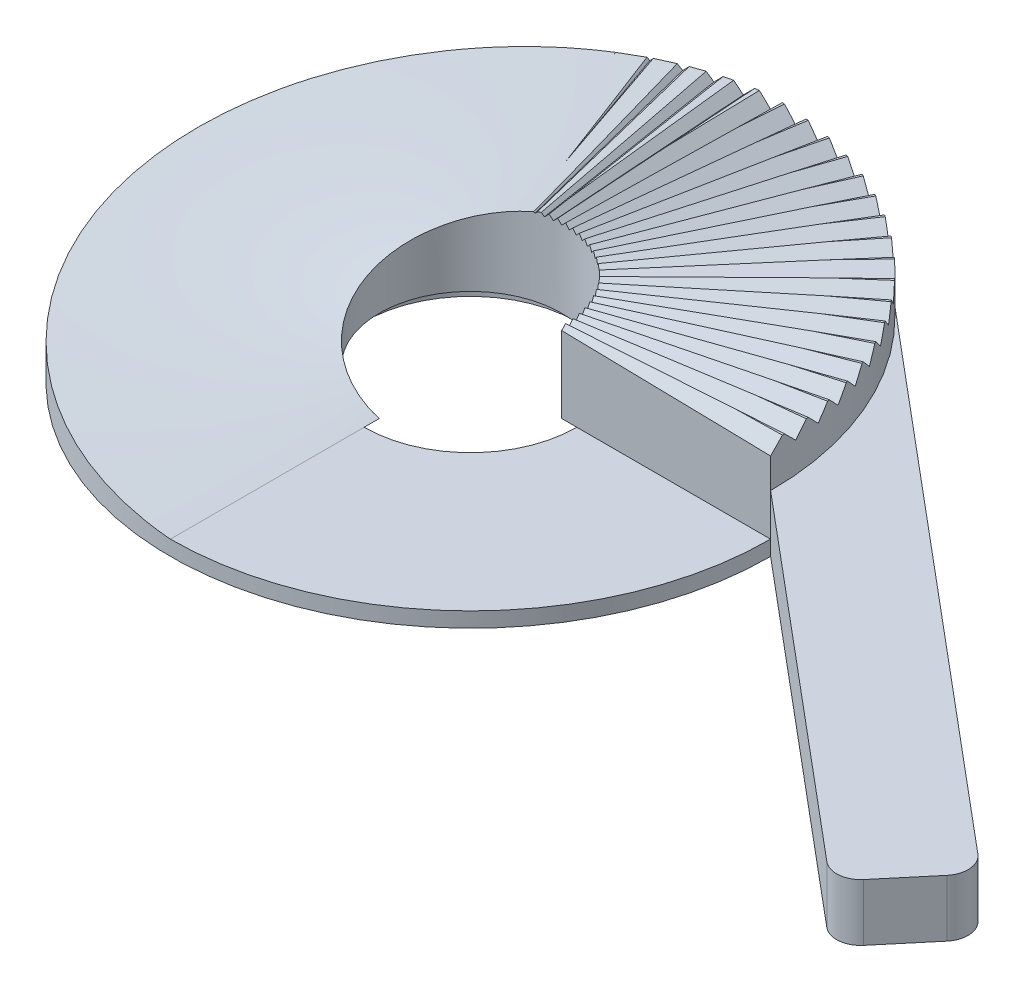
ISO-10303-21;
HEADER;
FILE_DESCRIPTION(('STEP AP214'),'2;1');
FILE_NAME('part.step','',(''),(''),'','','');
FILE_SCHEMA(('AUTOMOTIVE_DESIGN { 1 0 10303 214 1 1 1 1 }'));
ENDSEC;
DATA;
#1=APPLICATION_CONTEXT('core data for automotive mechanical design processes');
#2=APPLICATION_PROTOCOL_DEFINITION('international standard','automotive_design',2000,#1);
#3=PRODUCT_CONTEXT('',#1,'mechanical');
#4=PRODUCT('Part','Part','',(#3));
#5=PRODUCT_RELATED_PRODUCT_CATEGORY('part','',(#4));
#6=PRODUCT_DEFINITION_FORMATION('','',#4);
#7=PRODUCT_DEFINITION_CONTEXT('part definition',#1,'design');
#8=PRODUCT_DEFINITION('design','',#6,#7);
#9=PRODUCT_DEFINITION_SHAPE('','',#8);
#10=(LENGTH_UNIT() NAMED_UNIT(*) SI_UNIT(.MILLI.,.METRE.));
#11=(NAMED_UNIT(*) PLANE_ANGLE_UNIT() SI_UNIT($,.RADIAN.));
#12=(NAMED_UNIT(*) SI_UNIT($,.STERADIAN.) SOLID_ANGLE_UNIT());
#13=UNCERTAINTY_MEASURE_WITH_UNIT(LENGTH_MEASURE(1.E-05),#10,'distance_accuracy_value','');
#14=(GEOMETRIC_REPRESENTATION_CONTEXT(3) GLOBAL_UNCERTAINTY_ASSIGNED_CONTEXT((#13)) GLOBAL_UNIT_ASSIGNED_CONTEXT((#10,
#11,#12)) REPRESENTATION_CONTEXT('',''));
#15=CARTESIAN_POINT('',(0.,0.,0.));
#16=DIRECTION('',(0.,0.,1.));
#17=DIRECTION('',(1.,0.,0.));
#18=AXIS2_PLACEMENT_3D('',#15,#16,#17);
#19=CARTESIAN_POINT('',(31.75,13.97,0.));
#20=DIRECTION('',(0.642787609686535,0.,-0.766044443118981));
#21=DIRECTION('',(-0.766044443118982,0.,-0.642787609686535));
#22=AXIS2_PLACEMENT_3D('',#19,#20,#21);
#23=PLANE('',#22);
#24=DIRECTION('',(0.766044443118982,0.,0.642787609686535));
#25=VECTOR('',#24,1.);
#26=CARTESIAN_POINT('',(31.75,10.795,0.));
#27=LINE('',#26,#25);
#28=CARTESIAN_POINT('',(31.75,10.795,0.));
#29=VERTEX_POINT('',#28);
#30=CARTESIAN_POINT('',(68.7193048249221,10.795,31.0209300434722));
#31=VERTEX_POINT('',#30);
#32=EDGE_CURVE('E742',#29,#31,#27,.T.);
#33=ORIENTED_EDGE('',*,*,#32,.F.);
#34=DIRECTION('',(0.,1.,0.));
#35=VECTOR('',#34,1.);
#36=CARTESIAN_POINT('',(31.75,6.35,0.));
#37=LINE('',#36,#35);
#38=CARTESIAN_POINT('',(31.75,6.35,0.));
#39=VERTEX_POINT('',#38);
#40=EDGE_CURVE('E751',#39,#29,#37,.T.);
#41=ORIENTED_EDGE('',*,*,#40,.F.);
#42=DIRECTION('',(0.,-1.,0.));
#43=VECTOR('',#42,1.);
#44=CARTESIAN_POINT('',(31.75,13.97,0.));
#45=LINE('',#44,#43);
#46=CARTESIAN_POINT('',(31.75,4.7625,0.));
#47=VERTEX_POINT('',#46);
#48=EDGE_CURVE('E1899',#39,#47,#45,.T.);
#49=ORIENTED_EDGE('',*,*,#48,.T.);
#50=DIRECTION('',(-0.766044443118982,0.,-0.642787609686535));
#51=VECTOR('',#50,1.);
#52=CARTESIAN_POINT('',(31.75,4.7625,0.));
#53=LINE('',#52,#51);
#54=CARTESIAN_POINT('',(68.7193048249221,4.7625,31.0209300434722));
#55=VERTEX_POINT('',#54);
#56=EDGE_CURVE('E2146',#55,#47,#53,.T.);
#57=ORIENTED_EDGE('',*,*,#56,.F.);
#58=DIRECTION('',(0.,-1.,0.));
#59=VECTOR('',#58,1.);
#60=CARTESIAN_POINT('',(68.7193048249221,13.97,31.0209300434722));
#61=LINE('',#60,#59);
#62=EDGE_CURVE('E754',#55,#31,#61,.F.);
#63=ORIENTED_EDGE('',*,*,#62,.T.);
#64=EDGE_LOOP('',(#33,#41,#49,#57,#63));
#65=FACE_BOUND('',#64,.T.);
#66=ADVANCED_FACE('F235',(#65),#23,.F.);
#67=CARTESIAN_POINT('',(70.6650577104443,13.97,32.653610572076));
#68=DIRECTION('',(-0.766044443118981,0.,-0.642787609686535));
#69=DIRECTION('',(-0.642787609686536,0.,0.766044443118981));
#70=AXIS2_PLACEMENT_3D('',#67,#68,#69);
#71=PLANE('',#70);
#72=DIRECTION('',(0.642787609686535,0.,-0.766044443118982));
#73=VECTOR('',#72,1.);
#74=CARTESIAN_POINT('',(72.2977382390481,10.795,30.7078576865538));
#75=LINE('',#74,#73);
#76=CARTESIAN_POINT('',(72.2977382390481,10.795,30.7078576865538));
#77=VERTEX_POINT('',#76);
#78=CARTESIAN_POINT('',(76.3225486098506,10.795,25.9112754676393));
#79=VERTEX_POINT('',#78);
#80=EDGE_CURVE('E2778',#77,#79,#75,.T.);
#81=ORIENTED_EDGE('',*,*,#80,.F.);
#82=DIRECTION('',(0.,-1.,0.));
#83=VECTOR('',#82,1.);
#84=CARTESIAN_POINT('',(72.2977382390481,13.97,30.7078576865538));
#85=LINE('',#84,#83);
#86=CARTESIAN_POINT('',(72.2977382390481,4.7625,30.7078576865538));
#87=VERTEX_POINT('',#86);
#88=EDGE_CURVE('E1882',#77,#87,#85,.T.);
#89=ORIENTED_EDGE('',*,*,#88,.T.);
#90=DIRECTION('',(-0.642787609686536,0.,0.766044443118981));
#91=VECTOR('',#90,1.);
#92=CARTESIAN_POINT('',(70.6650577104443,4.7625,32.653610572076));
#93=LINE('',#92,#91);
#94=CARTESIAN_POINT('',(76.3225486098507,4.7625,25.9112754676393));
#95=VERTEX_POINT('',#94);
#96=EDGE_CURVE('E2131',#95,#87,#93,.T.);
#97=ORIENTED_EDGE('',*,*,#96,.F.);
#98=DIRECTION('',(0.,-1.,0.));
#99=VECTOR('',#98,1.);
#100=CARTESIAN_POINT('',(76.3225486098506,13.97,25.9112754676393));
#101=LINE('',#100,#99);
#102=EDGE_CURVE('E1879',#95,#79,#101,.F.);
#103=ORIENTED_EDGE('',*,*,#102,.T.);
#104=EDGE_LOOP('',(#81,#89,#97,#103));
#105=FACE_BOUND('',#104,.T.);
#106=ADVANCED_FACE('F1137',(#105),#71,.F.);
#107=CARTESIAN_POINT('',(77.9552291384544,13.97,23.9655225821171));
#108=DIRECTION('',(-0.642787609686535,0.,0.766044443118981));
#109=DIRECTION('',(0.766044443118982,0.,0.642787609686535));
#110=AXIS2_PLACEMENT_3D('',#107,#108,#109);
#111=PLANE('',#110);
#112=DIRECTION('',(-0.766044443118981,0.,-0.642787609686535));
#113=VECTOR('',#112,1.);
#114=CARTESIAN_POINT('',(76.0094762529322,10.795,22.3328420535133));
#115=LINE('',#114,#113);
#116=CARTESIAN_POINT('',(76.0094762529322,10.795,22.3328420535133));
#117=VERTEX_POINT('',#116);
#118=CARTESIAN_POINT('',(20.4085066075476,10.795,-24.3219110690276));
#119=VERTEX_POINT('',#118);
#120=EDGE_CURVE('E738',#117,#119,#115,.T.);
#121=ORIENTED_EDGE('',*,*,#120,.F.);
#122=DIRECTION('',(0.,-1.,0.));
#123=VECTOR('',#122,1.);
#124=CARTESIAN_POINT('',(76.0094762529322,13.97,22.3328420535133));
#125=LINE('',#124,#123);
#126=CARTESIAN_POINT('',(76.0094762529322,4.7625,22.3328420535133));
#127=VERTEX_POINT('',#126);
#128=EDGE_CURVE('E245',#117,#127,#125,.T.);
#129=ORIENTED_EDGE('',*,*,#128,.T.);
#130=DIRECTION('',(0.766044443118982,0.,0.642787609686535));
#131=VECTOR('',#130,1.);
#132=CARTESIAN_POINT('',(77.9552291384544,4.7625,23.9655225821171));
#133=LINE('',#132,#131);
#134=CARTESIAN_POINT('',(20.4085066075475,4.7625,-24.3219110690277));
#135=VERTEX_POINT('',#134);
#136=EDGE_CURVE('E2128',#135,#127,#133,.T.);
#137=ORIENTED_EDGE('',*,*,#136,.F.);
#138=DIRECTION('',(0.,-1.,0.));
#139=VECTOR('',#138,1.);
#140=CARTESIAN_POINT('',(20.4085066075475,13.97,-24.3219110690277));
#141=LINE('',#140,#139);
#142=EDGE_CURVE('E1897',#119,#135,#141,.T.);
#143=ORIENTED_EDGE('',*,*,#142,.F.);
#144=EDGE_LOOP('',(#121,#129,#137,#143));
#145=FACE_BOUND('',#144,.T.);
#146=ADVANCED_FACE('F1133',(#145),#111,.F.);
#147=CARTESIAN_POINT('',(70.3519853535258,13.97,29.07517715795));
#148=DIRECTION('',(0.,-1.,0.));
#149=DIRECTION('',(0.,0.,-1.));
#150=AXIS2_PLACEMENT_3D('',#147,#148,#149);
#151=CYLINDRICAL_SURFACE('',#150,2.54);
#152=ORIENTED_EDGE('',*,*,#88,.F.);
#153=CARTESIAN_POINT('',(70.3519853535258,10.795,29.07517715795));
#154=DIRECTION('',(0.,1.,0.));
#155=DIRECTION('',(0.,0.,1.));
#156=AXIS2_PLACEMENT_3D('',#153,#154,#155);
#157=CIRCLE('',#156,2.54);
#158=EDGE_CURVE('E756',#31,#77,#157,.T.);
#159=ORIENTED_EDGE('',*,*,#158,.F.);
#160=ORIENTED_EDGE('',*,*,#62,.F.);
#161=CARTESIAN_POINT('',(70.3519853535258,4.7625,29.07517715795));
#162=DIRECTION('',(0.,-1.,0.));
#163=DIRECTION('',(0.,0.,-1.));
#164=AXIS2_PLACEMENT_3D('',#161,#162,#163);
#165=CIRCLE('',#164,2.54);
#166=EDGE_CURVE('E2142',#55,#87,#165,.F.);
#167=ORIENTED_EDGE('',*,*,#166,.T.);
#168=EDGE_LOOP('',(#152,#159,#160,#167));
#169=FACE_BOUND('',#168,.T.);
#170=ADVANCED_FACE('F1136',(#169),#151,.T.);
#171=CARTESIAN_POINT('',(74.3767957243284,13.97,24.2785949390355));
#172=DIRECTION('',(0.,-1.,0.));
#173=DIRECTION('',(0.,0.,-1.));
#174=AXIS2_PLACEMENT_3D('',#171,#172,#173);
#175=CYLINDRICAL_SURFACE('',#174,2.54);
#176=ORIENTED_EDGE('',*,*,#128,.F.);
#177=CARTESIAN_POINT('',(74.3767957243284,10.795,24.2785949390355));
#178=DIRECTION('',(0.,1.,0.));
#179=DIRECTION('',(0.,0.,1.));
#180=AXIS2_PLACEMENT_3D('',#177,#178,#179);
#181=CIRCLE('',#180,2.53999999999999);
#182=EDGE_CURVE('E2781',#79,#117,#181,.T.);
#183=ORIENTED_EDGE('',*,*,#182,.F.);
#184=ORIENTED_EDGE('',*,*,#102,.F.);
#185=CARTESIAN_POINT('',(74.3767957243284,4.7625,24.2785949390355));
#186=DIRECTION('',(0.,-1.,0.));
#187=DIRECTION('',(0.,0.,-1.));
#188=AXIS2_PLACEMENT_3D('',#185,#186,#187);
#189=CIRCLE('',#188,2.54);
#190=EDGE_CURVE('E13',#95,#127,#189,.F.);
#191=ORIENTED_EDGE('',*,*,#190,.T.);
#192=EDGE_LOOP('',(#176,#183,#184,#191));
#193=FACE_BOUND('',#192,.T.);
#194=ADVANCED_FACE('F237',(#193),#175,.T.);
#195=CARTESIAN_POINT('',(0.,-1.17126974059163,0.));
#196=DIRECTION('',(0.,-1.,0.));
#197=DIRECTION('',(0.,0.,-1.));
#198=AXIS2_PLACEMENT_3D('',#195,#196,#197);
#199=CYLINDRICAL_SURFACE('',#198,9.652);
#200=CARTESIAN_POINT('',(0.,6.35,0.));
#201=DIRECTION('',(0.,-1.,0.));
#202=DIRECTION('',(0.,0.,-1.));
#203=AXIS2_PLACEMENT_3D('',#200,#201,#202);
#204=CIRCLE('',#203,9.652);
#205=CARTESIAN_POINT('',(9.652,6.35,0.));
#206=VERTEX_POINT('',#205);
#207=CARTESIAN_POINT('',(0.,6.35,9.652));
#208=VERTEX_POINT('',#207);
#209=EDGE_CURVE('E1156',#206,#208,#204,.F.);
#210=ORIENTED_EDGE('',*,*,#209,.F.);
#211=DIRECTION('',(0.,-1.,0.));
#212=VECTOR('',#211,1.);
#213=CARTESIAN_POINT('',(9.652,-1.17126974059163,0.));
#214=LINE('',#213,#212);
#215=CARTESIAN_POINT('',(9.652,14.41196,0.));
#216=VERTEX_POINT('',#215);
#217=EDGE_CURVE('E1762',#206,#216,#214,.F.);
#218=ORIENTED_EDGE('',*,*,#217,.T.);
#219=CARTESIAN_POINT('',(0.,14.605,0.));
#220=DIRECTION('',(0.0141407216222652,0.707036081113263,0.707036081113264));
#221=DIRECTION('',(0.0141378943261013,-0.707177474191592,0.706894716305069));
#222=AXIS2_PLACEMENT_3D('',#219,#220,#221);
#223=ELLIPSE('',#222,13.6513542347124,9.652);
#224=CARTESIAN_POINT('',(9.64281343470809,14.8331580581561,-0.421014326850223));
#225=VERTEX_POINT('',#224);
#226=EDGE_CURVE('E2103',#216,#225,#223,.T.);
#227=ORIENTED_EDGE('',*,*,#226,.T.);
#228=CARTESIAN_POINT('',(0.,14.605,0.));
#229=DIRECTION('',(-0.047535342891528,0.707036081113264,-0.705578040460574));
#230=DIRECTION('',(-0.0475258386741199,-0.707177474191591,-0.705436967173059));
#231=AXIS2_PLACEMENT_3D('',#228,#229,#230);
#232=ELLIPSE('',#231,13.6513542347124,9.652);
#233=CARTESIAN_POINT('',(9.61527122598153,14.41196,-0.841227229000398));
#234=VERTEX_POINT('',#233);
#235=EDGE_CURVE('E1749',#234,#225,#232,.F.);
#236=ORIENTED_EDGE('',*,*,#235,.F.);
#237=CARTESIAN_POINT('',(0.,14.605,0.));
#238=DIRECTION('',(0.075709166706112,0.707036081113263,0.703113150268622));
#239=DIRECTION('',(0.075694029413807,-0.707177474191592,0.702972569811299));
#240=AXIS2_PLACEMENT_3D('',#237,#238,#239);
#241=ELLIPSE('',#240,13.6513542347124,9.652);
#242=CARTESIAN_POINT('',(9.56942580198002,14.8331580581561,-1.25983880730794));
#243=VERTEX_POINT('',#242);
#244=EDGE_CURVE('E1736',#243,#234,#241,.F.);
#245=ORIENTED_EDGE('',*,*,#244,.F.);
#246=CARTESIAN_POINT('',(0.,14.605,0.));
#247=DIRECTION('',(-0.108849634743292,0.707036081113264,-0.698750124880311));
#248=DIRECTION('',(-0.108827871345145,-0.707177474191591,-0.698610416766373));
#249=AXIS2_PLACEMENT_3D('',#246,#247,#248);
#250=ELLIPSE('',#249,13.6513542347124,9.652);
#251=CARTESIAN_POINT('',(9.50536443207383,14.41196,-1.67605221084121));
#252=VERTEX_POINT('',#251);
#253=EDGE_CURVE('E1712',#252,#243,#250,.F.);
#254=ORIENTED_EDGE('',*,*,#253,.F.);
#255=CARTESIAN_POINT('',(0.,14.605,0.));
#256=DIRECTION('',(0.136701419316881,0.707036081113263,0.693839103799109));
#257=DIRECTION('',(0.136674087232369,-0.707177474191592,0.693700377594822));
#258=AXIS2_PLACEMENT_3D('',#255,#256,#257);
#259=ELLIPSE('',#258,13.6513542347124,9.652);
#260=CARTESIAN_POINT('',(9.42320906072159,14.8331580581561,-2.08907515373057));
#261=VERTEX_POINT('',#260);
#262=EDGE_CURVE('E1719',#261,#252,#259,.F.);
#263=ORIENTED_EDGE('',*,*,#262,.F.);
#264=CARTESIAN_POINT('',(0.,14.605,0.));
#265=DIRECTION('',(-0.169335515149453,0.707036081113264,-0.686604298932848));
#266=DIRECTION('',(-0.169301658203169,-0.707177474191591,-0.686467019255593));
#267=AXIS2_PLACEMENT_3D('',#264,#265,#266);
#268=ELLIPSE('',#267,13.6513542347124,9.652);
#269=CARTESIAN_POINT('',(9.32311607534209,14.41196,-2.49812142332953));
#270=VERTEX_POINT('',#269);
#271=EDGE_CURVE('E1683',#270,#261,#268,.F.);
#272=ORIENTED_EDGE('',*,*,#271,.F.);
#273=CARTESIAN_POINT('',(0.,14.605,0.));
#274=DIRECTION('',(0.196653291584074,0.707036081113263,0.679284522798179));
#275=DIRECTION('',(0.196613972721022,-0.707177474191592,0.679148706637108));
#276=AXIS2_PLACEMENT_3D('',#273,#274,#275);
#277=ELLIPSE('',#276,13.6513542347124,9.652);
#278=CARTESIAN_POINT('',(9.20527600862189,14.8331580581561,-2.90241237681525));
#279=VERTEX_POINT('',#278);
#280=EDGE_CURVE('E1690',#279,#270,#277,.F.);
#281=ORIENTED_EDGE('',*,*,#280,.F.);
#282=CARTESIAN_POINT('',(0.,14.605,0.));
#283=DIRECTION('',(-0.228532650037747,0.707036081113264,-0.669232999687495));
#284=DIRECTION('',(-0.22848695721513,-0.707177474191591,-0.669099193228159));
#285=AXIS2_PLACEMENT_3D('',#282,#283,#284);
#286=ELLIPSE('',#285,13.6513542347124,9.652);
#287=CARTESIAN_POINT('',(9.06991317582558,14.41196,-3.30117842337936));
#288=VERTEX_POINT('',#287);
#289=EDGE_CURVE('E1654',#288,#279,#286,.F.);
#290=ORIENTED_EDGE('',*,*,#289,.F.);
#291=CARTESIAN_POINT('',(0.,14.605,0.));
#292=DIRECTION('',(0.255108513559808,0.707036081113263,0.659560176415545));
#293=DIRECTION('',(0.255057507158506,-0.707177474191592,0.659428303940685));
#294=AXIS2_PLACEMENT_3D('',#291,#292,#293);
#295=ELLIPSE('',#294,13.6513542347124,9.652);
#296=CARTESIAN_POINT('',(8.91728524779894,14.8331580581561,-3.69366048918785));
#297=VERTEX_POINT('',#296);
#298=EDGE_CURVE('E1661',#297,#288,#295,.F.);
#299=ORIENTED_EDGE('',*,*,#298,.F.);
#300=CARTESIAN_POINT('',(0.,14.605,0.));
#301=DIRECTION('',(-0.285990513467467,0.707036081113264,-0.646768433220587));
#302=DIRECTION('',(-0.285933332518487,-0.707177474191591,-0.646639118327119));
#303=AXIS2_PLACEMENT_3D('',#300,#301,#302);
#304=ELLIPSE('',#303,13.6513542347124,9.652);
#305=CARTESIAN_POINT('',(8.74768276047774,14.41196,-4.07911146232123));
#306=VERTEX_POINT('',#305);
#307=EDGE_CURVE('E1625',#306,#297,#304,.F.);
#308=ORIENTED_EDGE('',*,*,#307,.F.);
#309=CARTESIAN_POINT('',(0.,14.605,0.));
#310=DIRECTION('',(0.311622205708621,0.707036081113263,0.634816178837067));
#311=DIRECTION('',(0.31155989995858,-0.707177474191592,0.634689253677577));
#312=AXIS2_PLACEMENT_3D('',#309,#310,#311);
#313=ELLIPSE('',#312,13.6513542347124,9.652);
#314=CARTESIAN_POINT('',(8.56142856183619,14.8331580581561,-4.45679761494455));
#315=VERTEX_POINT('',#314);
#316=EDGE_CURVE('E1632',#315,#306,#313,.F.);
#317=ORIENTED_EDGE('',*,*,#316,.F.);
#318=CARTESIAN_POINT('',(0.,14.605,0.));
#319=DIRECTION('',(-0.341271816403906,0.707036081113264,-0.619381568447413));
#320=DIRECTION('',(-0.341203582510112,-0.707177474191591,-0.619257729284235));
#321=AXIS2_PLACEMENT_3D('',#318,#319,#320);
#322=ELLIPSE('',#321,13.6513542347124,9.652);
#323=CARTESIAN_POINT('',(8.3588771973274,14.41196,-4.826));
#324=VERTEX_POINT('',#323);
#325=EDGE_CURVE('E1596',#324,#315,#322,.F.);
#326=ORIENTED_EDGE('',*,*,#325,.F.);
#327=CARTESIAN_POINT('',(0.,14.605,0.));
#328=DIRECTION('',(0.365764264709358,0.707036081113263,0.605240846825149));
#329=DIRECTION('',(0.365691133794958,-0.707177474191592,0.605119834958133));
#330=AXIS2_PLACEMENT_3D('',#327,#328,#329);
#331=ELLIPSE('',#330,13.6513542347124,9.652);
#332=CARTESIAN_POINT('',(8.14041423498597,14.8331580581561,-5.18601581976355));
#333=VERTEX_POINT('',#332);
#334=EDGE_CURVE('E1603',#333,#324,#331,.F.);
#335=ORIENTED_EDGE('',*,*,#334,.F.);
#336=CARTESIAN_POINT('',(0.,14.605,0.));
#337=DIRECTION('',(-0.393955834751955,0.707036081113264,-0.587280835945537));
#338=DIRECTION('',(-0.393877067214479,-0.707177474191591,-0.587163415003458));
#339=AXIS2_PLACEMENT_3D('',#336,#337,#338);
#340=ELLIPSE('',#339,13.6513542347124,9.652);
#341=CARTESIAN_POINT('',(7.90645553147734,14.41196,-5.5361597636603));
#342=VERTEX_POINT('',#341);
#343=EDGE_CURVE('E1567',#342,#333,#340,.F.);
#344=ORIENTED_EDGE('',*,*,#343,.F.);
#345=CARTESIAN_POINT('',(0.,14.605,0.));
#346=DIRECTION('',(0.417122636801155,0.707036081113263,0.571059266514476));
#347=DIRECTION('',(0.417039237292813,-0.707177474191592,0.570945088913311));
#348=AXIS2_PLACEMENT_3D('',#345,#346,#347);
#349=ELLIPSE('',#348,13.6513542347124,9.652);
#350=CARTESIAN_POINT('',(7.657446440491,14.8331580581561,-5.87576531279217));
#351=VERTEX_POINT('',#350);
#352=EDGE_CURVE('E1574',#351,#342,#349,.F.);
#353=ORIENTED_EDGE('',*,*,#352,.F.);
#354=CARTESIAN_POINT('',(0.,14.605,0.));
#355=DIRECTION('',(-0.443641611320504,0.707036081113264,-0.550710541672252));
#356=DIRECTION('',(-0.443552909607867,-0.707177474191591,-0.550600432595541));
#357=AXIS2_PLACEMENT_3D('',#354,#355,#356);
#358=ELLIPSE('',#357,13.6513542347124,9.652);
#359=CARTESIAN_POINT('',(7.39386096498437,14.41196,-6.20418600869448));
#360=VERTEX_POINT('',#359);
#361=EDGE_CURVE('E1538',#360,#351,#358,.F.);
#362=ORIENTED_EDGE('',*,*,#361,.F.);
#363=CARTESIAN_POINT('',(0.,14.605,0.));
#364=DIRECTION('',(0.465306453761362,0.707036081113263,0.532531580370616));
#365=DIRECTION('',(0.465213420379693,-0.707177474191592,0.532425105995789));
#366=AXIS2_PLACEMENT_3D('',#363,#364,#365);
#367=ELLIPSE('',#366,13.6513542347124,9.652);
#368=CARTESIAN_POINT('',(7.11620085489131,14.8331580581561,-6.52079668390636));
#369=VERTEX_POINT('',#368);
#370=EDGE_CURVE('E1545',#369,#360,#367,.F.);
#371=ORIENTED_EDGE('',*,*,#370,.F.);
#372=CARTESIAN_POINT('',(0.,14.605,0.));
#373=DIRECTION('',(-0.489951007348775,0.707036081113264,-0.509949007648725));
#374=DIRECTION('',(-0.489853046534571,-0.707177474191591,-0.509847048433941));
#375=AXIS2_PLACEMENT_3D('',#372,#373,#374);
#376=ELLIPSE('',#375,13.6513542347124,9.652);
#377=CARTESIAN_POINT('',(6.82499465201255,14.41196,-6.82499465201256));
#378=VERTEX_POINT('',#377);
#379=EDGE_CURVE('E1509',#378,#369,#376,.F.);
#380=ORIENTED_EDGE('',*,*,#379,.F.);
#381=CARTESIAN_POINT('',(0.,14.605,0.));
#382=DIRECTION('',(0.509949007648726,0.707036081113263,0.489951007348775));
#383=DIRECTION('',(0.50984704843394,-0.707177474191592,0.489853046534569));
#384=AXIS2_PLACEMENT_3D('',#381,#382,#383);
#385=ELLIPSE('',#384,13.6513542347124,9.652);
#386=CARTESIAN_POINT('',(6.52079668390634,14.8331580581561,-7.11620085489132));
#387=VERTEX_POINT('',#386);
#388=EDGE_CURVE('E1516',#387,#378,#385,.F.);
#389=ORIENTED_EDGE('',*,*,#388,.F.);
#390=CARTESIAN_POINT('',(0.,14.605,0.));
#391=DIRECTION('',(-0.532531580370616,0.707036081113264,-0.46530645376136));
#392=DIRECTION('',(-0.53242510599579,-0.707177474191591,-0.465213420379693));
#393=AXIS2_PLACEMENT_3D('',#390,#391,#392);
#394=ELLIPSE('',#393,13.6513542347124,9.652);
#395=CARTESIAN_POINT('',(6.20418600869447,14.41196,-7.39386096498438));
#396=VERTEX_POINT('',#395);
#397=EDGE_CURVE('E1480',#396,#387,#394,.F.);
#398=ORIENTED_EDGE('',*,*,#397,.F.);
#399=CARTESIAN_POINT('',(0.,14.605,0.));
#400=DIRECTION('',(0.550710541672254,0.707036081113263,0.443641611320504));
#401=DIRECTION('',(0.550600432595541,-0.707177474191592,0.443552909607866));
#402=AXIS2_PLACEMENT_3D('',#399,#400,#401);
#403=ELLIPSE('',#402,13.6513542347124,9.652);
#404=CARTESIAN_POINT('',(5.87576531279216,14.8331580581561,-7.65744644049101));
#405=VERTEX_POINT('',#404);
#406=EDGE_CURVE('E1487',#405,#396,#403,.F.);
#407=ORIENTED_EDGE('',*,*,#406,.F.);
#408=CARTESIAN_POINT('',(0.,14.605,0.));
#409=DIRECTION('',(-0.571059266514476,0.707036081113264,-0.417122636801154));
#410=DIRECTION('',(-0.570945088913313,-0.707177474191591,-0.417039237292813));
#411=AXIS2_PLACEMENT_3D('',#408,#409,#410);
#412=ELLIPSE('',#411,13.6513542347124,9.652);
#413=CARTESIAN_POINT('',(5.53615976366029,14.41196,-7.90645553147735));
#414=VERTEX_POINT('',#413);
#415=EDGE_CURVE('E1451',#414,#405,#412,.F.);
#416=ORIENTED_EDGE('',*,*,#415,.F.);
#417=CARTESIAN_POINT('',(0.,14.605,0.));
#418=DIRECTION('',(0.587280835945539,0.707036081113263,0.393955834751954));
#419=DIRECTION('',(0.587163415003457,-0.707177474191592,0.393877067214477));
#420=AXIS2_PLACEMENT_3D('',#417,#418,#419);
#421=ELLIPSE('',#420,13.6513542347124,9.652);
#422=CARTESIAN_POINT('',(5.18601581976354,14.8331580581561,-8.14041423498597));
#423=VERTEX_POINT('',#422);
#424=EDGE_CURVE('E1458',#423,#414,#421,.F.);
#425=ORIENTED_EDGE('',*,*,#424,.F.);
#426=CARTESIAN_POINT('',(0.,14.605,0.));
#427=DIRECTION('',(-0.605240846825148,0.707036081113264,-0.365764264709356));
#428=DIRECTION('',(-0.605119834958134,-0.707177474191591,-0.365691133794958));
#429=AXIS2_PLACEMENT_3D('',#426,#427,#428);
#430=ELLIPSE('',#429,13.6513542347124,9.652);
#431=CARTESIAN_POINT('',(4.82599999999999,14.41196,-8.35887719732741));
#432=VERTEX_POINT('',#431);
#433=EDGE_CURVE('E1422',#432,#423,#430,.F.);
#434=ORIENTED_EDGE('',*,*,#433,.F.);
#435=CARTESIAN_POINT('',(0.,14.605,0.));
#436=DIRECTION('',(0.619381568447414,0.707036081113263,0.341271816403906));
#437=DIRECTION('',(0.619257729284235,-0.707177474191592,0.34120358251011));
#438=AXIS2_PLACEMENT_3D('',#435,#436,#437);
#439=ELLIPSE('',#438,13.6513542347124,9.652);
#440=CARTESIAN_POINT('',(4.45679761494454,14.8331580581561,-8.5614285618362));
#441=VERTEX_POINT('',#440);
#442=EDGE_CURVE('E1429',#441,#432,#439,.F.);
#443=ORIENTED_EDGE('',*,*,#442,.F.);
#444=CARTESIAN_POINT('',(0.,14.605,0.));
#445=DIRECTION('',(-0.634816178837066,0.707036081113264,-0.311622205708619));
#446=DIRECTION('',(-0.634689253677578,-0.707177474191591,-0.31155989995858));
#447=AXIS2_PLACEMENT_3D('',#444,#445,#446);
#448=ELLIPSE('',#447,13.6513542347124,9.652);
#449=CARTESIAN_POINT('',(4.07911146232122,14.41196,-8.74768276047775));
#450=VERTEX_POINT('',#449);
#451=EDGE_CURVE('E1393',#450,#441,#448,.F.);
#452=ORIENTED_EDGE('',*,*,#451,.F.);
#453=CARTESIAN_POINT('',(0.,14.605,0.));
#454=DIRECTION('',(0.646768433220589,0.707036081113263,0.285990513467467));
#455=DIRECTION('',(0.646639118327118,-0.707177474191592,0.285933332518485));
#456=AXIS2_PLACEMENT_3D('',#453,#454,#455);
#457=ELLIPSE('',#456,13.6513542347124,9.652);
#458=CARTESIAN_POINT('',(3.69366048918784,14.8331580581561,-8.91728524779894));
#459=VERTEX_POINT('',#458);
#460=EDGE_CURVE('E1400',#459,#450,#457,.F.);
#461=ORIENTED_EDGE('',*,*,#460,.F.);
#462=CARTESIAN_POINT('',(0.,14.605,0.));
#463=DIRECTION('',(-0.659560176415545,0.707036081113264,-0.255108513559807));
#464=DIRECTION('',(-0.659428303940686,-0.707177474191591,-0.255057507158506));
#465=AXIS2_PLACEMENT_3D('',#462,#463,#464);
#466=ELLIPSE('',#465,13.6513542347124,9.652);
#467=CARTESIAN_POINT('',(3.30117842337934,14.41196,-9.06991317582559));
#468=VERTEX_POINT('',#467);
#469=EDGE_CURVE('E1364',#468,#459,#466,.F.);
#470=ORIENTED_EDGE('',*,*,#469,.F.);
#471=CARTESIAN_POINT('',(0.,14.605,0.));
#472=DIRECTION('',(0.669232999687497,0.707036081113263,0.228532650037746));
#473=DIRECTION('',(0.669099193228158,-0.707177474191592,0.228486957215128));
#474=AXIS2_PLACEMENT_3D('',#471,#472,#473);
#475=ELLIPSE('',#474,13.6513542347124,9.652);
#476=CARTESIAN_POINT('',(2.90241237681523,14.8331580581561,-9.20527600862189));
#477=VERTEX_POINT('',#476);
#478=EDGE_CURVE('E1371',#477,#468,#475,.F.);
#479=ORIENTED_EDGE('',*,*,#478,.F.);
#480=CARTESIAN_POINT('',(0.,14.605,0.));
#481=DIRECTION('',(-0.679284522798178,0.707036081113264,-0.196653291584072));
#482=DIRECTION('',(-0.67914870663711,-0.707177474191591,-0.196613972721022));
#483=AXIS2_PLACEMENT_3D('',#480,#481,#482);
#484=ELLIPSE('',#483,13.6513542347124,9.652);
#485=CARTESIAN_POINT('',(2.49812142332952,14.41196,-9.32311607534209));
#486=VERTEX_POINT('',#485);
#487=EDGE_CURVE('E1335',#486,#477,#484,.F.);
#488=ORIENTED_EDGE('',*,*,#487,.F.);
#489=CARTESIAN_POINT('',(0.,14.605,0.));
#490=DIRECTION('',(0.686604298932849,0.707036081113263,0.169335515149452));
#491=DIRECTION('',(0.686467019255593,-0.707177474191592,0.169301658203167));
#492=AXIS2_PLACEMENT_3D('',#489,#490,#491);
#493=ELLIPSE('',#492,13.6513542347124,9.652);
#494=CARTESIAN_POINT('',(2.08907515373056,14.8331580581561,-9.4232090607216));
#495=VERTEX_POINT('',#494);
#496=EDGE_CURVE('E1342',#495,#486,#493,.F.);
#497=ORIENTED_EDGE('',*,*,#496,.F.);
#498=CARTESIAN_POINT('',(0.,14.605,0.));
#499=DIRECTION('',(-0.693839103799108,0.707036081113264,-0.136701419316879));
#500=DIRECTION('',(-0.693700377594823,-0.707177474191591,-0.136674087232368));
#501=AXIS2_PLACEMENT_3D('',#498,#499,#500);
#502=ELLIPSE('',#501,13.6513542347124,9.652);
#503=CARTESIAN_POINT('',(1.6760522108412,14.41196,-9.50536443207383));
#504=VERTEX_POINT('',#503);
#505=EDGE_CURVE('E1306',#504,#495,#502,.F.);
#506=ORIENTED_EDGE('',*,*,#505,.F.);
#507=CARTESIAN_POINT('',(0.,14.605,0.));
#508=DIRECTION('',(0.698750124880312,0.707036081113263,0.108849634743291));
#509=DIRECTION('',(0.698610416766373,-0.707177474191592,0.108827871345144));
#510=AXIS2_PLACEMENT_3D('',#507,#508,#509);
#511=ELLIPSE('',#510,13.6513542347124,9.652);
#512=CARTESIAN_POINT('',(1.25983880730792,14.8331580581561,-9.56942580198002));
#513=VERTEX_POINT('',#512);
#514=EDGE_CURVE('E1313',#513,#504,#511,.F.);
#515=ORIENTED_EDGE('',*,*,#514,.F.);
#516=CARTESIAN_POINT('',(0.,14.605,0.));
#517=DIRECTION('',(-0.703113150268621,0.707036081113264,-0.0757091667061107));
#518=DIRECTION('',(-0.7029725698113,-0.707177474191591,-0.075694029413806));
#519=AXIS2_PLACEMENT_3D('',#516,#517,#518);
#520=ELLIPSE('',#519,13.6513542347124,9.652);
#521=CARTESIAN_POINT('',(0.841227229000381,14.41196,-9.61527122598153));
#522=VERTEX_POINT('',#521);
#523=EDGE_CURVE('E1277',#522,#513,#520,.F.);
#524=ORIENTED_EDGE('',*,*,#523,.F.);
#525=CARTESIAN_POINT('',(0.,14.605,0.));
#526=DIRECTION('',(0.705578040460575,0.707036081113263,0.0475353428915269));
#527=DIRECTION('',(0.705436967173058,-0.707177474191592,0.0475258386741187));
#528=AXIS2_PLACEMENT_3D('',#525,#526,#527);
#529=ELLIPSE('',#528,13.6513542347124,9.652);
#530=CARTESIAN_POINT('',(0.421014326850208,14.8331580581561,-9.64281343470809));
#531=VERTEX_POINT('',#530);
#532=EDGE_CURVE('E1284',#531,#522,#529,.F.);
#533=ORIENTED_EDGE('',*,*,#532,.F.);
#534=CARTESIAN_POINT('',(0.,14.605,0.));
#535=DIRECTION('',(-0.707036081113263,0.707036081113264,-0.0141407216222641));
#536=DIRECTION('',(-0.70689471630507,-0.707177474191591,-0.0141378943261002));
#537=AXIS2_PLACEMENT_3D('',#534,#535,#536);
#538=ELLIPSE('',#537,13.6513542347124,9.652);
#539=CARTESIAN_POINT('',(0.,14.41196,-9.652));
#540=VERTEX_POINT('',#539);
#541=EDGE_CURVE('E1249',#540,#531,#538,.F.);
#542=ORIENTED_EDGE('',*,*,#541,.F.);
#543=CARTESIAN_POINT('',(0.,14.605,0.));
#544=DIRECTION('',(0.707036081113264,0.707036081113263,-0.0141407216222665));
#545=DIRECTION('',(0.706894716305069,-0.707177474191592,-0.0141378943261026));
#546=AXIS2_PLACEMENT_3D('',#543,#544,#545);
#547=ELLIPSE('',#546,13.6513542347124,9.652);
#548=CARTESIAN_POINT('',(-0.421014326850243,14.8331580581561,-9.64281343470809));
#549=VERTEX_POINT('',#548);
#550=EDGE_CURVE('E1255',#549,#540,#547,.F.);
#551=ORIENTED_EDGE('',*,*,#550,.F.);
#552=CARTESIAN_POINT('',(0.,14.605,0.));
#553=DIRECTION('',(-0.705578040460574,0.707036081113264,0.0475353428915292));
#554=DIRECTION('',(-0.705436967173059,-0.707177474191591,0.0475258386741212));
#555=AXIS2_PLACEMENT_3D('',#552,#553,#554);
#556=ELLIPSE('',#555,13.6513542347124,9.652);
#557=CARTESIAN_POINT('',(-0.841227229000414,14.41196,-9.61527122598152));
#558=VERTEX_POINT('',#557);
#559=EDGE_CURVE('E1221',#558,#549,#556,.F.);
#560=ORIENTED_EDGE('',*,*,#559,.F.);
#561=CARTESIAN_POINT('',(0.,14.605,0.));
#562=DIRECTION('',(0.703113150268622,0.707036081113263,-0.0757091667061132));
#563=DIRECTION('',(0.702972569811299,-0.707177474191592,-0.0756940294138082));
#564=AXIS2_PLACEMENT_3D('',#561,#562,#563);
#565=ELLIPSE('',#564,13.6513542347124,9.652);
#566=CARTESIAN_POINT('',(-1.25983880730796,14.8331580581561,-9.56942580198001));
#567=VERTEX_POINT('',#566);
#568=EDGE_CURVE('E1228',#567,#558,#565,.F.);
#569=ORIENTED_EDGE('',*,*,#568,.F.);
#570=CARTESIAN_POINT('',(0.,14.605,0.));
#571=DIRECTION('',(-0.698750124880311,0.707036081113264,0.108849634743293));
#572=DIRECTION('',(-0.698610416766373,-0.707177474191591,0.108827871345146));
#573=AXIS2_PLACEMENT_3D('',#570,#571,#572);
#574=ELLIPSE('',#573,13.6513542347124,9.652);
#575=CARTESIAN_POINT('',(-1.67605221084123,14.41196,-9.50536443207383));
#576=VERTEX_POINT('',#575);
#577=EDGE_CURVE('E1202',#576,#567,#574,.F.);
#578=ORIENTED_EDGE('',*,*,#577,.F.);
#579=CARTESIAN_POINT('',(0.,14.605,0.));
#580=DIRECTION('',(0.693839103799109,0.707036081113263,-0.136701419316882));
#581=DIRECTION('',(0.693700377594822,-0.707177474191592,-0.13667408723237));
#582=AXIS2_PLACEMENT_3D('',#579,#580,#581);
#583=ELLIPSE('',#582,13.6513542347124,9.652);
#584=CARTESIAN_POINT('',(-1.96538297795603,14.7066369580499,-9.44978167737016));
#585=VERTEX_POINT('',#584);
#586=EDGE_CURVE('E1201',#585,#576,#583,.F.);
#587=ORIENTED_EDGE('',*,*,#586,.F.);
#588=CARTESIAN_POINT('',(0.,15.24,-9.652));
#589=CARTESIAN_POINT('',(-0.281762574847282,15.1645307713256,-9.65203377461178));
#590=CARTESIAN_POINT('',(-0.56346962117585,15.0888791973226,-9.63966358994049));
#591=CARTESIAN_POINT('',(-1.12461220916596,14.9372151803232,-9.59038570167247));
#592=CARTESIAN_POINT('',(-1.40404790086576,14.8612027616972,-9.55347963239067));
#593=CARTESIAN_POINT('',(-1.95827977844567,14.708878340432,-9.45544376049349));
#594=CARTESIAN_POINT('',(-2.23307985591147,14.6325666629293,-9.39433545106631));
#595=CARTESIAN_POINT('',(-2.77619274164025,14.4795515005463,-9.2484005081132));
#596=CARTESIAN_POINT('',(-3.04450561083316,14.4028480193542,-9.16357409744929));
#597=CARTESIAN_POINT('',(-3.57271434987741,14.2489868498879,-8.97083562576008));
#598=CARTESIAN_POINT('',(-3.83260652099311,14.1718289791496,-8.86291357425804));
#599=CARTESIAN_POINT('',(-4.34187574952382,14.0170720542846,-8.62486088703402));
#600=CARTESIAN_POINT('',(-4.5912527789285,13.9394729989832,-8.49473019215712));
#601=CARTESIAN_POINT('',(-5.07756199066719,13.7838550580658,-8.21330490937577));
#602=CARTESIAN_POINT('',(-5.31449638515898,13.7058362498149,-8.06201410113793));
#603=CARTESIAN_POINT('',(-5.77417126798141,13.5493281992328,-7.73943727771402));
#604=CARTESIAN_POINT('',(-5.99691179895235,13.4708389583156,-7.56815132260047));
#605=CARTESIAN_POINT('',(-6.42699561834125,13.3131675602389,-7.20652095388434));
#606=CARTESIAN_POINT('',(-6.63430347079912,13.2339842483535,-7.01613490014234));
#607=CARTESIAN_POINT('',(-7.03140997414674,13.0750713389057,-6.61811212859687));
#608=CARTESIAN_POINT('',(-7.22120857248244,12.9953417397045,-6.41047535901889));
#609=CARTESIAN_POINT('',(-7.58190941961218,12.8353315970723,-5.97952519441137));
#610=CARTESIAN_POINT('',(-7.75280851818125,12.7550509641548,-5.75620919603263));
#611=CARTESIAN_POINT('',(-8.07440008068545,12.5939314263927,-5.29566322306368));
#612=CARTESIAN_POINT('',(-8.22509250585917,12.5130925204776,-5.05843322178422));
#613=CARTESIAN_POINT('',(-8.50569669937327,12.3505180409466,-4.57095459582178));
#614=CARTESIAN_POINT('',(-8.63552595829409,12.2687802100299,-4.32065922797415));
#615=CARTESIAN_POINT('',(-8.87274064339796,12.1047022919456,-3.80983993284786));
#616=CARTESIAN_POINT('',(-8.98012601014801,12.0223622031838,-3.54931597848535));
#617=CARTESIAN_POINT('',(-9.17167094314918,11.8571005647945,-3.02005867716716));
#618=CARTESIAN_POINT('',(-9.25583150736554,11.774179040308,-2.75132568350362));
#619=CARTESIAN_POINT('',(-9.40033642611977,11.6078188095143,-2.20768773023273));
#620=CARTESIAN_POINT('',(-9.46068071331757,11.5243801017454,-1.93278275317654));
#621=CARTESIAN_POINT('',(-9.55735718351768,11.3566378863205,-1.3776027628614));
#622=CARTESIAN_POINT('',(-9.59357602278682,11.2723321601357,-1.09730867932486));
#623=CARTESIAN_POINT('',(-9.64130786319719,11.1032601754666,-0.534762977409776));
#624=CARTESIAN_POINT('',(-9.65282080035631,11.0184939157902,-0.25251135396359));
#625=CARTESIAN_POINT('',(-9.65108819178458,10.8485149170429,0.311787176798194));
#626=CARTESIAN_POINT('',(-9.63784213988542,10.7633021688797,0.593834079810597));
#627=CARTESIAN_POINT('',(-9.58672624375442,10.5924656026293,1.15556194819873));
#628=CARTESIAN_POINT('',(-9.54885633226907,10.50684178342,1.4352429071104));
#629=CARTESIAN_POINT('',(-9.44859394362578,10.3348918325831,1.99131520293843));
#630=CARTESIAN_POINT('',(-9.38609653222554,10.2485642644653,2.26768717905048));
#631=CARTESIAN_POINT('',(-9.23708658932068,10.0756468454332,2.81379552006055));
#632=CARTESIAN_POINT('',(-9.15057398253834,9.98905699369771,3.08353186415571));
#633=CARTESIAN_POINT('',(-8.95420749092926,9.81567498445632,3.61432628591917));
#634=CARTESIAN_POINT('',(-8.84435197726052,9.72888281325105,3.87538375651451));
#635=CARTESIAN_POINT('',(-8.6021495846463,9.55521617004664,4.38681929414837));
#636=CARTESIAN_POINT('',(-8.46980268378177,9.46834169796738,4.63719735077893));
#637=CARTESIAN_POINT('',(-8.18320066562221,9.29434837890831,5.12609595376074));
#638=CARTESIAN_POINT('',(-8.02888132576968,9.20722957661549,5.36457887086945));
#639=CARTESIAN_POINT('',(-7.69982010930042,9.0330642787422,5.82704152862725));
#640=CARTESIAN_POINT('',(-7.52507816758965,8.9460177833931,6.05102122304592));
#641=CARTESIAN_POINT('',(-7.15653829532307,8.77205679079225,6.48271541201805));
#642=CARTESIAN_POINT('',(-6.96274272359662,8.68514227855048,6.69043191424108));
#643=CARTESIAN_POINT('',(-6.55756292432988,8.51149992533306,7.08802050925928));
#644=CARTESIAN_POINT('',(-6.34617877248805,8.42477208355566,7.27789267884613));
#645=CARTESIAN_POINT('',(-5.90737352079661,8.25156837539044,7.63836932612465));
#646=CARTESIAN_POINT('',(-5.67994810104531,8.16509258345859,7.80896858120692));
#647=CARTESIAN_POINT('',(-5.21085665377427,7.99244747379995,8.12950022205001));
#648=CARTESIAN_POINT('',(-4.96919043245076,7.90627816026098,8.2794323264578));
#649=CARTESIAN_POINT('',(-4.47346794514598,7.73425602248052,8.55745036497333));
#650=CARTESIAN_POINT('',(-4.2194106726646,7.64840322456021,8.68553452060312));
#651=CARTESIAN_POINT('',(-3.70087541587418,7.47709214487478,8.91882528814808));
#652=CARTESIAN_POINT('',(-3.43639768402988,7.3916338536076,9.02403245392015));
#653=CARTESIAN_POINT('',(-2.91394880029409,7.22588609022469,9.20555237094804));
#654=CARTESIAN_POINT('',(-2.6564281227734,7.14557240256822,9.28314238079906));
#655=CARTESIAN_POINT('',(-2.1356985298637,6.98535562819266,9.41658858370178));
#656=CARTESIAN_POINT('',(-1.87248985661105,6.90545252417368,9.47244570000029));
#657=CARTESIAN_POINT('',(-1.34210155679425,6.74603169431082,9.56201825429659));
#658=CARTESIAN_POINT('',(-1.07492041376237,6.66651413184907,9.59572500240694));
#659=CARTESIAN_POINT('',(-0.538518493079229,6.50791804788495,9.64073077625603));
#660=CARTESIAN_POINT('',(-0.269297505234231,6.42883957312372,9.65202746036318));
#661=CARTESIAN_POINT('',(0.,6.35,9.65200000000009));
#662=B_SPLINE_CURVE_WITH_KNOTS('',3,(#588,#589,#590,#591,#592,#593,#594,#595,#596,#597,#598,
#599,#600,#601,#602,#603,#604,#605,#606,#607,#608,#609,#610,#611,#612,#613,#614,#615,#616,#617,
#618,#619,#620,#621,#622,#623,#624,#625,#626,#627,#628,#629,#630,#631,#632,#633,#634,#635,#636,
#637,#638,#639,#640,#641,#642,#643,#644,#645,#646,#647,#648,#649,#650,#651,#652,#653,#654,#655,
#656,#657,#658,#659,#660,#661),.UNSPECIFIED.,.F.,.F.,(4,2,2,2,2,2,2,2,2,2,2,2,2,2,2,2,2,2,2,2,2,
2,2,2,2,2,2,2,2,2,2,2,2,2,2,2,4),(0.,0.87481243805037,1.74956661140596,2.62354568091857,
3.49751653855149,4.37186621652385,5.2462182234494,6.12041425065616,6.99460765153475,
7.87075010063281,8.74689517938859,9.62318607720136,10.499478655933,11.3791557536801,
12.2588351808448,13.1384768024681,14.0181209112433,14.9018690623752,15.7856195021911,
16.669388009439,17.5531589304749,18.4407369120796,19.328317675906,20.2159603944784,
21.103603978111,21.9938974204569,22.8841937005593,23.7743799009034,24.6645622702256,
25.5549852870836,26.4454204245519,27.335928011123,28.2264140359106,29.0675978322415,
29.9087458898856,30.7502237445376,31.5917895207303),.UNSPECIFIED.);
#663=CARTESIAN_POINT('',(-2.30403156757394,14.6123808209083,-9.37296871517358));
#664=VERTEX_POINT('',#663);
#665=EDGE_CURVE('E824',#585,#664,#662,.T.);
#666=ORIENTED_EDGE('',*,*,#665,.T.);
#667=CARTESIAN_POINT('',(0.,14.605,0.));
#668=DIRECTION('',(-0.686604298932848,0.707036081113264,0.169335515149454));
#669=DIRECTION('',(-0.686467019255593,-0.707177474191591,0.16930165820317));
#670=AXIS2_PLACEMENT_3D('',#667,#668,#669);
#671=ELLIPSE('',#670,13.6513542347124,9.652);
#672=CARTESIAN_POINT('',(-2.49812142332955,14.41196,-9.32311607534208));
#673=VERTEX_POINT('',#672);
#674=EDGE_CURVE('E2185',#673,#664,#671,.F.);
#675=ORIENTED_EDGE('',*,*,#674,.F.);
#676=CARTESIAN_POINT('',(0.,14.605,0.));
#677=DIRECTION('',(0.679284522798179,0.707036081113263,-0.196653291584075));
#678=DIRECTION('',(0.679148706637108,-0.707177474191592,-0.196613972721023));
#679=AXIS2_PLACEMENT_3D('',#676,#677,#678);
#680=ELLIPSE('',#679,13.6513542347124,9.652);
#681=CARTESIAN_POINT('',(-2.60873773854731,14.5266746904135,-9.29277092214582));
#682=VERTEX_POINT('',#681);
#683=EDGE_CURVE('E2179',#682,#673,#680,.F.);
#684=ORIENTED_EDGE('',*,*,#683,.F.);
#685=EDGE_CURVE('E2117',#682,#208,#662,.T.);
#686=ORIENTED_EDGE('',*,*,#685,.T.);
#687=EDGE_LOOP('',(#210,#218,#227,#236,#245,#254,#263,#272,#281,#290,#299,#308,#317,#326,#335,
#344,#353,#362,#371,#380,#389,#398,#407,#416,#425,#434,#443,#452,#461,#470,#479,#488,#497,#506,
#515,#524,#533,#542,#551,#560,#569,#578,#587,#666,#675,#684,#686));
#688=FACE_BOUND('',#687,.T.);
#689=ADVANCED_FACE('F1128',(#688),#199,.F.);
#690=CARTESIAN_POINT('',(0.,6.35,33.7586734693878));
#691=CARTESIAN_POINT('',(-5.42554531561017,6.80458436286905,33.6988618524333));
#692=CARTESIAN_POINT('',(-13.5863719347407,7.48966469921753,31.5907395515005));
#693=CARTESIAN_POINT('',(-24.8600467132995,8.6295350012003,23.6607102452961));
#694=CARTESIAN_POINT('',(-31.2181199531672,9.54128557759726,14.3291094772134));
#695=CARTESIAN_POINT('',(-34.4958183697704,10.6810254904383,0.881029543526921));
#696=CARTESIAN_POINT('',(-32.8076382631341,11.8207767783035,-13.1625358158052));
#697=CARTESIAN_POINT('',(-24.8600467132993,12.9604649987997,-24.8270367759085));
#698=CARTESIAN_POINT('',(-13.5863719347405,14.1003353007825,-32.7570660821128));
#699=CARTESIAN_POINT('',(-5.42554531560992,14.785415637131,-34.8651883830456));
#700=CARTESIAN_POINT('',(0.,15.24,-34.925));
#701=CARTESIAN_POINT('',(0.,6.35,31.5718112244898));
#702=CARTESIAN_POINT('',(-5.07386552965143,6.80447757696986,31.5219682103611));
#703=CARTESIAN_POINT('',(-12.7063409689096,7.48972511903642,29.5595090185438));
#704=CARTESIAN_POINT('',(-23.2496085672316,8.6295235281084,22.1584430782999));
#705=CARTESIAN_POINT('',(-29.1958702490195,9.54128804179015,13.4435545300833));
#706=CARTESIAN_POINT('',(-32.2611166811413,10.6810274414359,0.881827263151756));
#707=CARTESIAN_POINT('',(-30.6824356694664,11.8207708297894,-12.2367711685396));
#708=CARTESIAN_POINT('',(-23.2496085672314,12.9604764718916,-23.1303818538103));
#709=CARTESIAN_POINT('',(-12.7063409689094,14.1002748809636,-30.5314477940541));
#710=CARTESIAN_POINT('',(-5.07386552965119,14.7855224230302,-32.4939069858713));
#711=CARTESIAN_POINT('',(0.,15.24,-32.54375));
#712=CARTESIAN_POINT('',(0.,6.35,27.1980867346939));
#713=CARTESIAN_POINT('',(-4.37050595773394,6.80426400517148,27.1681809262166));
#714=CARTESIAN_POINT('',(-10.9462790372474,7.48984595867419,25.4970479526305));
#715=CARTESIAN_POINT('',(-20.0287322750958,8.6295005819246,19.1539087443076));
#716=CARTESIAN_POINT('',(-25.1513708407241,9.54129297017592,11.6724446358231));
#717=CARTESIAN_POINT('',(-27.7917133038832,10.6810313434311,0.883422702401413));
#718=CARTESIAN_POINT('',(-26.4320304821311,11.8207589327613,-10.3852418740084));
#719=CARTESIAN_POINT('',(-20.0287322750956,12.9604994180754,-19.7370720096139));
#720=CARTESIAN_POINT('',(-10.9462790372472,14.1001540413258,-26.0802112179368));
#721=CARTESIAN_POINT('',(-4.37050595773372,14.7857359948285,-27.7513441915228));
#722=CARTESIAN_POINT('',(0.,15.24,-27.78125));
#723=CARTESIAN_POINT('',(0.,6.35,20.6375));
#724=CARTESIAN_POINT('',(-3.31546659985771,6.80394364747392,20.6375));
#725=CARTESIAN_POINT('',(-8.306186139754,7.49002721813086,19.4033563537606));
#726=CARTESIAN_POINT('',(-15.1974178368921,8.6294661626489,14.6471072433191));
#727=CARTESIAN_POINT('',(-19.084621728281,9.5413003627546,9.01577979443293));
#728=CARTESIAN_POINT('',(-21.0876082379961,10.6810371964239,0.885815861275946));
#729=CARTESIAN_POINT('',(-20.0564227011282,11.820741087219,-7.60794793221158));
#730=CARTESIAN_POINT('',(-15.1974178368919,12.9605338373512,-14.6471072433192));
#731=CARTESIAN_POINT('',(-8.30618613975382,14.0999727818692,-19.4033563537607));
#732=CARTESIAN_POINT('',(-3.31546659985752,14.7860563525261,-20.6375));
#733=CARTESIAN_POINT('',(0.,15.24,-20.6375));
#734=CARTESIAN_POINT('',(0.,6.35,14.0769132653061));
#735=CARTESIAN_POINT('',(-2.26042724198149,6.80362328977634,14.1068190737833));
#736=CARTESIAN_POINT('',(-5.66609324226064,7.49020847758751,13.3096647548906));
#737=CARTESIAN_POINT('',(-10.3661033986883,8.62943174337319,10.1403057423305));
#738=CARTESIAN_POINT('',(-13.0178726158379,9.54130775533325,6.35911495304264));
#739=CARTESIAN_POINT('',(-14.3835031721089,10.6810430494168,0.888209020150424));
#740=CARTESIAN_POINT('',(-13.6808149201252,11.8207232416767,-4.83065399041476));
#741=CARTESIAN_POINT('',(-10.3661033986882,12.9605682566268,-9.55714247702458));
#742=CARTESIAN_POINT('',(-5.66609324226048,14.0997915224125,-12.7265014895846));
#743=CARTESIAN_POINT('',(-2.26042724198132,14.7863767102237,-13.5236558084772));
#744=CARTESIAN_POINT('',(0.,15.24,-13.49375));
#745=CARTESIAN_POINT('',(0.,6.35,9.70318877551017));
#746=CARTESIAN_POINT('',(-1.557067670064,6.80340971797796,9.75303178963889));
#747=CARTESIAN_POINT('',(-3.9060313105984,7.49032931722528,9.24720368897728));
#748=CARTESIAN_POINT('',(-7.1452271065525,8.62940879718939,7.13577140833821));
#749=CARTESIAN_POINT('',(-8.97337320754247,9.54131268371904,4.58800505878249));
#750=CARTESIAN_POINT('',(-9.91409979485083,10.681046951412,0.889804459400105));
#751=CARTESIAN_POINT('',(-9.4304097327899,11.8207113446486,-2.97912469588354));
#752=CARTESIAN_POINT('',(-7.1452271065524,12.9605912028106,-6.16383263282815));
#753=CARTESIAN_POINT('',(-3.90603131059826,14.0996706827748,-8.27526491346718));
#754=CARTESIAN_POINT('',(-1.55706767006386,14.7865902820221,-8.78109301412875));
#755=CARTESIAN_POINT('',(0.,15.24,-8.73125000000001));
#756=CARTESIAN_POINT('',(0.,6.35,7.51632653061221));
#757=CARTESIAN_POINT('',(-1.20538788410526,6.80330293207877,7.57613814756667));
#758=CARTESIAN_POINT('',(-3.02600034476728,7.49038973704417,7.21597315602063));
#759=CARTESIAN_POINT('',(-5.53478896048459,8.62939732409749,5.63350424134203));
#760=CARTESIAN_POINT('',(-6.95112350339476,9.54131514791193,3.70245011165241));
#761=CARTESIAN_POINT('',(-7.67939810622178,10.6810489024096,0.890602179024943));
#762=CARTESIAN_POINT('',(-7.30520713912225,11.8207053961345,-2.05336004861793));
#763=CARTESIAN_POINT('',(-5.53478896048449,12.9606026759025,-4.46717771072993));
#764=CARTESIAN_POINT('',(-3.02600034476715,14.0996102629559,-6.04964662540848));
#765=CARTESIAN_POINT('',(-1.20538788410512,14.7866970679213,-6.40981161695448));
#766=CARTESIAN_POINT('',(0.,15.24,-6.35));
#767=B_SPLINE_SURFACE_WITH_KNOTS('',3,3,((#690,#691,#692,#693,#694,#695,#696,#697,#698,#699,
#700),(#701,#702,#703,#704,#705,#706,#707,#708,#709,#710,#711),(#712,#713,#714,#715,#716,#717,
#718,#719,#720,#721,#722),(#723,#724,#725,#726,#727,#728,#729,#730,#731,#732,#733),(#734,#735,
#736,#737,#738,#739,#740,#741,#742,#743,#744),(#745,#746,#747,#748,#749,#750,#751,#752,#753,
#754,#755),(#756,#757,#758,#759,#760,#761,#762,#763,#764,#765,#766)),.UNSPECIFIED.,.F.,.F.,.F.,
(4,1,1,1,4),(4,1,1,1,1,1,1,1,4),(0.0408163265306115,0.270408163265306,0.5,0.729591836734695,
0.959183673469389),(0.,0.153846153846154,0.230769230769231,0.384615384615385,0.461538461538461,
0.615384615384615,0.769230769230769,0.846153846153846,1.),.UNSPECIFIED.);
#768=CARTESIAN_POINT('',(0.,15.24,-31.75));
#769=CARTESIAN_POINT('',(-0.597805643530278,15.1851895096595,-31.7500190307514));
#770=CARTESIAN_POINT('',(-1.19560965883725,15.1303934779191,-31.7331169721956));
#771=CARTESIAN_POINT('',(-2.38928765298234,15.0208478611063,-31.6656094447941));
#772=CARTESIAN_POINT('',(-2.98516172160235,14.9660982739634,-31.6150055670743));
#773=CARTESIAN_POINT('',(-4.17310006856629,14.8566587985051,-31.4802342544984));
#774=CARTESIAN_POINT('',(-4.76516440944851,14.8019689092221,-31.3960673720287));
#775=CARTESIAN_POINT('',(-5.94318396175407,14.6926929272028,-31.1945171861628));
#776=CARTESIAN_POINT('',(-6.52914314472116,14.6381067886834,-31.0771570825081));
#777=CARTESIAN_POINT('',(-7.69353874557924,14.5289989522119,-30.8095565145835));
#778=CARTESIAN_POINT('',(-8.27197524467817,14.4744772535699,-30.6593164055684));
#779=CARTESIAN_POINT('',(-9.13249340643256,14.39275378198,-30.4096906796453));
#780=CARTESIAN_POINT('',(-9.41814093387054,14.365522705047,-30.3224386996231));
#781=CARTESIAN_POINT('',(-9.98691815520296,14.3110720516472,-30.1398940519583));
#782=CARTESIAN_POINT('',(-10.2700472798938,14.2838524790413,-30.0445996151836));
#783=CARTESIAN_POINT('',(-11.3971080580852,14.1749930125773,-29.6474520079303));
#784=CARTESIAN_POINT('',(-12.2300603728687,14.0933972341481,-29.3136798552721));
#785=CARTESIAN_POINT('',(-13.8648155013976,13.9303672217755,-28.5767982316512));
#786=CARTESIAN_POINT('',(-14.6666142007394,13.8489330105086,-28.173679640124));
#787=CARTESIAN_POINT('',(-15.8413745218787,13.7269536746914,-27.5193466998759));
#788=CARTESIAN_POINT('',(-16.2283235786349,13.6863205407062,-27.2929473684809));
#789=CARTESIAN_POINT('',(-16.9922077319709,13.605111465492,-26.8240213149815));
#790=CARTESIAN_POINT('',(-17.3691456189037,13.5645355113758,-26.5814991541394));
#791=CARTESIAN_POINT('',(-18.1124576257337,13.4834268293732,-26.0806868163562));
#792=CARTESIAN_POINT('',(-18.4788306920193,13.4428941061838,-25.8223950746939));
#793=CARTESIAN_POINT('',(-19.2003236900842,13.3618748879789,-25.2905321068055));
#794=CARTESIAN_POINT('',(-19.5554427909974,13.3213883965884,-25.0169597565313));
#795=CARTESIAN_POINT('',(-20.602822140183,13.2000101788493,-24.1741367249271));
#796=CARTESIAN_POINT('',(-21.2773753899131,13.1191702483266,-23.5825974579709));
#797=CARTESIAN_POINT('',(-22.5739469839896,12.9577077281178,-22.3446441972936));
#798=CARTESIAN_POINT('',(-23.1959652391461,12.8770851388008,-21.6982301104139));
#799=CARTESIAN_POINT('',(-24.3832204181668,12.7160371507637,-20.3549634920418));
#800=CARTESIAN_POINT('',(-24.9484486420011,12.635611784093,-19.6581032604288));
#801=CARTESIAN_POINT('',(-26.0179235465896,12.4749533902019,-18.2190522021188));
#802=CARTESIAN_POINT('',(-26.5221702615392,12.3947203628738,-17.4768614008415));
#803=CARTESIAN_POINT('',(-27.4659769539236,12.2344358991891,-15.9526160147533));
#804=CARTESIAN_POINT('',(-27.9055497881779,12.1543844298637,-15.1705693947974));
#805=CARTESIAN_POINT('',(-28.7169712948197,11.9944304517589,-13.5720836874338));
#806=CARTESIAN_POINT('',(-29.0888199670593,11.9145279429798,-12.755644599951));
#807=CARTESIAN_POINT('',(-29.7621035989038,11.7548930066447,-11.0942777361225));
#808=CARTESIAN_POINT('',(-30.0635431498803,11.6751605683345,-10.2493518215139));
#809=CARTESIAN_POINT('',(-30.593875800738,11.5158883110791,-8.53701361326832));
#810=CARTESIAN_POINT('',(-30.8227689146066,11.4363484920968,-7.66960132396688));
#811=CARTESIAN_POINT('',(-31.2063401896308,11.277455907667,-5.91861503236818));
#812=CARTESIAN_POINT('',(-31.3610273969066,11.1981031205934,-5.03504301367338));
#813=CARTESIAN_POINT('',(-31.595115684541,11.0395400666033,-3.25796900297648));
#814=CARTESIAN_POINT('',(-31.6745167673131,10.9603297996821,-2.3644670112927));
#815=CARTESIAN_POINT('',(-31.7574616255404,10.8020105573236,-0.573919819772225));
#816=CARTESIAN_POINT('',(-31.7610037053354,10.72290158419,0.323125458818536));
#817=CARTESIAN_POINT('',(-31.6921988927,10.5647598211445,2.11430762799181));
#818=CARTESIAN_POINT('',(-31.6198520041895,10.4857270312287,3.00844451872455));
#819=CARTESIAN_POINT('',(-31.3998003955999,10.3277498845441,4.78728581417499));
#820=CARTESIAN_POINT('',(-31.2521054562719,10.2488055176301,5.67199142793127));
#821=CARTESIAN_POINT('',(-30.882419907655,10.0909817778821,7.4257472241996));
#822=CARTESIAN_POINT('',(-30.6604293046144,10.0121024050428,8.29479740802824));
#823=CARTESIAN_POINT('',(-30.1437430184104,9.85438342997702,10.0110111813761));
#824=CARTESIAN_POINT('',(-29.8490474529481,9.77554382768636,10.8581748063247));
#825=CARTESIAN_POINT('',(-29.1890619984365,9.61790318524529,12.5245460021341));
#826=CARTESIAN_POINT('',(-28.8237721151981,9.5391021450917,13.3437535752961));
#827=CARTESIAN_POINT('',(-28.0252277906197,9.38154256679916,14.9483161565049));
#828=CARTESIAN_POINT('',(-27.5919755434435,9.3027840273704,15.7336722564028));
#829=CARTESIAN_POINT('',(-26.6606023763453,9.14527464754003,17.2649305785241));
#830=CARTESIAN_POINT('',(-26.1624814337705,9.0665238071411,18.0108327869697));
#831=CARTESIAN_POINT('',(-25.1049754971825,8.90899496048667,19.4577922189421));
#832=CARTESIAN_POINT('',(-24.5455940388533,8.83021695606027,20.1588520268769));
#833=CARTESIAN_POINT('',(-23.3695457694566,8.67259319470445,21.5111536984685));
#834=CARTESIAN_POINT('',(-22.7528790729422,8.59374743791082,22.1623956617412));
#835=CARTESIAN_POINT('',(-21.4668219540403,8.43599784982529,23.4102720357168));
#836=CARTESIAN_POINT('',(-20.7974403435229,8.35709403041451,24.0069155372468));
#837=CARTESIAN_POINT('',(-19.4105204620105,8.19920673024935,25.1415319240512));
#838=CARTESIAN_POINT('',(-18.692981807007,8.12022324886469,25.6795043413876));
#839=CARTESIAN_POINT('',(-17.5845560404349,8.00168516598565,26.4394959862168));
#840=CARTESIAN_POINT('',(-17.2096059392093,7.96214966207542,26.6850679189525));
#841=CARTESIAN_POINT('',(-16.4496516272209,7.88305346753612,27.1601210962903));
#842=CARTESIAN_POINT('',(-16.0646480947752,7.84349277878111,27.3896034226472));
#843=CARTESIAN_POINT('',(-15.2853239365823,7.76434873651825,27.8320341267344));
#844=CARTESIAN_POINT('',(-14.8910045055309,7.72476538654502,28.044984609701));
#845=CARTESIAN_POINT('',(-14.0936306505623,7.6455632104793,28.4540501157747));
#846=CARTESIAN_POINT('',(-13.690574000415,7.60594437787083,28.6501607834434));
#847=CARTESIAN_POINT('',(-12.4690433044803,7.48700844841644,29.2128262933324));
#848=CARTESIAN_POINT('',(-11.6385012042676,7.40764154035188,29.5535485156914));
#849=CARTESIAN_POINT('',(-9.95156453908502,7.24881019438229,30.1634428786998));
#850=CARTESIAN_POINT('',(-9.09517016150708,7.16934575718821,30.4326155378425));
#851=CARTESIAN_POINT('',(-7.79657760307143,7.05013264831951,30.7811081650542));
#852=CARTESIAN_POINT('',(-7.36161673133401,7.01041349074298,30.888018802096));
#853=CARTESIAN_POINT('',(-6.48763960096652,6.93095095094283,31.0833302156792));
#854=CARTESIAN_POINT('',(-6.04862430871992,6.89120757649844,31.1717352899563));
#855=CARTESIAN_POINT('',(-5.16743134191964,6.81170478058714,31.3298654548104));
#856=CARTESIAN_POINT('',(-4.72525498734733,6.77194537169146,31.3995979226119));
#857=CARTESIAN_POINT('',(-3.83836110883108,6.69239495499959,31.5203073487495));
#858=CARTESIAN_POINT('',(-3.39364362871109,6.65260394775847,31.57128462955));
#859=CARTESIAN_POINT('',(-2.45774191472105,6.56899686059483,31.6585603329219));
#860=CARTESIAN_POINT('',(-1.96637173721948,6.52517743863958,31.692873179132));
#861=CARTESIAN_POINT('',(-0.983331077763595,6.43757577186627,31.7385800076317));
#862=CARTESIAN_POINT('',(-0.49166223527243,6.39379357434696,31.7500093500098));
#863=CARTESIAN_POINT('',(0.,6.35,31.75));
#864=B_SPLINE_CURVE_WITH_KNOTS('',3,(#768,#769,#770,#771,#772,#773,#774,#775,#776,#777,#778,
#779,#780,#781,#782,#783,#784,#785,#786,#787,#788,#789,#790,#791,#792,#793,#794,#795,#796,#797,
#798,#799,#800,#801,#802,#803,#804,#805,#806,#807,#808,#809,#810,#811,#812,#813,#814,#815,#816,
#817,#818,#819,#820,#821,#822,#823,#824,#825,#826,#827,#828,#829,#830,#831,#832,#833,#834,#835,
#836,#837,#838,#839,#840,#841,#842,#843,#844,#845,#846,#847,#848,#849,#850,#851,#852,#853,#854,
#855,#856,#857,#858,#859,#860,#861,#862,#863),.UNSPECIFIED.,.F.,.F.,(4,2,2,2,2,2,2,2,2,2,2,2,2,
2,2,2,2,2,2,2,2,2,2,2,2,2,2,2,2,2,2,2,2,2,2,2,2,2,2,2,2,2,2,2,2,2,2,4),(0.,1.80069648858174,
3.60130796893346,5.40188981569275,7.20121627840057,9.00052330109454,9.90016132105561,
10.7999977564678,13.4996139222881,16.1995854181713,17.5497056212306,18.8994454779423,
20.2493194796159,21.5992929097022,24.2982586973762,26.9972290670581,29.696612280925,
32.3959939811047,35.0948383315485,37.7936826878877,40.4923510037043,43.191018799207,
45.8893575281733,48.5876961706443,51.2860951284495,53.9844939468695,56.6825425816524,
59.3805909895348,62.0786350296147,64.7766788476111,67.4746355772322,70.172593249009,
72.8703952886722,75.5681919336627,78.2655385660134,80.9629067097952,82.3124323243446,
83.6618671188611,85.0111297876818,86.3607403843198,89.0609718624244,91.761183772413,
93.109845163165,94.4581929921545,95.8060073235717,97.1537984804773,98.6367974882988,
100.117503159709),.UNSPECIFIED.);
#865=CARTESIAN_POINT('',(-11.0800857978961,14.2054612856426,-29.7538938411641));
#866=VERTEX_POINT('',#865);
#867=CARTESIAN_POINT('',(-13.4133333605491,13.9752922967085,-28.7775088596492));
#868=VERTEX_POINT('',#867);
#869=EDGE_CURVE('E1167',#866,#868,#864,.T.);
#870=CARTESIAN_POINT('',(-13.4133333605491,13.9752922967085,-28.7775088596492));
#871=CARTESIAN_POINT('',(-13.238983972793,13.9752983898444,-28.3832322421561));
#872=CARTESIAN_POINT('',(-13.0646345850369,13.9753044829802,-27.988955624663));
#873=CARTESIAN_POINT('',(-12.8902851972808,13.9753105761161,-27.59467900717));
#874=B_SPLINE_CURVE_WITH_KNOTS('',3,(#870,#871,#872,#873),.UNSPECIFIED.,.F.,.F.,(4,4),(0.,
1.293315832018),.UNSPECIFIED.);
#875=CARTESIAN_POINT('',(-13.3062238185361,13.975295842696,-28.5352890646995));
#876=VERTEX_POINT('',#875);
#877=EDGE_CURVE('E921',#868,#876,#874,.T.);
#878=CARTESIAN_POINT('',(-12.612257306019,13.9808882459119,-27.1088977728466));
#879=CARTESIAN_POINT('',(-12.7471840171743,13.9797513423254,-27.3863410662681));
#880=CARTESIAN_POINT('',(-12.8821365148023,13.9786430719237,-27.6637719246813));
#881=CARTESIAN_POINT('',(-13.1520930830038,13.97648379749,-28.2186087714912));
#882=CARTESIAN_POINT('',(-13.2870971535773,13.9754327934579,-28.4960147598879));
#883=CARTESIAN_POINT('',(-13.4221270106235,13.9744104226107,-28.7734083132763));
#884=B_SPLINE_CURVE_WITH_KNOTS('',3,(#878,#879,#880,#881,#882,#883),.UNSPECIFIED.,.F.,.F.,(4,2,
4),(0.,0.92554393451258,1.85108786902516),.UNSPECIFIED.);
#885=CARTESIAN_POINT('',(-13.4221268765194,13.9744104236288,-28.7734080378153));
#886=VERTEX_POINT('',#885);
#887=EDGE_CURVE('E920',#876,#886,#884,.T.);
#888=CARTESIAN_POINT('',(0.,6.35,31.75));
#889=VERTEX_POINT('',#888);
#890=EDGE_CURVE('E1164',#886,#889,#864,.T.);
#891=DIRECTION('',(0.,0.,1.));
#892=VECTOR('',#891,1.);
#893=CARTESIAN_POINT('',(0.,6.35,0.));
#894=LINE('',#893,#892);
#895=CARTESIAN_POINT('',(0.,6.35,11.25));
#896=VERTEX_POINT('',#895);
#897=EDGE_CURVE('E771',#889,#896,#894,.F.);
#898=EDGE_CURVE('E765',#896,#208,#894,.F.);
#899=CARTESIAN_POINT('',(-2.28456402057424,14.5404438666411,-8.12349737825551));
#900=CARTESIAN_POINT('',(-2.37074440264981,14.5364311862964,-8.43561067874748));
#901=CARTESIAN_POINT('',(-2.4572057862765,14.5327091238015,-8.74764975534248));
#902=CARTESIAN_POINT('',(-2.6305978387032,14.5257507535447,-9.37160247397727));
#903=CARTESIAN_POINT('',(-2.71752850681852,14.5225144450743,-9.68351611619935));
#904=CARTESIAN_POINT('',(-2.97888404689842,14.5133909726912,-10.6190987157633));
#905=CARTESIAN_POINT('',(-3.15387413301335,14.5080891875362,-11.2426154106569));
#906=CARTESIAN_POINT('',(-3.50489589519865,14.4985660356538,-12.489362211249));
#907=CARTESIAN_POINT('',(-3.68092756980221,14.4943446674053,-13.1125923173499));
#908=CARTESIAN_POINT('',(-4.03374376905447,14.4866848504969,-14.3588381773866));
#909=CARTESIAN_POINT('',(-4.21052828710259,14.4832463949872,-14.9818539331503));
#910=CARTESIAN_POINT('',(-4.56465966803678,14.4769530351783,-16.2277298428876));
#911=CARTESIAN_POINT('',(-4.7420065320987,14.4740981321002,-16.8505899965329));
#912=CARTESIAN_POINT('',(-5.09713098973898,14.4688356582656,-18.0961898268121));
#913=CARTESIAN_POINT('',(-5.27490858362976,14.4664280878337,-18.7189295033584));
#914=CARTESIAN_POINT('',(-5.71978805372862,14.4608443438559,-20.2757183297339));
#915=CARTESIAN_POINT('',(-5.9870994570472,14.4578859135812,-21.2097083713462));
#916=CARTESIAN_POINT('',(-6.52225996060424,14.4525283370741,-23.0775349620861));
#917=CARTESIAN_POINT('',(-6.79010906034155,14.4501291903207,-24.0113715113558));
#918=CARTESIAN_POINT('',(-7.32620746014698,14.4457444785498,-25.8789400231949));
#919=CARTESIAN_POINT('',(-7.59445676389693,14.4437589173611,-26.8126719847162));
#920=CARTESIAN_POINT('',(-8.13126351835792,14.4401083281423,-28.68004788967));
#921=CARTESIAN_POINT('',(-8.39982096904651,14.4384433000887,-29.6136918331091));
#922=CARTESIAN_POINT('',(-8.66848772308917,14.4368920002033,-30.5473044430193));
#923=B_SPLINE_CURVE_WITH_KNOTS('',3,(#899,#900,#901,#902,#903,#904,#905,#906,#907,#908,#909,
#910,#911,#912,#913,#914,#915,#916,#917,#918,#919,#920,#921,#922),.UNSPECIFIED.,.F.,.F.,(4,2,2,
2,2,2,2,2,2,2,2,4),(0.,0.971452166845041,1.94290291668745,3.88578553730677,5.82866542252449,
7.77152830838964,9.71439525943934,11.6572636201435,14.5717465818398,17.4862268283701,
20.4007340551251,23.3152410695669),.UNSPECIFIED.);
#924=CARTESIAN_POINT('',(-8.66753839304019,14.4368974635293,-30.544005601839));
#925=VERTEX_POINT('',#924);
#926=EDGE_CURVE('E881',#682,#925,#923,.T.);
#927=CARTESIAN_POINT('',(-10.5931328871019,14.2526457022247,-29.9307206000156));
#928=VERTEX_POINT('',#927);
#929=EDGE_CURVE('E797',#925,#928,#864,.T.);
#930=CARTESIAN_POINT('',(-10.5935400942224,14.2526450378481,-29.9319110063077));
#931=CARTESIAN_POINT('',(-10.2797571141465,14.2531603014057,-29.0146258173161));
#932=CARTESIAN_POINT('',(-9.96593346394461,14.2537185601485,-28.0973545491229));
#933=CARTESIAN_POINT('',(-9.33815853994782,14.2549703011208,-26.2628566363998));
#934=CARTESIAN_POINT('',(-9.02420726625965,14.2556637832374,-25.3456299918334));
#935=CARTESIAN_POINT('',(-8.39613162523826,14.2572352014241,-23.5112404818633));
#936=CARTESIAN_POINT('',(-8.08200725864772,14.2581131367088,-22.5940776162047));
#937=CARTESIAN_POINT('',(-7.45350327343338,14.2601386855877,-20.7598387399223));
#938=CARTESIAN_POINT('',(-7.13912365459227,14.2612862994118,-19.8427627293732));
#939=CARTESIAN_POINT('',(-6.61482395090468,14.2635488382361,-18.3144079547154));
#940=CARTESIAN_POINT('',(-6.40501409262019,14.2645471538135,-17.7030912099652));
#941=CARTESIAN_POINT('',(-5.985147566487,14.2668050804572,-16.4805433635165));
#942=CARTESIAN_POINT('',(-5.77509089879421,14.2680646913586,-15.8693122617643));
#943=CARTESIAN_POINT('',(-5.35461992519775,14.2709628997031,-14.646975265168));
#944=CARTESIAN_POINT('',(-5.14420561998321,14.2726014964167,-14.0358693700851));
#945=CARTESIAN_POINT('',(-4.72283354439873,14.2764530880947,-12.8138431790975));
#946=CARTESIAN_POINT('',(-4.51187577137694,14.278666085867,-12.2029228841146));
#947=CARTESIAN_POINT('',(-4.19476517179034,14.2826997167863,-11.2867782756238));
#948=CARTESIAN_POINT('',(-4.0889492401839,14.2841632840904,-10.9814358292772));
#949=CARTESIAN_POINT('',(-3.87701372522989,14.2874125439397,-10.3708583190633));
#950=CARTESIAN_POINT('',(-3.77089414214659,14.2891982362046,-10.0656232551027));
#951=CARTESIAN_POINT('',(-3.55824703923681,14.2932013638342,-9.4552942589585));
#952=CARTESIAN_POINT('',(-3.45171951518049,14.2954188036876,-9.15020032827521));
#953=CARTESIAN_POINT('',(-3.23806391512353,14.3004915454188,-8.54022723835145));
#954=CARTESIAN_POINT('',(-3.13093583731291,14.3033468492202,-8.2353480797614));
#955=CARTESIAN_POINT('',(-3.02341094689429,14.30662414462,-7.93061245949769));
#956=B_SPLINE_CURVE_WITH_KNOTS('',3,(#930,#931,#932,#933,#934,#935,#936,#937,#938,#939,#940,
#941,#942,#943,#944,#945,#946,#947,#948,#949,#950,#951,#952,#953,#954,#955),.UNSPECIFIED.,.F.,
.F.,(4,2,2,2,2,2,2,2,2,2,2,2,4),(0.,2.9084101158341,5.81681780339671,8.72521310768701,
11.6336108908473,13.5725703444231,15.511528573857,17.4504830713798,19.3894470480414,
20.3589304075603,21.3284129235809,22.2979055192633,23.2674010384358),.UNSPECIFIED.);
#957=CARTESIAN_POINT('',(-5.75916099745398,14.2682267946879,-15.8231647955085));
#958=VERTEX_POINT('',#957);
#959=EDGE_CURVE('E904',#928,#958,#956,.T.);
#960=CARTESIAN_POINT('',(-2.83398435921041,14.3671292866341,-7.98627365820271));
#961=CARTESIAN_POINT('',(-2.9447058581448,14.3608396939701,-8.28996583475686));
#962=CARTESIAN_POINT('',(-3.05585952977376,14.355007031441,-8.59350896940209));
#963=CARTESIAN_POINT('',(-3.27888791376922,14.3441054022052,-9.20034283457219));
#964=CARTESIAN_POINT('',(-3.39076262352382,14.3390364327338,-9.50363356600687));
#965=CARTESIAN_POINT('',(-3.72724915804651,14.3247499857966,-10.4131843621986));
#966=CARTESIAN_POINT('',(-3.95272873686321,14.3164526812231,-11.019137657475));
#967=CARTESIAN_POINT('',(-4.40528363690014,14.30155569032,-12.2304649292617));
#968=CARTESIAN_POINT('',(-4.63235895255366,14.2949559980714,-12.8358389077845));
#969=CARTESIAN_POINT('',(-5.08765908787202,14.2829860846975,-14.046151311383));
#970=CARTESIAN_POINT('',(-5.31588388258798,14.2776158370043,-14.651089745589));
#971=CARTESIAN_POINT('',(-5.77319368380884,14.2677912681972,-15.8606521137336));
#972=CARTESIAN_POINT('',(-6.0022786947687,14.2633369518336,-16.465276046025));
#973=CARTESIAN_POINT('',(-6.46110598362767,14.2551293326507,-17.6742803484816));
#974=CARTESIAN_POINT('',(-6.69084826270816,14.2513760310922,-18.2786607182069));
#975=CARTESIAN_POINT('',(-7.15088141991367,14.2444170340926,-19.4873221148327));
#976=CARTESIAN_POINT('',(-7.38117237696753,14.2412114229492,-20.0916031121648));
#977=CARTESIAN_POINT('',(-7.84216229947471,14.23523676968,-21.3000100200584));
#978=CARTESIAN_POINT('',(-8.07286126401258,14.2324677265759,-21.9041359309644));
#979=CARTESIAN_POINT('',(-8.5345900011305,14.2272835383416,-23.1122621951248));
#980=CARTESIAN_POINT('',(-8.76561977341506,14.2248683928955,-23.7162625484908));
#981=CARTESIAN_POINT('',(-9.34353886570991,14.2191905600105,-25.2261566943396));
#982=CARTESIAN_POINT('',(-9.69059654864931,14.2161079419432,-26.1319867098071));
#983=CARTESIAN_POINT('',(-10.3851805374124,14.2104441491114,-27.9434685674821));
#984=CARTESIAN_POINT('',(-10.7327068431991,14.2078629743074,-28.8491204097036));
#985=CARTESIAN_POINT('',(-11.0803987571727,14.2054591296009,-29.7547089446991));
#986=B_SPLINE_CURVE_WITH_KNOTS('',3,(#960,#961,#962,#963,#964,#965,#966,#967,#968,#969,#970,
#971,#972,#973,#974,#975,#976,#977,#978,#979,#980,#981,#982,#983,#984,#985),.UNSPECIFIED.,.F.,
.F.,(4,2,2,2,2,2,2,2,2,2,2,2,4),(0.,0.969920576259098,1.93983764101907,3.87962503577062,
5.81940566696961,7.75914437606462,9.69889314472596,11.6386454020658,13.5786959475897,
15.5187421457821,17.4587866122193,20.368920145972,23.2790534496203),.UNSPECIFIED.);
#987=EDGE_CURVE('E897',#958,#866,#986,.T.);
#988=ORIENTED_EDGE('',*,*,#869,.T.);
#989=ORIENTED_EDGE('',*,*,#877,.T.);
#990=ORIENTED_EDGE('',*,*,#887,.T.);
#991=ORIENTED_EDGE('',*,*,#890,.T.);
#992=ORIENTED_EDGE('',*,*,#897,.T.);
#993=ORIENTED_EDGE('',*,*,#898,.T.);
#994=ORIENTED_EDGE('',*,*,#685,.F.);
#995=ORIENTED_EDGE('',*,*,#926,.T.);
#996=ORIENTED_EDGE('',*,*,#929,.T.);
#997=ORIENTED_EDGE('',*,*,#959,.T.);
#998=ORIENTED_EDGE('',*,*,#987,.T.);
#999=EDGE_LOOP('',(#988,#989,#990,#991,#992,#993,#994,#995,#996,#997,#998));
#1000=FACE_BOUND('',#999,.T.);
#1001=ADVANCED_FACE('F810',(#1000),#767,.T.);
#1002=CARTESIAN_POINT('',(-6.19993561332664,14.6687068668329,-31.1387748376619));
#1003=VERTEX_POINT('',#1002);
#1004=CARTESIAN_POINT('',(-7.67476880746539,14.5306544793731,-30.8084472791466));
#1005=VERTEX_POINT('',#1004);
#1006=EDGE_CURVE('E1174',#1003,#1005,#864,.T.);
#1007=CARTESIAN_POINT('',(-7.67595884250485,14.5306495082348,-30.8132517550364));
#1008=CARTESIAN_POINT('',(-7.52012011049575,14.5313014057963,-30.184094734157));
#1009=CARTESIAN_POINT('',(-7.36424316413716,14.5319926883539,-29.5549472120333));
#1010=CARTESIAN_POINT('',(-7.05239128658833,14.5334766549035,-28.2966782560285));
#1011=CARTESIAN_POINT('',(-6.89641635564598,14.5342693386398,-27.6675568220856));
#1012=CARTESIAN_POINT('',(-6.58434637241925,14.5359787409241,-26.4093447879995));
#1013=CARTESIAN_POINT('',(-6.42825132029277,14.5368954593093,-25.7802541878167));
#1014=CARTESIAN_POINT('',(-6.11591185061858,14.5388852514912,-24.5221201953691));
#1015=CARTESIAN_POINT('',(-5.95966743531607,14.5399583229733,-23.8930768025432));
#1016=CARTESIAN_POINT('',(-5.64698416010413,14.5423047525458,-22.6350378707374));
#1017=CARTESIAN_POINT('',(-5.49054529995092,14.5435781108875,-22.0060423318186));
#1018=CARTESIAN_POINT('',(-5.1774126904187,14.5463872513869,-20.7481134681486));
#1019=CARTESIAN_POINT('',(-5.02071894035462,14.547923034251,-20.1191801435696));
#1020=CARTESIAN_POINT('',(-4.70698134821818,14.5513479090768,-18.8613691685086));
#1021=CARTESIAN_POINT('',(-4.54993748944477,14.5532370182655,-18.2324915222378));
#1022=CARTESIAN_POINT('',(-4.23537484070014,14.5575056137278,-16.9748580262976));
#1023=CARTESIAN_POINT('',(-4.07785605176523,14.5598850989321,-16.3461021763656));
#1024=CARTESIAN_POINT('',(-3.76213045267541,14.5653553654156,-15.0887706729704));
#1025=CARTESIAN_POINT('',(-3.60392364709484,14.5684461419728,-14.4601950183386));
#1026=CARTESIAN_POINT('',(-3.28646646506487,14.5757027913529,-13.2033012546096));
#1027=CARTESIAN_POINT('',(-3.12721607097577,14.5798686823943,-12.5749831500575));
#1028=CARTESIAN_POINT('',(-2.88705014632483,14.5874514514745,-11.63284372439));
#1029=CARTESIAN_POINT('',(-2.80677958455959,14.5902013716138,-11.3188527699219));
#1030=CARTESIAN_POINT('',(-2.64566141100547,14.5962986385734,-10.6910255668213));
#1031=CARTESIAN_POINT('',(-2.56481380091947,14.5996459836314,-10.3771893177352));
#1032=CARTESIAN_POINT('',(-2.40233389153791,14.6071506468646,-9.74971706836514));
#1033=CARTESIAN_POINT('',(-2.32070156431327,14.6113079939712,-9.43608107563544));
#1034=CARTESIAN_POINT('',(-2.19742308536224,14.6184048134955,-8.96585587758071));
#1035=CARTESIAN_POINT('',(-2.15619172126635,14.620913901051,-8.80915150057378));
#1036=CARTESIAN_POINT('',(-2.07338989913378,14.6262841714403,-8.4958379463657));
#1037=CARTESIAN_POINT('',(-2.03181944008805,14.6291453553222,-8.33922876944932));
#1038=CARTESIAN_POINT('',(-1.990048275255,14.6322151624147,-8.18267686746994));
#1039=B_SPLINE_CURVE_WITH_KNOTS('',3,(#1007,#1008,#1009,#1010,#1011,#1012,#1013,#1014,#1015,
#1016,#1017,#1018,#1019,#1020,#1021,#1022,#1023,#1024,#1025,#1026,#1027,#1028,#1029,#1030,#1031,
#1032,#1033,#1034,#1035,#1036,#1037,#1038),.UNSPECIFIED.,.F.,.F.,(4,2,2,2,2,2,2,2,2,2,2,2,2,2,2,
4),(0.,1.94451080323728,3.88901670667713,5.83352005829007,7.77799462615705,9.72247163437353,
11.6669538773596,13.6115309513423,15.5561037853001,17.5006637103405,19.4452565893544,
20.4175577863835,21.3898561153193,22.3621891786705,22.8483605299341,23.3345333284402),.UNSPECIFIED.);
#1040=EDGE_CURVE('E889',#1005,#664,#1039,.T.);
#1041=CARTESIAN_POINT('',(-1.7304532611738,14.7125618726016,-8.2267325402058));
#1042=CARTESIAN_POINT('',(-1.82201424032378,14.7100356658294,-8.7045235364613));
#1043=CARTESIAN_POINT('',(-1.91383555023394,14.7077743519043,-9.18226580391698));
#1044=CARTESIAN_POINT('',(-2.09788618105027,14.7036670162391,-10.1376732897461));
#1045=CARTESIAN_POINT('',(-2.19011550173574,14.7018209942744,-10.615338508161));
#1046=CARTESIAN_POINT('',(-2.46724642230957,14.6967341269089,-12.0482487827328));
#1047=CARTESIAN_POINT('',(-2.65259121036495,14.6939444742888,-13.0034096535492));
#1048=CARTESIAN_POINT('',(-3.02399330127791,14.6890911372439,-14.9135930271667));
#1049=CARTESIAN_POINT('',(-3.21005060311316,14.6870274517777,-15.8686155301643));
#1050=CARTESIAN_POINT('',(-3.58263306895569,14.6833766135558,-17.7785705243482));
#1051=CARTESIAN_POINT('',(-3.76915823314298,14.6817894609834,-18.7335030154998));
#1052=CARTESIAN_POINT('',(-4.14253259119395,14.6789432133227,-20.6433158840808));
#1053=CARTESIAN_POINT('',(-4.32938178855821,14.6776841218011,-21.598196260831));
#1054=CARTESIAN_POINT('',(-4.70330924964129,14.6753993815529,-23.5079122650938));
#1055=CARTESIAN_POINT('',(-4.89038751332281,14.6743737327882,-24.4627478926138));
#1056=CARTESIAN_POINT('',(-5.45188908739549,14.6715680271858,-27.32720596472));
#1057=CARTESIAN_POINT('',(-5.82657857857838,14.6700592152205,-29.2367765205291));
#1058=CARTESIAN_POINT('',(-6.20141640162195,14.6687016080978,-31.1463178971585));
#1059=B_SPLINE_CURVE_WITH_KNOTS('',3,(#1041,#1042,#1043,#1044,#1045,#1046,#1047,#1048,#1049,
#1050,#1051,#1052,#1053,#1054,#1055,#1056,#1057,#1058),.UNSPECIFIED.,.F.,.F.,(4,2,2,2,2,2,2,2,
4),(0.,1.45947416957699,2.91894754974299,5.83789065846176,8.75682958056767,11.6757696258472,
14.5947414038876,17.5137127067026,23.3516647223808),.UNSPECIFIED.);
#1060=EDGE_CURVE('E873',#585,#1003,#1059,.T.);
#1061=ORIENTED_EDGE('',*,*,#1006,.T.);
#1062=ORIENTED_EDGE('',*,*,#1040,.T.);
#1063=ORIENTED_EDGE('',*,*,#665,.F.);
#1064=ORIENTED_EDGE('',*,*,#1060,.T.);
#1065=EDGE_LOOP('',(#1061,#1062,#1063,#1064));
#1066=FACE_BOUND('',#1065,.T.);
#1067=ADVANCED_FACE('F2650',(#1066),#767,.T.);
#1068=CARTESIAN_POINT('',(-3.69307174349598,14.9008798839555,-31.5344846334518));
#1069=VERTEX_POINT('',#1068);
#1070=CARTESIAN_POINT('',(-4.68506918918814,14.809304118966,-31.4024302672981));
#1071=VERTEX_POINT('',#1070);
#1072=EDGE_CURVE('E796',#1069,#1071,#864,.T.);
#1073=CARTESIAN_POINT('',(-4.68679215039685,14.8092881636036,-31.4133870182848));
#1074=CARTESIAN_POINT('',(-4.58608883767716,14.8102218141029,-30.7729960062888));
#1075=CARTESIAN_POINT('',(-4.48533003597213,14.8112116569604,-30.1326137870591));
#1076=CARTESIAN_POINT('',(-4.28367027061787,14.8133358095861,-28.8518751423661));
#1077=CARTESIAN_POINT('',(-4.18276930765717,14.814470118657,-28.2115187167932));
#1078=CARTESIAN_POINT('',(-3.98079331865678,14.8169152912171,-26.9308352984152));
#1079=CARTESIAN_POINT('',(-3.87971829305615,14.8182261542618,-26.29050830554));
#1080=CARTESIAN_POINT('',(-3.67735169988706,14.8210701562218,-25.0099080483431));
#1081=CARTESIAN_POINT('',(-3.57606013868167,14.8226032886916,-24.3696347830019));
#1082=CARTESIAN_POINT('',(-3.37319609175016,14.8259539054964,-23.0891318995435));
#1083=CARTESIAN_POINT('',(-3.27162360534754,14.8277713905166,-22.4489022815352));
#1084=CARTESIAN_POINT('',(-3.06811101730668,14.831778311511,-21.1684991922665));
#1085=CARTESIAN_POINT('',(-2.96617091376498,14.8339677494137,-20.5283257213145));
#1086=CARTESIAN_POINT('',(-2.76178797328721,14.838846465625,-19.2479982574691));
#1087=CARTESIAN_POINT('',(-2.65934508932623,14.84153579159,-18.6078442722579));
#1088=CARTESIAN_POINT('',(-2.45377716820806,14.8476063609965,-17.327651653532));
#1089=CARTESIAN_POINT('',(-2.35065213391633,14.8509876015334,-16.6876130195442));
#1090=CARTESIAN_POINT('',(-2.14341708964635,14.8587502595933,-15.4077094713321));
#1091=CARTESIAN_POINT('',(-2.03930709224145,14.8631316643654,-14.7678445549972));
#1092=CARTESIAN_POINT('',(-1.82959985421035,14.8734000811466,-13.4883472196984));
#1093=CARTESIAN_POINT('',(-1.7240025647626,14.8792871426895,-12.848714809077));
#1094=CARTESIAN_POINT('',(-1.56377937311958,14.8899731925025,-11.8895884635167));
#1095=CARTESIAN_POINT('',(-1.51006684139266,14.8938444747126,-11.569931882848));
#1096=CARTESIAN_POINT('',(-1.4018283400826,14.9024140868,-10.9307690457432));
#1097=CARTESIAN_POINT('',(-1.3473023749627,14.9071124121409,-10.6112627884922));
#1098=CARTESIAN_POINT('',(-1.23715045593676,14.9176245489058,-9.97243467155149));
#1099=CARTESIAN_POINT('',(-1.18152442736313,14.9234384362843,-9.6531128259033));
#1100=CARTESIAN_POINT('',(-1.09692988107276,14.9333359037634,-9.17435528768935));
#1101=CARTESIAN_POINT('',(-1.06853884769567,14.9368312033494,-9.01480550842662));
#1102=CARTESIAN_POINT('',(-1.01128715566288,14.9443005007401,-8.69580063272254));
#1103=CARTESIAN_POINT('',(-0.982426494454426,14.9482745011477,-8.53634553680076));
#1104=CARTESIAN_POINT('',(-0.953288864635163,14.9525310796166,-8.37694796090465));
#1105=B_SPLINE_CURVE_WITH_KNOTS('',3,(#1073,#1074,#1075,#1076,#1077,#1078,#1079,#1080,#1081,
#1082,#1083,#1084,#1085,#1086,#1087,#1088,#1089,#1090,#1091,#1092,#1093,#1094,#1095,#1096,#1097,
#1098,#1099,#1100,#1101,#1102,#1103,#1104),.UNSPECIFIED.,.F.,.F.,(4,2,2,2,2,2,2,2,2,2,2,2,2,2,2,
4),(0.,1.9447838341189,3.88955828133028,5.83432783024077,7.77904099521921,9.72375884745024,
11.6684867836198,13.6134002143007,15.5583054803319,17.5031859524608,19.4481304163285,
20.4206118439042,21.393087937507,22.3656302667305,22.8519104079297,23.3381931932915),.UNSPECIFIED.);
#1106=CARTESIAN_POINT('',(-1.5712211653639,14.8895497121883,-11.9346096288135));
#1107=VERTEX_POINT('',#1106);
#1108=EDGE_CURVE('E863',#1071,#1107,#1105,.T.);
#1109=CARTESIAN_POINT('',(-1.17342695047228,14.8835746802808,-8.29608347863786));
#1110=CARTESIAN_POINT('',(-1.22660208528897,14.8845914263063,-8.78042723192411));
#1111=CARTESIAN_POINT('',(-1.2796702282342,14.885500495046,-9.26478291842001));
#1112=CARTESIAN_POINT('',(-1.38563870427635,14.8871497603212,-10.2335128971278));
#1113=CARTESIAN_POINT('',(-1.43853903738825,14.8878899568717,-10.717887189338));
#1114=CARTESIAN_POINT('',(-1.59705757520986,14.889926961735,-12.1710300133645));
#1115=CARTESIAN_POINT('',(-1.70249334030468,14.8910401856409,-13.1398186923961));
#1116=CARTESIAN_POINT('',(-1.9130714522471,14.8929714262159,-15.0774279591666));
#1117=CARTESIAN_POINT('',(-2.01821379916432,14.893789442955,-16.0462485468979));
#1118=CARTESIAN_POINT('',(-2.22830427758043,14.8952300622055,-17.983910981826));
#1119=CARTESIAN_POINT('',(-2.333252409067,14.8958526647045,-18.9527528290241));
#1120=CARTESIAN_POINT('',(-2.64790479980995,14.8975269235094,-21.859302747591));
#1121=CARTESIAN_POINT('',(-2.85741668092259,14.8983850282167,-23.7970317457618));
#1122=CARTESIAN_POINT('',(-3.27614425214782,14.8998031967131,-27.6725223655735));
#1123=CARTESIAN_POINT('',(-3.48535994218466,14.9003632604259,-29.6102839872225));
#1124=CARTESIAN_POINT('',(-3.69453589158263,14.9008833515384,-31.5480498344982));
#1125=B_SPLINE_CURVE_WITH_KNOTS('',3,(#1109,#1110,#1111,#1112,#1113,#1114,#1115,#1116,#1117,
#1118,#1119,#1120,#1121,#1122,#1123,#1124),.UNSPECIFIED.,.F.,.F.,(4,2,2,2,2,2,2,4),(0.,
1.46176511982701,2.92353010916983,5.84705948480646,8.77058816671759,11.6941170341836,
17.5411851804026,23.3882548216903),.UNSPECIFIED.);
#1126=EDGE_CURVE('E854',#1107,#1069,#1125,.T.);
#1127=ORIENTED_EDGE('',*,*,#1072,.T.);
#1128=ORIENTED_EDGE('',*,*,#1108,.T.);
#1129=ORIENTED_EDGE('',*,*,#1126,.T.);
#1130=EDGE_LOOP('',(#1127,#1128,#1129));
#1131=FACE_BOUND('',#1130,.T.);
#1132=ADVANCED_FACE('F811',(#1131),#767,.T.);
#1133=CARTESIAN_POINT('',(7.26053058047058,7.30103979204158,-0.781792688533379));
#1134=DIRECTION('',(0.703113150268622,0.707036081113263,-0.0757091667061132));
#1135=DIRECTION('',(0.704416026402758,-0.707106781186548,-0.0616284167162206));
#1136=AXIS2_PLACEMENT_3D('',#1133,#1134,#1135);
#1137=PLANE('',#1136);
#1138=ORIENTED_EDGE('',*,*,#1126,.F.);
#1139=DIRECTION('',(0.13048974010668,-0.0236318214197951,0.991167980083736));
#1140=VECTOR('',#1139,1.);
#1141=CARTESIAN_POINT('',(0.0450375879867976,14.5968436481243,0.342094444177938));
#1142=LINE('',#1141,#1140);
#1143=EDGE_CURVE('E1866',#1107,#567,#1142,.T.);
#1144=ORIENTED_EDGE('',*,*,#1143,.T.);
#1145=ORIENTED_EDGE('',*,*,#568,.T.);
#1146=DIRECTION('',(-0.0871383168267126,-0.0199960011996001,-0.995995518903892));
#1147=VECTOR('',#1146,1.);
#1148=CARTESIAN_POINT('',(0.,14.605,0.));
#1149=LINE('',#1148,#1147);
#1150=CARTESIAN_POINT('',(-2.76719483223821,13.97,-31.6291816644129));
#1151=VERTEX_POINT('',#1150);
#1152=EDGE_CURVE('E1212',#558,#1151,#1149,.T.);
#1153=ORIENTED_EDGE('',*,*,#1152,.T.);
#1154=CARTESIAN_POINT('',(0.,14.605,0.));
#1155=DIRECTION('',(0.703113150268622,0.707036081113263,-0.0757091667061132));
#1156=DIRECTION('',(0.702972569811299,-0.707177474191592,-0.0756940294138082));
#1157=AXIS2_PLACEMENT_3D('',#1154,#1155,#1156);
#1158=ELLIPSE('',#1157,44.9057705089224,31.75);
#1159=EDGE_CURVE('E1194',#1151,#1069,#1158,.T.);
#1160=ORIENTED_EDGE('',*,*,#1159,.T.);
#1161=EDGE_LOOP('',(#1138,#1144,#1145,#1153,#1160));
#1162=FACE_BOUND('',#1161,.T.);
#1163=ADVANCED_FACE('F808',(#1162),#1137,.T.);
#1164=CARTESIAN_POINT('',(-1.16294481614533,15.1333709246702,-31.7286945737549));
#1165=VERTEX_POINT('',#1164);
#1166=CARTESIAN_POINT('',(-1.65157973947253,15.0885473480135,-31.707014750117));
#1167=VERTEX_POINT('',#1166);
#1168=EDGE_CURVE('E786',#1165,#1167,#864,.T.);
#1169=CARTESIAN_POINT('',(-1.6529397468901,15.088511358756,-31.726666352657));
#1170=CARTESIAN_POINT('',(-1.59698986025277,15.0899957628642,-30.9182681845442));
#1171=CARTESIAN_POINT('',(-1.5409324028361,15.0915880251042,-30.1098775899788));
#1172=CARTESIAN_POINT('',(-1.42851552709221,15.0950753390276,-28.493117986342));
#1173=CARTESIAN_POINT('',(-1.37215610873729,15.0969703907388,-27.6847489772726));
#1174=CARTESIAN_POINT('',(-1.25904915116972,15.101150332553,-26.0680484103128));
#1175=CARTESIAN_POINT('',(-1.20230161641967,15.103435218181,-25.2597168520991));
#1176=CARTESIAN_POINT('',(-1.08828240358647,15.1085305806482,-23.6430913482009));
#1177=CARTESIAN_POINT('',(-1.0310107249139,15.1113410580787,-22.8347974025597));
#1178=CARTESIAN_POINT('',(-0.934946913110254,15.1166367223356,-21.4876673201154));
#1179=CARTESIAN_POINT('',(-0.896357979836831,15.1189181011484,-20.9488159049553));
#1180=CARTESIAN_POINT('',(-0.818763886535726,15.12389840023,-19.8711453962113));
#1181=CARTESIAN_POINT('',(-0.779758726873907,15.1265973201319,-19.3323263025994));
#1182=CARTESIAN_POINT('',(-0.701207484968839,15.1325379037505,-18.2547317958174));
#1183=CARTESIAN_POINT('',(-0.661661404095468,15.1357795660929,-17.7159563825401));
#1184=CARTESIAN_POINT('',(-0.581846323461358,15.1429878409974,-16.6384579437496));
#1185=CARTESIAN_POINT('',(-0.54157731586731,15.146954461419,-16.0997349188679));
#1186=CARTESIAN_POINT('',(-0.46004762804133,15.1558828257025,-15.0223706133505));
#1187=CARTESIAN_POINT('',(-0.418786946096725,15.1608445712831,-14.4837293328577));
#1188=CARTESIAN_POINT('',(-0.355829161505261,15.1693578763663,-13.6758585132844));
#1189=CARTESIAN_POINT('',(-0.334665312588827,15.1723741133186,-13.4065818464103));
#1190=CARTESIAN_POINT('',(-0.291897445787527,15.1788485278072,-12.8680683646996));
#1191=CARTESIAN_POINT('',(-0.270293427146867,15.1823067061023,-12.5988315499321));
#1192=CARTESIAN_POINT('',(-0.248427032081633,15.1860283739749,-12.3296193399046));
#1193=B_SPLINE_CURVE_WITH_KNOTS('',3,(#1169,#1170,#1171,#1172,#1173,#1174,#1175,#1176,#1177,
#1178,#1179,#1180,#1181,#1182,#1183,#1184,#1185,#1186,#1187,#1188,#1189,#1190,#1191,#1192),
.UNSPECIFIED.,.F.,.F.,(4,2,2,2,2,2,2,2,2,2,2,4),(0.,2.43100024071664,4.86200070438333,
7.29297326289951,9.72394855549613,11.3446569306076,12.9653638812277,14.5860667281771,
16.2067871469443,17.8275103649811,18.6378814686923,19.4482539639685),.UNSPECIFIED.);
#1194=CARTESIAN_POINT('',(-0.943318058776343,15.11620734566,-21.6055356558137));
#1195=VERTEX_POINT('',#1194);
#1196=EDGE_CURVE('E844',#1167,#1195,#1193,.T.);
#1197=CARTESIAN_POINT('',(-0.615197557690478,15.0535667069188,-8.33154237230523));
#1198=CARTESIAN_POINT('',(-0.624783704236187,15.056649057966,-8.6567322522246));
#1199=CARTESIAN_POINT('',(-0.634147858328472,15.0595092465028,-8.98193057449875));
#1200=CARTESIAN_POINT('',(-0.652504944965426,15.0648581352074,-9.63234050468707));
#1201=CARTESIAN_POINT('',(-0.661497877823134,15.0673468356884,-9.95755211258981));
#1202=CARTESIAN_POINT('',(-0.688028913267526,15.0743649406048,-10.9331986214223));
#1203=CARTESIAN_POINT('',(-0.705119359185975,15.0784463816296,-11.5836488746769));
#1204=CARTESIAN_POINT('',(-0.738472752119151,15.0857812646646,-12.8845743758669));
#1205=CARTESIAN_POINT('',(-0.754735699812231,15.0890347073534,-13.5350496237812));
#1206=CARTESIAN_POINT('',(-0.786660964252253,15.0949406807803,-14.8360141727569));
#1207=CARTESIAN_POINT('',(-0.80232328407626,15.0975932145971,-15.4865034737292));
#1208=CARTESIAN_POINT('',(-0.833199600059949,15.1024496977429,-16.7874951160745));
#1209=CARTESIAN_POINT('',(-0.848413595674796,15.1046536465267,-17.4379974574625));
#1210=CARTESIAN_POINT('',(-0.878497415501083,15.1087171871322,-18.7390114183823));
#1211=CARTESIAN_POINT('',(-0.8933672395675,15.1105767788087,-19.389523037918));
#1212=CARTESIAN_POINT('',(-0.930207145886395,15.1148902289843,-21.0158458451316));
#1213=CARTESIAN_POINT('',(-0.952009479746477,15.1171762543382,-21.9916612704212));
#1214=CARTESIAN_POINT('',(-0.995182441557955,15.1213164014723,-23.9433020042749));
#1215=CARTESIAN_POINT('',(-1.01655306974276,15.123170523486,-24.9191273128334));
#1216=CARTESIAN_POINT('',(-1.05897468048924,15.1265588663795,-26.8707907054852));
#1217=CARTESIAN_POINT('',(-1.08002566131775,15.1280930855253,-27.8466287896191));
#1218=CARTESIAN_POINT('',(-1.12187950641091,15.1309132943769,-29.7983106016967));
#1219=CARTESIAN_POINT('',(-1.14268237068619,15.1321992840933,-30.7741543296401));
#1220=CARTESIAN_POINT('',(-1.16339700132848,15.1333970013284,-31.75));
#1221=B_SPLINE_CURVE_WITH_KNOTS('',3,(#1197,#1198,#1199,#1200,#1201,#1202,#1203,#1204,#1205,
#1206,#1207,#1208,#1209,#1210,#1211,#1212,#1213,#1214,#1215,#1216,#1217,#1218,#1219,#1220),
.UNSPECIFIED.,.F.,.F.,(4,2,2,2,2,2,2,2,2,2,2,4),(0.,0.976036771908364,1.95207272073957,
3.90413361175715,5.85619290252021,7.80824219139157,9.76029385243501,11.7123463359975,
14.6405309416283,17.5687139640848,20.4969128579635,23.4251116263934),.UNSPECIFIED.);
#1222=EDGE_CURVE('E834',#1195,#1165,#1221,.T.);
#1223=ORIENTED_EDGE('',*,*,#1168,.T.);
#1224=ORIENTED_EDGE('',*,*,#1196,.T.);
#1225=ORIENTED_EDGE('',*,*,#1222,.T.);
#1226=EDGE_LOOP('',(#1223,#1224,#1225));
#1227=FACE_BOUND('',#1226,.T.);
#1228=ADVANCED_FACE('F801',(#1227),#767,.T.);
#1229=CARTESIAN_POINT('',(7.30103979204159,7.30103979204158,-0.146020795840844));
#1230=DIRECTION('',(0.707036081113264,0.707036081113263,-0.0141407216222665));
#1231=DIRECTION('',(0.707106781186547,-0.707106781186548,0.));
#1232=AXIS2_PLACEMENT_3D('',#1229,#1230,#1231);
#1233=PLANE('',#1232);
#1234=ORIENTED_EDGE('',*,*,#1222,.F.);
#1235=DIRECTION('',(0.0436072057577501,-0.0236318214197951,0.99876921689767));
#1236=VECTOR('',#1235,1.);
#1237=CARTESIAN_POINT('',(0.01505071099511,14.5968436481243,0.344717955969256));
#1238=LINE('',#1237,#1236);
#1239=EDGE_CURVE('E1862',#1195,#549,#1238,.T.);
#1240=ORIENTED_EDGE('',*,*,#1239,.T.);
#1241=ORIENTED_EDGE('',*,*,#550,.T.);
#1242=DIRECTION('',(0.,-0.0199960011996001,-0.999800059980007));
#1243=VECTOR('',#1242,1.);
#1244=CARTESIAN_POINT('',(0.,14.605,0.));
#1245=LINE('',#1244,#1243);
#1246=CARTESIAN_POINT('',(0.,13.97,-31.75));
#1247=VERTEX_POINT('',#1246);
#1248=EDGE_CURVE('E1237',#540,#1247,#1245,.T.);
#1249=ORIENTED_EDGE('',*,*,#1248,.T.);
#1250=CARTESIAN_POINT('',(0.,14.605,0.));
#1251=DIRECTION('',(0.707036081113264,0.707036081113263,-0.0141407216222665));
#1252=DIRECTION('',(0.706894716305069,-0.707177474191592,-0.0141378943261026));
#1253=AXIS2_PLACEMENT_3D('',#1250,#1251,#1252);
#1254=ELLIPSE('',#1253,44.9057705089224,31.75);
#1255=EDGE_CURVE('E1260',#1247,#1165,#1254,.T.);
#1256=ORIENTED_EDGE('',*,*,#1255,.T.);
#1257=EDGE_LOOP('',(#1234,#1240,#1241,#1249,#1256));
#1258=FACE_BOUND('',#1257,.T.);
#1259=ADVANCED_FACE('F807',(#1258),#1233,.T.);
#1260=CARTESIAN_POINT('',(0.,15.24,0.));
#1261=DIRECTION('',(0.,1.,0.));
#1262=DIRECTION('',(0.,0.,1.));
#1263=AXIS2_PLACEMENT_3D('',#1260,#1261,#1262);
#1264=PLANE('',#1263);
#1265=CARTESIAN_POINT('',(0.,15.24,0.));
#1266=DIRECTION('',(0.,1.,0.));
#1267=DIRECTION('',(0.,0.,1.));
#1268=AXIS2_PLACEMENT_3D('',#1265,#1266,#1267);
#1269=CIRCLE('',#1268,31.75);
#1270=CARTESIAN_POINT('',(1.50032055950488,15.24,-31.7145319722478));
#1271=VERTEX_POINT('',#1270);
#1272=CARTESIAN_POINT('',(1.2694922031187,15.24,-31.7246101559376));
#1273=VERTEX_POINT('',#1272);
#1274=EDGE_CURVE('E1755',#1271,#1273,#1269,.T.);
#1275=ORIENTED_EDGE('',*,*,#1274,.T.);
#1276=DIRECTION('',(0.0199960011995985,0.,-0.999800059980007));
#1277=VECTOR('',#1276,1.);
#1278=CARTESIAN_POINT('',(0.635,15.24,0.));
#1279=LINE('',#1278,#1277);
#1280=CARTESIAN_POINT('',(1.17174953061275,15.24,-26.8374765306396));
#1281=VERTEX_POINT('',#1280);
#1282=EDGE_CURVE('E1248',#1281,#1273,#1279,.T.);
#1283=ORIENTED_EDGE('',*,*,#1282,.F.);
#1284=DIRECTION('',(0.0672184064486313,0.,-0.997738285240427));
#1285=VECTOR('',#1284,1.);
#1286=CARTESIAN_POINT('',(-0.632583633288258,15.24,-0.0553438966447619));
#1287=LINE('',#1286,#1285);
#1288=EDGE_CURVE('E1281',#1281,#1271,#1287,.T.);
#1289=ORIENTED_EDGE('',*,*,#1288,.T.);
#1290=EDGE_LOOP('',(#1275,#1283,#1289));
#1291=FACE_BOUND('',#1290,.T.);
#1292=ADVANCED_FACE('F970',(#1291),#1264,.T.);
#1293=CARTESIAN_POINT('',(7.28598368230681,7.30103979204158,0.490862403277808));
#1294=DIRECTION('',(0.705578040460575,0.707036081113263,0.0475353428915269));
#1295=DIRECTION('',(0.704416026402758,-0.707106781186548,0.0616284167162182));
#1296=AXIS2_PLACEMENT_3D('',#1293,#1294,#1295);
#1297=PLANE('',#1296);
#1298=ORIENTED_EDGE('',*,*,#1288,.F.);
#1299=DIRECTION('',(-0.0436072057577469,-0.0236318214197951,0.99876921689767));
#1300=VECTOR('',#1299,1.);
#1301=CARTESIAN_POINT('',(-0.0150507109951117,14.5968436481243,0.344717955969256));
#1302=LINE('',#1301,#1300);
#1303=EDGE_CURVE('E1852',#1281,#531,#1302,.T.);
#1304=ORIENTED_EDGE('',*,*,#1303,.T.);
#1305=ORIENTED_EDGE('',*,*,#532,.T.);
#1306=DIRECTION('',(0.0871383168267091,-0.0199960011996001,-0.995995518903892));
#1307=VECTOR('',#1306,1.);
#1308=CARTESIAN_POINT('',(0.,14.605,0.));
#1309=LINE('',#1308,#1307);
#1310=CARTESIAN_POINT('',(2.7671948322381,13.97,-31.6291816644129));
#1311=VERTEX_POINT('',#1310);
#1312=EDGE_CURVE('E1264',#522,#1311,#1309,.T.);
#1313=ORIENTED_EDGE('',*,*,#1312,.T.);
#1314=CARTESIAN_POINT('',(0.,14.605,0.));
#1315=DIRECTION('',(0.705578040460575,0.707036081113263,0.0475353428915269));
#1316=DIRECTION('',(0.705436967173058,-0.707177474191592,0.0475258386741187));
#1317=AXIS2_PLACEMENT_3D('',#1314,#1315,#1316);
#1318=ELLIPSE('',#1317,44.9057705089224,31.75);
#1319=EDGE_CURVE('E1289',#1311,#1271,#1318,.T.);
#1320=ORIENTED_EDGE('',*,*,#1319,.T.);
#1321=EDGE_LOOP('',(#1298,#1304,#1305,#1313,#1320));
#1322=FACE_BOUND('',#1321,.T.);
#1323=ADVANCED_FACE('F976',(#1322),#1297,.T.);
#1324=CARTESIAN_POINT('',(4.25871497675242,15.24,-31.4630870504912));
#1325=VERTEX_POINT('',#1324);
#1326=CARTESIAN_POINT('',(4.02964336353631,15.24,-31.4932449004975));
#1327=VERTEX_POINT('',#1326);
#1328=EDGE_CURVE('E1841',#1325,#1327,#1269,.T.);
#1329=ORIENTED_EDGE('',*,*,#1328,.T.);
#1330=DIRECTION('',(0.107058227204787,0.,-0.994252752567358));
#1331=VECTOR('',#1330,1.);
#1332=CARTESIAN_POINT('',(0.632583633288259,15.24,0.055343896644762));
#1333=LINE('',#1332,#1331);
#1334=CARTESIAN_POINT('',(3.50633087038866,15.24,-26.6332271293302));
#1335=VERTEX_POINT('',#1334);
#1336=EDGE_CURVE('E1276',#1335,#1327,#1333,.T.);
#1337=ORIENTED_EDGE('',*,*,#1336,.F.);
#1338=DIRECTION('',(0.153921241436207,0.,-0.988083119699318));
#1339=VECTOR('',#1338,1.);
#1340=CARTESIAN_POINT('',(-0.625352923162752,15.24,-0.1102665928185));
#1341=LINE('',#1340,#1339);
#1342=EDGE_CURVE('E1310',#1335,#1325,#1341,.T.);
#1343=ORIENTED_EDGE('',*,*,#1342,.T.);
#1344=EDGE_LOOP('',(#1329,#1337,#1343));
#1345=FACE_BOUND('',#1344,.T.);
#1346=ADVANCED_FACE('F979',(#1345),#1264,.T.);
#1347=CARTESIAN_POINT('',(7.21547683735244,7.30103979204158,1.12400984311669));
#1348=DIRECTION('',(0.698750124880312,0.707036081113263,0.108849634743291));
#1349=DIRECTION('',(0.696364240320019,-0.707106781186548,0.122787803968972));
#1350=AXIS2_PLACEMENT_3D('',#1347,#1348,#1349);
#1351=PLANE('',#1350);
#1352=ORIENTED_EDGE('',*,*,#1342,.F.);
#1353=DIRECTION('',(-0.130489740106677,-0.0236318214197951,0.991167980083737));
#1354=VECTOR('',#1353,1.);
#1355=CARTESIAN_POINT('',(-0.0450375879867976,14.5968436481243,0.342094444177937));
#1356=LINE('',#1355,#1354);
#1357=EDGE_CURVE('E1849',#1335,#513,#1356,.T.);
#1358=ORIENTED_EDGE('',*,*,#1357,.T.);
#1359=ORIENTED_EDGE('',*,*,#514,.T.);
#1360=DIRECTION('',(0.173613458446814,-0.0199960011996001,-0.984610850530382));
#1361=VECTOR('',#1360,1.);
#1362=CARTESIAN_POINT('',(0.,14.605,0.));
#1363=LINE('',#1362,#1361);
#1364=CARTESIAN_POINT('',(5.51332964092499,13.97,-31.2676461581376));
#1365=VERTEX_POINT('',#1364);
#1366=EDGE_CURVE('E1293',#504,#1365,#1363,.T.);
#1367=ORIENTED_EDGE('',*,*,#1366,.T.);
#1368=CARTESIAN_POINT('',(0.,14.605,0.));
#1369=DIRECTION('',(0.698750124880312,0.707036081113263,0.108849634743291));
#1370=DIRECTION('',(0.698610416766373,-0.707177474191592,0.108827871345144));
#1371=AXIS2_PLACEMENT_3D('',#1368,#1369,#1370);
#1372=ELLIPSE('',#1371,44.9057705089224,31.75);
#1373=EDGE_CURVE('E1318',#1365,#1325,#1372,.T.);
#1374=ORIENTED_EDGE('',*,*,#1373,.T.);
#1375=EDGE_LOOP('',(#1352,#1358,#1359,#1367,#1374));
#1376=FACE_BOUND('',#1375,.T.);
#1377=ADVANCED_FACE('F985',(#1376),#1351,.T.);
#1378=CARTESIAN_POINT('',(6.98469800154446,15.24,-30.9721890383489));
#1379=VERTEX_POINT('',#1378);
#1380=CARTESIAN_POINT('',(6.75912650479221,15.24,-31.0221970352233));
#1381=VERTEX_POINT('',#1380);
#1382=EDGE_CURVE('E1837',#1379,#1381,#1269,.T.);
#1383=ORIENTED_EDGE('',*,*,#1382,.T.);
#1384=DIRECTION('',(0.193305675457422,0.,-0.981138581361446));
#1385=VECTOR('',#1384,1.);
#1386=CARTESIAN_POINT('',(0.625352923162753,15.24,0.1102665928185));
#1387=LINE('',#1386,#1385);
#1388=CARTESIAN_POINT('',(5.81422691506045,15.24,-26.2262827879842));
#1389=VERTEX_POINT('',#1388);
#1390=EDGE_CURVE('E1305',#1389,#1381,#1387,.T.);
#1391=ORIENTED_EDGE('',*,*,#1390,.F.);
#1392=DIRECTION('',(0.239452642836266,0.,-0.970908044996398));
#1393=VECTOR('',#1392,1.);
#1394=CARTESIAN_POINT('',(-0.613362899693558,15.24,-0.1643500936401));
#1395=LINE('',#1394,#1393);
#1396=EDGE_CURVE('E1339',#1389,#1379,#1395,.T.);
#1397=ORIENTED_EDGE('',*,*,#1396,.T.);
#1398=EDGE_LOOP('',(#1383,#1391,#1397));
#1399=FACE_BOUND('',#1398,.T.);
#1400=ADVANCED_FACE('F988',(#1399),#1264,.T.);
#1401=CARTESIAN_POINT('',(7.09005585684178,7.30103979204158,1.74860288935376));
#1402=DIRECTION('',(0.686604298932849,0.707036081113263,0.169335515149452));
#1403=DIRECTION('',(0.683012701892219,-0.707106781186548,0.183012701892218));
#1404=AXIS2_PLACEMENT_3D('',#1401,#1402,#1403);
#1405=PLANE('',#1404);
#1406=ORIENTED_EDGE('',*,*,#1396,.F.);
#1407=DIRECTION('',(-0.216379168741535,-0.0236318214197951,0.976023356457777));
#1408=VECTOR('',#1407,1.);
#1409=CARTESIAN_POINT('',(-0.0746817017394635,14.5968436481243,0.336867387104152));
#1410=LINE('',#1409,#1408);
#1411=EDGE_CURVE('E1846',#1389,#495,#1410,.T.);
#1412=ORIENTED_EDGE('',*,*,#1411,.T.);
#1413=ORIENTED_EDGE('',*,*,#496,.T.);
#1414=DIRECTION('',(0.258767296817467,-0.0199960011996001,-0.965732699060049));
#1415=VECTOR('',#1414,1.);
#1416=CARTESIAN_POINT('',(0.,14.605,0.));
#1417=LINE('',#1416,#1415);
#1418=CARTESIAN_POINT('',(8.21750468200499,13.97,-30.6681449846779));
#1419=VERTEX_POINT('',#1418);
#1420=EDGE_CURVE('E1322',#486,#1419,#1417,.T.);
#1421=ORIENTED_EDGE('',*,*,#1420,.T.);
#1422=CARTESIAN_POINT('',(0.,14.605,0.));
#1423=DIRECTION('',(0.686604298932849,0.707036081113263,0.169335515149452));
#1424=DIRECTION('',(0.686467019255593,-0.707177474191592,0.169301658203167));
#1425=AXIS2_PLACEMENT_3D('',#1422,#1423,#1424);
#1426=ELLIPSE('',#1425,44.9057705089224,31.75);
#1427=EDGE_CURVE('E1347',#1419,#1379,#1426,.T.);
#1428=ORIENTED_EDGE('',*,*,#1427,.T.);
#1429=EDGE_LOOP('',(#1406,#1412,#1413,#1421,#1428));
#1430=FACE_BOUND('',#1429,.T.);
#1431=ADVANCED_FACE('F994',(#1430),#1405,.T.);
#1432=CARTESIAN_POINT('',(9.65752325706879,15.24,-30.2455739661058));
#1433=VERTEX_POINT('',#1432);
#1434=CARTESIAN_POINT('',(9.43716861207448,15.24,-30.3150515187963));
#1435=VERTEX_POINT('',#1434);
#1436=EDGE_CURVE('E1833',#1433,#1435,#1269,.T.);
#1437=ORIENTED_EDGE('',*,*,#1436,.T.);
#1438=DIRECTION('',(0.278081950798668,0.,-0.960557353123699));
#1439=VECTOR('',#1438,1.);
#1440=CARTESIAN_POINT('',(0.613362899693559,15.24,0.1643500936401));
#1441=LINE('',#1440,#1439);
#1442=CARTESIAN_POINT('',(8.07787318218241,15.24,-25.619740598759));
#1443=VERTEX_POINT('',#1442);
#1444=EDGE_CURVE('E1334',#1443,#1435,#1441,.T.);
#1445=ORIENTED_EDGE('',*,*,#1444,.F.);
#1446=DIRECTION('',(0.323161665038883,0.,-0.946343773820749));
#1447=VECTOR('',#1446,1.);
#1448=CARTESIAN_POINT('',(-0.596704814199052,15.24,-0.217182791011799));
#1449=LINE('',#1448,#1447);
#1450=EDGE_CURVE('E1368',#1443,#1433,#1449,.T.);
#1451=ORIENTED_EDGE('',*,*,#1450,.T.);
#1452=EDGE_LOOP('',(#1437,#1445,#1451));
#1453=FACE_BOUND('',#1452,.T.);
#1454=ADVANCED_FACE('F997',(#1453),#1264,.T.);
#1455=CARTESIAN_POINT('',(6.91067527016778,7.30103979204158,2.35988801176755));
#1456=DIRECTION('',(0.669232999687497,0.707036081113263,0.228532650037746));
#1457=DIRECTION('',(0.664463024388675,-0.707106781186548,0.241844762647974));
#1458=AXIS2_PLACEMENT_3D('',#1455,#1456,#1457);
#1459=PLANE('',#1458);
#1460=ORIENTED_EDGE('',*,*,#1450,.F.);
#1461=DIRECTION('',(-0.300621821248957,-0.0236318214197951,0.953450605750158));
#1462=VECTOR('',#1461,1.);
#1463=CARTESIAN_POINT('',(-0.103757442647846,14.5968436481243,0.329076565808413));
#1464=LINE('',#1463,#1462);
#1465=EDGE_CURVE('E1987',#1443,#477,#1464,.T.);
#1466=ORIENTED_EDGE('',*,*,#1465,.T.);
#1467=ORIENTED_EDGE('',*,*,#478,.T.);
#1468=DIRECTION('',(0.341951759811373,-0.0199960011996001,-0.939504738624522));
#1469=VECTOR('',#1468,1.);
#1470=CARTESIAN_POINT('',(0.,14.605,0.));
#1471=LINE('',#1470,#1469);
#1472=CARTESIAN_POINT('',(10.8591395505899,13.97,-29.8352407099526));
#1473=VERTEX_POINT('',#1472);
#1474=EDGE_CURVE('E1351',#468,#1473,#1471,.T.);
#1475=ORIENTED_EDGE('',*,*,#1474,.T.);
#1476=CARTESIAN_POINT('',(0.,14.605,0.));
#1477=DIRECTION('',(0.669232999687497,0.707036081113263,0.228532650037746));
#1478=DIRECTION('',(0.669099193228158,-0.707177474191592,0.228486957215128));
#1479=AXIS2_PLACEMENT_3D('',#1476,#1477,#1478);
#1480=ELLIPSE('',#1479,44.9057705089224,31.75);
#1481=EDGE_CURVE('E1376',#1473,#1433,#1480,.T.);
#1482=ORIENTED_EDGE('',*,*,#1481,.T.);
#1483=EDGE_LOOP('',(#1460,#1466,#1467,#1475,#1482));
#1484=FACE_BOUND('',#1483,.T.);
#1485=ADVANCED_FACE('F1003',(#1484),#1459,.T.);
#1486=CARTESIAN_POINT('',(12.2568489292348,15.24,-29.2887718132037));
#1487=VERTEX_POINT('',#1486);
#1488=CARTESIAN_POINT('',(12.0433881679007,15.24,-29.3771901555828));
#1489=VERTEX_POINT('',#1488);
#1490=EDGE_CURVE('E1828',#1487,#1489,#1269,.T.);
#1491=ORIENTED_EDGE('',*,*,#1490,.T.);
#1492=DIRECTION('',(0.360741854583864,0.,-0.932665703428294));
#1493=VECTOR('',#1492,1.);
#1494=CARTESIAN_POINT('',(0.596704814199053,15.24,0.217182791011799));
#1495=LINE('',#1494,#1493);
#1496=CARTESIAN_POINT('',(10.2800419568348,15.24,-24.8182167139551));
#1497=VERTEX_POINT('',#1496);
#1498=EDGE_CURVE('E1363',#1497,#1489,#1495,.T.);
#1499=ORIENTED_EDGE('',*,*,#1498,.F.);
#1500=DIRECTION('',(0.404411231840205,0.,-0.914577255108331));
#1501=VECTOR('',#1500,1.);
#1502=CARTESIAN_POINT('',(-0.575505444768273,15.24,-0.268362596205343));
#1503=LINE('',#1502,#1501);
#1504=EDGE_CURVE('E1397',#1497,#1487,#1503,.T.);
#1505=ORIENTED_EDGE('',*,*,#1504,.T.);
#1506=EDGE_LOOP('',(#1491,#1499,#1505));
#1507=FACE_BOUND('',#1506,.T.);
#1508=ADVANCED_FACE('F1006',(#1507),#1264,.T.);
#1509=CARTESIAN_POINT('',(6.67870027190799,7.30103979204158,2.95321296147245));
#1510=DIRECTION('',(0.646768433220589,0.707036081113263,0.285990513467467));
#1511=DIRECTION('',(0.640856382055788,-0.707106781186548,0.298836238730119));
#1512=AXIS2_PLACEMENT_3D('',#1509,#1510,#1511);
#1513=PLANE('',#1512);
#1514=ORIENTED_EDGE('',*,*,#1504,.F.);
#1515=DIRECTION('',(-0.382576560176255,-0.0236318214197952,0.923621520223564));
#1516=VECTOR('',#1515,1.);
#1517=CARTESIAN_POINT('',(-0.132043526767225,14.5968436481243,0.318781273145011));
#1518=LINE('',#1517,#1516);
#1519=EDGE_CURVE('E1990',#1497,#459,#1518,.T.);
#1520=ORIENTED_EDGE('',*,*,#1519,.T.);
#1521=ORIENTED_EDGE('',*,*,#460,.T.);
#1522=DIRECTION('',(0.422533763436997,-0.0199960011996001,-0.906126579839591));
#1523=VECTOR('',#1522,1.);
#1524=CARTESIAN_POINT('',(0.,14.605,0.));
#1525=LINE('',#1524,#1523);
#1526=CARTESIAN_POINT('',(13.4181298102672,13.97,-28.7752722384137));
#1527=VERTEX_POINT('',#1526);
#1528=EDGE_CURVE('E1380',#450,#1527,#1525,.T.);
#1529=ORIENTED_EDGE('',*,*,#1528,.T.);
#1530=CARTESIAN_POINT('',(0.,14.605,0.));
#1531=DIRECTION('',(0.646768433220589,0.707036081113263,0.285990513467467));
#1532=DIRECTION('',(0.646639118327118,-0.707177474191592,0.285933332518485));
#1533=AXIS2_PLACEMENT_3D('',#1530,#1531,#1532);
#1534=ELLIPSE('',#1533,44.9057705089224,31.75);
#1535=EDGE_CURVE('E1405',#1527,#1487,#1534,.T.);
#1536=ORIENTED_EDGE('',*,*,#1535,.T.);
#1537=EDGE_LOOP('',(#1514,#1520,#1521,#1529,#1536));
#1538=FACE_BOUND('',#1537,.T.);
#1539=ADVANCED_FACE('F1012',(#1538),#1513,.T.);
#1540=CARTESIAN_POINT('',(14.7628925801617,15.24,-28.1090644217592));
#1541=VERTEX_POINT('',#1540);
#1542=CARTESIAN_POINT('',(14.5579502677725,15.24,-28.2157506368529));
#1543=VERTEX_POINT('',#1542);
#1544=EDGE_CURVE('E1823',#1541,#1543,#1269,.T.);
#1545=ORIENTED_EDGE('',*,*,#1544,.T.);
#1546=DIRECTION('',(0.440656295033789,0.,-0.897675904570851));
#1547=VECTOR('',#1546,1.);
#1548=CARTESIAN_POINT('',(0.575505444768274,15.24,0.268362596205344));
#1549=LINE('',#1548,#1547);
#1550=CARTESIAN_POINT('',(12.4039734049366,15.24,-23.827811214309));
#1551=VERTEX_POINT('',#1550);
#1552=EDGE_CURVE('E1392',#1551,#1543,#1549,.T.);
#1553=ORIENTED_EDGE('',*,*,#1552,.F.);
#1554=DIRECTION('',(0.482582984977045,0.,-0.875850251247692));
#1555=VECTOR('',#1554,1.);
#1556=CARTESIAN_POINT('',(-0.549926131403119,15.24,-0.317499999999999));
#1557=LINE('',#1556,#1555);
#1558=EDGE_CURVE('E1426',#1551,#1541,#1557,.T.);
#1559=ORIENTED_EDGE('',*,*,#1558,.T.);
#1560=EDGE_LOOP('',(#1545,#1553,#1559));
#1561=FACE_BOUND('',#1560,.T.);
#1562=ADVANCED_FACE('F1015',(#1561),#1264,.T.);
#1563=CARTESIAN_POINT('',(6.39589633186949,7.30103979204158,3.52406217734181));
#1564=DIRECTION('',(0.619381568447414,0.707036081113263,0.341271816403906));
#1565=DIRECTION('',(0.612372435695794,-0.707106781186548,0.353553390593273));
#1566=AXIS2_PLACEMENT_3D('',#1563,#1564,#1565);
#1567=PLANE('',#1566);
#1568=ORIENTED_EDGE('',*,*,#1558,.F.);
#1569=DIRECTION('',(-0.461619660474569,-0.0236318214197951,0.886763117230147));
#1570=VECTOR('',#1569,1.);
#1571=CARTESIAN_POINT('',(-0.159324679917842,14.5968436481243,0.306059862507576));
#1572=LINE('',#1571,#1570);
#1573=EDGE_CURVE('E1913',#1551,#441,#1572,.T.);
#1574=ORIENTED_EDGE('',*,*,#1573,.T.);
#1575=ORIENTED_EDGE('',*,*,#442,.T.);
#1576=DIRECTION('',(0.499900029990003,-0.0199960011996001,-0.865852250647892));
#1577=VECTOR('',#1576,1.);
#1578=CARTESIAN_POINT('',(0.,14.605,0.));
#1579=LINE('',#1578,#1577);
#1580=CARTESIAN_POINT('',(15.875,13.97,-27.4963065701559));
#1581=VERTEX_POINT('',#1580);
#1582=EDGE_CURVE('E1409',#432,#1581,#1579,.T.);
#1583=ORIENTED_EDGE('',*,*,#1582,.T.);
#1584=CARTESIAN_POINT('',(0.,14.605,0.));
#1585=DIRECTION('',(0.619381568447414,0.707036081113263,0.341271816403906));
#1586=DIRECTION('',(0.619257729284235,-0.707177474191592,0.34120358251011));
#1587=AXIS2_PLACEMENT_3D('',#1584,#1585,#1586);
#1588=ELLIPSE('',#1587,44.9057705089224,31.75);
#1589=EDGE_CURVE('E1434',#1581,#1541,#1588,.T.);
#1590=ORIENTED_EDGE('',*,*,#1589,.T.);
#1591=EDGE_LOOP('',(#1568,#1574,#1575,#1583,#1590));
#1592=FACE_BOUND('',#1591,.T.);
#1593=ADVANCED_FACE('F1021',(#1592),#1567,.T.);
#1594=CARTESIAN_POINT('',(17.1565817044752,15.24,-26.7154300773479));
#1595=VERTEX_POINT('',#1594);
#1596=CARTESIAN_POINT('',(16.9617175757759,15.24,-26.8395722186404));
#1597=VERTEX_POINT('',#1596);
#1598=EDGE_CURVE('E1818',#1595,#1597,#1269,.T.);
#1599=ORIENTED_EDGE('',*,*,#1598,.T.);
#1600=DIRECTION('',(0.517217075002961,0.,-0.855854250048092));
#1601=VECTOR('',#1600,1.);
#1602=CARTESIAN_POINT('',(0.549926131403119,15.24,0.3175));
#1603=LINE('',#1602,#1601);
#1604=CARTESIAN_POINT('',(14.433503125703,15.24,-22.6560616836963));
#1605=VERTEX_POINT('',#1604);
#1606=EDGE_CURVE('E1421',#1605,#1597,#1603,.T.);
#1607=ORIENTED_EDGE('',*,*,#1606,.F.);
#1608=DIRECTION('',(0.557081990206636,0.,-0.830457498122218));
#1609=VECTOR('',#1608,1.);
#1610=CARTESIAN_POINT('',(-0.52016154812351,15.24,-0.364221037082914));
#1611=LINE('',#1610,#1609);
#1612=EDGE_CURVE('E1455',#1605,#1595,#1611,.T.);
#1613=ORIENTED_EDGE('',*,*,#1612,.T.);
#1614=EDGE_LOOP('',(#1599,#1607,#1613));
#1615=FACE_BOUND('',#1614,.T.);
#1616=ADVANCED_FACE('F1024',(#1615),#1264,.T.);
#1617=CARTESIAN_POINT('',(6.06441575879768,7.30103979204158,4.06809115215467));
#1618=DIRECTION('',(0.587280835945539,0.707036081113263,0.393955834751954));
#1619=DIRECTION('',(0.579227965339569,-0.707106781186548,0.405579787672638));
#1620=AXIS2_PLACEMENT_3D('',#1617,#1618,#1619);
#1621=PLANE('',#1620);
#1622=ORIENTED_EDGE('',*,*,#1612,.F.);
#1623=DIRECTION('',(-0.537149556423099,-0.0236318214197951,0.843155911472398));
#1624=VECTOR('',#1623,1.);
#1625=CARTESIAN_POINT('',(-0.185393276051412,14.5968436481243,0.291009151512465));
#1626=LINE('',#1625,#1624);
#1627=EDGE_CURVE('E1906',#1605,#423,#1626,.T.);
#1628=ORIENTED_EDGE('',*,*,#1627,.T.);
#1629=ORIENTED_EDGE('',*,*,#424,.T.);
#1630=DIRECTION('',(0.573461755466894,-0.0199960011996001,-0.81898826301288));
#1631=VECTOR('',#1630,1.);
#1632=CARTESIAN_POINT('',(0.,14.605,0.));
#1633=LINE('',#1632,#1631);
#1634=CARTESIAN_POINT('',(18.2110518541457,13.97,-26.0080774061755));
#1635=VERTEX_POINT('',#1634);
#1636=EDGE_CURVE('E1438',#414,#1635,#1633,.T.);
#1637=ORIENTED_EDGE('',*,*,#1636,.T.);
#1638=CARTESIAN_POINT('',(0.,14.605,0.));
#1639=DIRECTION('',(0.587280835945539,0.707036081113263,0.393955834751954));
#1640=DIRECTION('',(0.587163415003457,-0.707177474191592,0.393877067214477));
#1641=AXIS2_PLACEMENT_3D('',#1638,#1639,#1640);
#1642=ELLIPSE('',#1641,44.9057705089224,31.75);
#1643=EDGE_CURVE('E1463',#1635,#1595,#1642,.T.);
#1644=ORIENTED_EDGE('',*,*,#1643,.T.);
#1645=EDGE_LOOP('',(#1622,#1628,#1629,#1637,#1644));
#1646=FACE_BOUND('',#1645,.T.);
#1647=ADVANCED_FACE('F1030',(#1646),#1621,.T.);
#1648=CARTESIAN_POINT('',(19.4196988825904,15.24,-25.1184751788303));
#1649=VERTEX_POINT('',#1648);
#1650=CARTESIAN_POINT('',(19.2363959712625,15.24,-25.2591284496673));
#1651=VERTEX_POINT('',#1650);
#1652=EDGE_CURVE('E1813',#1649,#1651,#1269,.T.);
#1653=ORIENTED_EDGE('',*,*,#1652,.T.);
#1654=DIRECTION('',(0.589841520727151,0.,-0.807519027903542));
#1655=VECTOR('',#1654,1.);
#1656=CARTESIAN_POINT('',(0.520161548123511,15.24,0.364221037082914));
#1657=LINE('',#1656,#1655);
#1658=CARTESIAN_POINT('',(16.3531851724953,15.24,-21.3118858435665));
#1659=VERTEX_POINT('',#1658);
#1660=EDGE_CURVE('E1450',#1659,#1651,#1657,.T.);
#1661=ORIENTED_EDGE('',*,*,#1660,.F.);
#1662=DIRECTION('',(0.627341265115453,0.,-0.778744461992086));
#1663=VECTOR('',#1662,1.);
#1664=CARTESIAN_POINT('',(-0.486438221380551,15.24,-0.408170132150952));
#1665=LINE('',#1664,#1663);
#1666=EDGE_CURVE('E1484',#1659,#1649,#1665,.T.);
#1667=ORIENTED_EDGE('',*,*,#1666,.T.);
#1668=EDGE_LOOP('',(#1653,#1661,#1667));
#1669=FACE_BOUND('',#1668,.T.);
#1670=ADVANCED_FACE('F1033',(#1669),#1264,.T.);
#1671=CARTESIAN_POINT('',(5.68678132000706,7.30103979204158,4.58115949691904));
#1672=DIRECTION('',(0.550710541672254,0.707036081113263,0.443641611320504));
#1673=DIRECTION('',(0.541675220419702,-0.707106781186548,0.454519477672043));
#1674=AXIS2_PLACEMENT_3D('',#1671,#1672,#1673);
#1675=PLANE('',#1674);
#1676=ORIENTED_EDGE('',*,*,#1666,.F.);
#1677=DIRECTION('',(-0.60859141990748,-0.0236318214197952,0.793131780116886));
#1678=VECTOR('',#1677,1.);
#1679=CARTESIAN_POINT('',(-0.210050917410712,14.5968436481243,0.273743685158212));
#1680=LINE('',#1679,#1678);
#1681=EDGE_CURVE('E1903',#1659,#405,#1680,.T.);
#1682=ORIENTED_EDGE('',*,*,#1681,.T.);
#1683=ORIENTED_EDGE('',*,*,#406,.T.);
#1684=DIRECTION('',(0.642659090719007,-0.0199960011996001,-0.765891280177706));
#1685=VECTOR('',#1684,1.);
#1686=CARTESIAN_POINT('',(0.,14.605,0.));
#1687=LINE('',#1686,#1685);
#1688=CARTESIAN_POINT('',(20.4085066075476,13.97,-24.3219110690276));
#1689=VERTEX_POINT('',#1688);
#1690=EDGE_CURVE('E1467',#396,#1689,#1687,.T.);
#1691=ORIENTED_EDGE('',*,*,#1690,.T.);
#1692=CARTESIAN_POINT('',(0.,14.605,0.));
#1693=DIRECTION('',(0.550710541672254,0.707036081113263,0.443641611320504));
#1694=DIRECTION('',(0.550600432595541,-0.707177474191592,0.443552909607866));
#1695=AXIS2_PLACEMENT_3D('',#1692,#1693,#1694);
#1696=ELLIPSE('',#1695,44.9057705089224,31.75);
#1697=EDGE_CURVE('E1492',#1689,#1649,#1696,.T.);
#1698=ORIENTED_EDGE('',*,*,#1697,.T.);
#1699=EDGE_LOOP('',(#1676,#1682,#1683,#1691,#1698));
#1700=FACE_BOUND('',#1699,.T.);
#1701=ADVANCED_FACE('F1039',(#1700),#1675,.T.);
#1702=CARTESIAN_POINT('',(21.5350204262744,15.24,-23.3303535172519));
#1703=VERTEX_POINT('',#1702);
#1704=CARTESIAN_POINT('',(21.3646737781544,15.24,-23.4864474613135));
#1705=VERTEX_POINT('',#1704);
#1706=EDGE_CURVE('E1808',#1703,#1705,#1269,.T.);
#1707=ORIENTED_EDGE('',*,*,#1706,.T.);
#1708=DIRECTION('',(0.657976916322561,0.,-0.753038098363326));
#1709=VECTOR('',#1708,1.);
#1710=CARTESIAN_POINT('',(0.486438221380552,15.24,0.408170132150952));
#1711=LINE('',#1710,#1709);
#1712=CARTESIAN_POINT('',(18.1484096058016,15.24,-19.8055136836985));
#1713=VERTEX_POINT('',#1712);
#1714=EDGE_CURVE('E1479',#1713,#1705,#1711,.T.);
#1715=ORIENTED_EDGE('',*,*,#1714,.F.);
#1716=DIRECTION('',(0.692826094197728,0.,-0.721104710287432));
#1717=VECTOR('',#1716,1.);
#1718=CARTESIAN_POINT('',(-0.449012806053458,15.24,-0.449012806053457));
#1719=LINE('',#1718,#1717);
#1720=EDGE_CURVE('E1513',#1713,#1703,#1719,.T.);
#1721=ORIENTED_EDGE('',*,*,#1720,.T.);
#1722=EDGE_LOOP('',(#1707,#1715,#1721));
#1723=FACE_BOUND('',#1722,.T.);
#1724=ADVANCED_FACE('F1042',(#1723),#1264,.T.);
#1725=CARTESIAN_POINT('',(5.26586704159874,7.30103979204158,5.05936245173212));
#1726=DIRECTION('',(0.509949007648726,0.707036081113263,0.489951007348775));
#1727=DIRECTION('',(0.5,-0.707106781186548,0.499999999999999));
#1728=AXIS2_PLACEMENT_3D('',#1725,#1726,#1727);
#1729=PLANE('',#1728);
#1730=ORIENTED_EDGE('',*,*,#1720,.F.);
#1731=DIRECTION('',(-0.675401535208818,-0.0236318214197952,0.737071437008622));
#1732=VECTOR('',#1731,1.);
#1733=CARTESIAN_POINT('',(-0.233109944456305,14.5968436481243,0.254394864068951));
#1734=LINE('',#1733,#1732);
#1735=EDGE_CURVE('E1907',#1713,#387,#1734,.T.);
#1736=ORIENTED_EDGE('',*,*,#1735,.T.);
#1737=ORIENTED_EDGE('',*,*,#388,.T.);
#1738=DIRECTION('',(0.706965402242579,-0.0199960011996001,-0.706965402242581));
#1739=VECTOR('',#1738,1.);
#1740=CARTESIAN_POINT('',(0.,14.605,0.));
#1741=LINE('',#1740,#1739);
#1742=CARTESIAN_POINT('',(22.4506403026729,13.97,-22.4506403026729));
#1743=VERTEX_POINT('',#1742);
#1744=EDGE_CURVE('E1496',#378,#1743,#1741,.T.);
#1745=ORIENTED_EDGE('',*,*,#1744,.T.);
#1746=CARTESIAN_POINT('',(0.,14.605,0.));
#1747=DIRECTION('',(0.509949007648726,0.707036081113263,0.489951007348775));
#1748=DIRECTION('',(0.50984704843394,-0.707177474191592,0.489853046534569));
#1749=AXIS2_PLACEMENT_3D('',#1746,#1747,#1748);
#1750=ELLIPSE('',#1749,44.9057705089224,31.75);
#1751=EDGE_CURVE('E1521',#1743,#1703,#1750,.T.);
#1752=ORIENTED_EDGE('',*,*,#1751,.T.);
#1753=EDGE_LOOP('',(#1730,#1736,#1737,#1745,#1752));
#1754=FACE_BOUND('',#1753,.T.);
#1755=ADVANCED_FACE('F1048',(#1754),#1729,.T.);
#1756=CARTESIAN_POINT('',(23.4864474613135,15.24,-21.3646737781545));
#1757=VERTEX_POINT('',#1756);
#1758=CARTESIAN_POINT('',(23.3303535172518,15.24,-21.5350204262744));
#1759=VERTEX_POINT('',#1758);
#1760=EDGE_CURVE('E1803',#1757,#1759,#1269,.T.);
#1761=ORIENTED_EDGE('',*,*,#1760,.T.);
#1762=DIRECTION('',(0.721104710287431,0.,-0.692826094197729));
#1763=VECTOR('',#1762,1.);
#1764=CARTESIAN_POINT('',(0.449012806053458,15.24,0.449012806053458));
#1765=LINE('',#1764,#1763);
#1766=CARTESIAN_POINT('',(19.8055136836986,15.24,-18.1484096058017));
#1767=VERTEX_POINT('',#1766);
#1768=EDGE_CURVE('E1508',#1767,#1759,#1765,.T.);
#1769=ORIENTED_EDGE('',*,*,#1768,.F.);
#1770=DIRECTION('',(0.753038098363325,0.,-0.657976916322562));
#1771=VECTOR('',#1770,1.);
#1772=CARTESIAN_POINT('',(-0.408170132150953,15.24,-0.48643822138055));
#1773=LINE('',#1772,#1771);
#1774=EDGE_CURVE('E1542',#1767,#1757,#1773,.T.);
#1775=ORIENTED_EDGE('',*,*,#1774,.T.);
#1776=EDGE_LOOP('',(#1761,#1769,#1775));
#1777=FACE_BOUND('',#1776,.T.);
#1778=ADVANCED_FACE('F1051',(#1777),#1264,.T.);
#1779=CARTESIAN_POINT('',(4.80487633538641,7.30103979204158,5.49906060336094));
#1780=DIRECTION('',(0.465306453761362,0.707036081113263,0.532531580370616));
#1781=DIRECTION('',(0.454519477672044,-0.707106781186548,0.541675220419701));
#1782=AXIS2_PLACEMENT_3D('',#1779,#1780,#1781);
#1783=PLANE('',#1782);
#1784=ORIENTED_EDGE('',*,*,#1774,.F.);
#1785=DIRECTION('',(-0.73707143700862,-0.0236318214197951,0.675401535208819));
#1786=VECTOR('',#1785,1.);
#1787=CARTESIAN_POINT('',(-0.254394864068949,14.5968436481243,0.233109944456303));
#1788=LINE('',#1787,#1786);
#1789=EDGE_CURVE('E1915',#1767,#369,#1788,.T.);
#1790=ORIENTED_EDGE('',*,*,#1789,.T.);
#1791=ORIENTED_EDGE('',*,*,#370,.T.);
#1792=DIRECTION('',(0.765891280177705,-0.0199960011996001,-0.642659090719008));
#1793=VECTOR('',#1792,1.);
#1794=CARTESIAN_POINT('',(0.,14.605,0.));
#1795=LINE('',#1794,#1793);
#1796=CARTESIAN_POINT('',(24.3219110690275,13.97,-20.4085066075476));
#1797=VERTEX_POINT('',#1796);
#1798=EDGE_CURVE('E1525',#360,#1797,#1795,.T.);
#1799=ORIENTED_EDGE('',*,*,#1798,.T.);
#1800=CARTESIAN_POINT('',(0.,14.605,0.));
#1801=DIRECTION('',(0.465306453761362,0.707036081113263,0.532531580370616));
#1802=DIRECTION('',(0.465213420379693,-0.707177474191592,0.532425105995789));
#1803=AXIS2_PLACEMENT_3D('',#1800,#1801,#1802);
#1804=ELLIPSE('',#1803,44.9057705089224,31.75);
#1805=EDGE_CURVE('E1550',#1797,#1757,#1804,.T.);
#1806=ORIENTED_EDGE('',*,*,#1805,.T.);
#1807=EDGE_LOOP('',(#1784,#1790,#1791,#1799,#1806));
#1808=FACE_BOUND('',#1807,.T.);
#1809=ADVANCED_FACE('F1057',(#1808),#1783,.T.);
#1810=CARTESIAN_POINT('',(25.2591284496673,15.24,-19.2363959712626));
#1811=VERTEX_POINT('',#1810);
#1812=CARTESIAN_POINT('',(25.1184751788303,15.24,-19.4196988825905));
#1813=VERTEX_POINT('',#1812);
#1814=EDGE_CURVE('E1798',#1811,#1813,#1269,.T.);
#1815=ORIENTED_EDGE('',*,*,#1814,.T.);
#1816=DIRECTION('',(0.778744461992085,0.,-0.627341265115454));
#1817=VECTOR('',#1816,1.);
#1818=CARTESIAN_POINT('',(0.408170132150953,15.24,0.486438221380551));
#1819=LINE('',#1818,#1817);
#1820=CARTESIAN_POINT('',(21.3118858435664,15.24,-16.3531851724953));
#1821=VERTEX_POINT('',#1820);
#1822=EDGE_CURVE('E1537',#1821,#1813,#1819,.T.);
#1823=ORIENTED_EDGE('',*,*,#1822,.F.);
#1824=DIRECTION('',(0.807519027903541,0.,-0.589841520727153));
#1825=VECTOR('',#1824,1.);
#1826=CARTESIAN_POINT('',(-0.364221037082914,15.24,-0.520161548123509));
#1827=LINE('',#1826,#1825);
#1828=EDGE_CURVE('E1571',#1821,#1811,#1827,.T.);
#1829=ORIENTED_EDGE('',*,*,#1828,.T.);
#1830=EDGE_LOOP('',(#1815,#1823,#1829));
#1831=FACE_BOUND('',#1830,.T.);
#1832=ADVANCED_FACE('F1060',(#1831),#1264,.T.);
#1833=CARTESIAN_POINT('',(4.30731761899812,7.30103979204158,5.89690758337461));
#1834=DIRECTION('',(0.417122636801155,0.707036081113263,0.571059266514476));
#1835=DIRECTION('',(0.405579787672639,-0.707106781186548,0.579227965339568));
#1836=AXIS2_PLACEMENT_3D('',#1833,#1834,#1835);
#1837=PLANE('',#1836);
#1838=ORIENTED_EDGE('',*,*,#1828,.F.);
#1839=DIRECTION('',(-0.793131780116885,-0.0236318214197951,0.608591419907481));
#1840=VECTOR('',#1839,1.);
#1841=CARTESIAN_POINT('',(-0.273743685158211,14.5968436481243,0.210050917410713));
#1842=LINE('',#1841,#1840);
#1843=EDGE_CURVE('E1920',#1821,#351,#1842,.T.);
#1844=ORIENTED_EDGE('',*,*,#1843,.T.);
#1845=ORIENTED_EDGE('',*,*,#352,.T.);
#1846=DIRECTION('',(0.818988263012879,-0.0199960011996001,-0.573461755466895));
#1847=VECTOR('',#1846,1.);
#1848=CARTESIAN_POINT('',(0.,14.605,0.));
#1849=LINE('',#1848,#1847);
#1850=CARTESIAN_POINT('',(26.0080774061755,13.97,-18.2110518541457));
#1851=VERTEX_POINT('',#1850);
#1852=EDGE_CURVE('E1554',#342,#1851,#1849,.T.);
#1853=ORIENTED_EDGE('',*,*,#1852,.T.);
#1854=CARTESIAN_POINT('',(0.,14.605,0.));
#1855=DIRECTION('',(0.417122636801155,0.707036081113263,0.571059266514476));
#1856=DIRECTION('',(0.417039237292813,-0.707177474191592,0.570945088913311));
#1857=AXIS2_PLACEMENT_3D('',#1854,#1855,#1856);
#1858=ELLIPSE('',#1857,44.9057705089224,31.75);
#1859=EDGE_CURVE('E1579',#1851,#1811,#1858,.T.);
#1860=ORIENTED_EDGE('',*,*,#1859,.T.);
#1861=EDGE_LOOP('',(#1838,#1844,#1845,#1853,#1860));
#1862=FACE_BOUND('',#1861,.T.);
#1863=ADVANCED_FACE('F1066',(#1862),#1837,.T.);
#1864=CARTESIAN_POINT('',(26.8395722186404,15.24,-16.9617175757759));
#1865=VERTEX_POINT('',#1864);
#1866=CARTESIAN_POINT('',(26.7154300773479,15.24,-17.1565817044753));
#1867=VERTEX_POINT('',#1866);
#1868=EDGE_CURVE('E1793',#1865,#1867,#1269,.T.);
#1869=ORIENTED_EDGE('',*,*,#1868,.T.);
#1870=DIRECTION('',(0.830457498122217,0.,-0.557081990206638));
#1871=VECTOR('',#1870,1.);
#1872=CARTESIAN_POINT('',(0.364221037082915,15.24,0.52016154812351));
#1873=LINE('',#1872,#1871);
#1874=CARTESIAN_POINT('',(22.6560616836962,15.24,-14.433503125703));
#1875=VERTEX_POINT('',#1874);
#1876=EDGE_CURVE('E1566',#1875,#1867,#1873,.T.);
#1877=ORIENTED_EDGE('',*,*,#1876,.F.);
#1878=DIRECTION('',(0.855854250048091,0.,-0.517217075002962));
#1879=VECTOR('',#1878,1.);
#1880=CARTESIAN_POINT('',(-0.3175,15.24,-0.549926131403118));
#1881=LINE('',#1880,#1879);
#1882=EDGE_CURVE('E1600',#1875,#1865,#1881,.T.);
#1883=ORIENTED_EDGE('',*,*,#1882,.T.);
#1884=EDGE_LOOP('',(#1869,#1877,#1883));
#1885=FACE_BOUND('',#1884,.T.);
#1886=ADVANCED_FACE('F1069',(#1885),#1264,.T.);
#1887=CARTESIAN_POINT('',(3.77697761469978,7.30103979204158,6.24987553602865));
#1888=DIRECTION('',(0.365764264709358,0.707036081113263,0.605240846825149));
#1889=DIRECTION('',(0.353553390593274,-0.707106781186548,0.612372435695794));
#1890=AXIS2_PLACEMENT_3D('',#1887,#1888,#1889);
#1891=PLANE('',#1890);
#1892=ORIENTED_EDGE('',*,*,#1882,.F.);
#1893=DIRECTION('',(-0.843155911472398,-0.0236318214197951,0.537149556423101));
#1894=VECTOR('',#1893,1.);
#1895=CARTESIAN_POINT('',(-0.291009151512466,14.5968436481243,0.185393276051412));
#1896=LINE('',#1895,#1894);
#1897=EDGE_CURVE('E2034',#1875,#333,#1896,.T.);
#1898=ORIENTED_EDGE('',*,*,#1897,.T.);
#1899=ORIENTED_EDGE('',*,*,#334,.T.);
#1900=DIRECTION('',(0.865852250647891,-0.0199960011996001,-0.499900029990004));
#1901=VECTOR('',#1900,1.);
#1902=CARTESIAN_POINT('',(0.,14.605,0.));
#1903=LINE('',#1902,#1901);
#1904=CARTESIAN_POINT('',(27.4963065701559,13.97,-15.875));
#1905=VERTEX_POINT('',#1904);
#1906=EDGE_CURVE('E1583',#324,#1905,#1903,.T.);
#1907=ORIENTED_EDGE('',*,*,#1906,.T.);
#1908=CARTESIAN_POINT('',(0.,14.605,0.));
#1909=DIRECTION('',(0.365764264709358,0.707036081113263,0.605240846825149));
#1910=DIRECTION('',(0.365691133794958,-0.707177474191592,0.605119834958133));
#1911=AXIS2_PLACEMENT_3D('',#1908,#1909,#1910);
#1912=ELLIPSE('',#1911,44.9057705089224,31.75);
#1913=EDGE_CURVE('E1608',#1905,#1865,#1912,.T.);
#1914=ORIENTED_EDGE('',*,*,#1913,.T.);
#1915=EDGE_LOOP('',(#1892,#1898,#1899,#1907,#1914));
#1916=FACE_BOUND('',#1915,.T.);
#1917=ADVANCED_FACE('F1075',(#1916),#1891,.T.);
#1918=CARTESIAN_POINT('',(28.2157506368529,15.24,-14.5579502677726));
#1919=VERTEX_POINT('',#1918);
#1920=CARTESIAN_POINT('',(28.1090644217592,15.24,-14.7628925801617));
#1921=VERTEX_POINT('',#1920);
#1922=EDGE_CURVE('E1788',#1919,#1921,#1269,.T.);
#1923=ORIENTED_EDGE('',*,*,#1922,.T.);
#1924=DIRECTION('',(0.875850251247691,0.,-0.482582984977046));
#1925=VECTOR('',#1924,1.);
#1926=CARTESIAN_POINT('',(0.317500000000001,15.24,0.549926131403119));
#1927=LINE('',#1926,#1925);
#1928=CARTESIAN_POINT('',(23.8278112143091,15.24,-12.4039734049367));
#1929=VERTEX_POINT('',#1928);
#1930=EDGE_CURVE('E1595',#1929,#1921,#1927,.T.);
#1931=ORIENTED_EDGE('',*,*,#1930,.F.);
#1932=DIRECTION('',(0.89767590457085,0.,-0.44065629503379));
#1933=VECTOR('',#1932,1.);
#1934=CARTESIAN_POINT('',(-0.268362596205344,15.24,-0.575505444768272));
#1935=LINE('',#1934,#1933);
#1936=EDGE_CURVE('E1629',#1929,#1919,#1935,.T.);
#1937=ORIENTED_EDGE('',*,*,#1936,.T.);
#1938=EDGE_LOOP('',(#1923,#1931,#1937));
#1939=FACE_BOUND('',#1938,.T.);
#1940=ADVANCED_FACE('F1078',(#1939),#1264,.T.);
#1941=CARTESIAN_POINT('',(3.21789253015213,7.30103979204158,6.55527816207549));
#1942=DIRECTION('',(0.311622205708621,0.707036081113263,0.634816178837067));
#1943=DIRECTION('',(0.29883623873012,-0.707106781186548,0.640856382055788));
#1944=AXIS2_PLACEMENT_3D('',#1941,#1942,#1943);
#1945=PLANE('',#1944);
#1946=ORIENTED_EDGE('',*,*,#1936,.F.);
#1947=DIRECTION('',(-0.886763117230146,-0.0236318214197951,0.46161966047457));
#1948=VECTOR('',#1947,1.);
#1949=CARTESIAN_POINT('',(-0.306059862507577,14.5968436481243,0.159324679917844));
#1950=LINE('',#1949,#1948);
#1951=EDGE_CURVE('E2037',#1929,#315,#1950,.T.);
#1952=ORIENTED_EDGE('',*,*,#1951,.T.);
#1953=ORIENTED_EDGE('',*,*,#316,.T.);
#1954=DIRECTION('',(0.90612657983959,-0.0199960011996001,-0.422533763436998));
#1955=VECTOR('',#1954,1.);
#1956=CARTESIAN_POINT('',(0.,14.605,0.));
#1957=LINE('',#1956,#1955);
#1958=CARTESIAN_POINT('',(28.7752722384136,13.97,-13.4181298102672));
#1959=VERTEX_POINT('',#1958);
#1960=EDGE_CURVE('E1612',#306,#1959,#1957,.T.);
#1961=ORIENTED_EDGE('',*,*,#1960,.T.);
#1962=CARTESIAN_POINT('',(0.,14.605,0.));
#1963=DIRECTION('',(0.311622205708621,0.707036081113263,0.634816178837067));
#1964=DIRECTION('',(0.31155989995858,-0.707177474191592,0.634689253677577));
#1965=AXIS2_PLACEMENT_3D('',#1962,#1963,#1964);
#1966=ELLIPSE('',#1965,44.9057705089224,31.75);
#1967=EDGE_CURVE('E1637',#1959,#1919,#1966,.T.);
#1968=ORIENTED_EDGE('',*,*,#1967,.T.);
#1969=EDGE_LOOP('',(#1946,#1952,#1953,#1961,#1968));
#1970=FACE_BOUND('',#1969,.T.);
#1971=ADVANCED_FACE('F1084',(#1970),#1945,.T.);
#1972=CARTESIAN_POINT('',(29.3771901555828,15.24,-12.0433881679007));
#1973=VERTEX_POINT('',#1972);
#1974=CARTESIAN_POINT('',(29.2887718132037,15.24,-12.2568489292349));
#1975=VERTEX_POINT('',#1974);
#1976=EDGE_CURVE('E1783',#1973,#1975,#1269,.T.);
#1977=ORIENTED_EDGE('',*,*,#1976,.T.);
#1978=DIRECTION('',(0.91457725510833,0.,-0.404411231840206));
#1979=VECTOR('',#1978,1.);
#1980=CARTESIAN_POINT('',(0.268362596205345,15.24,0.575505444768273));
#1981=LINE('',#1980,#1979);
#1982=CARTESIAN_POINT('',(24.8182167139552,15.24,-10.2800419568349));
#1983=VERTEX_POINT('',#1982);
#1984=EDGE_CURVE('E1624',#1983,#1975,#1981,.T.);
#1985=ORIENTED_EDGE('',*,*,#1984,.F.);
#1986=DIRECTION('',(0.932665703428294,0.,-0.360741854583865));
#1987=VECTOR('',#1986,1.);
#1988=CARTESIAN_POINT('',(-0.2171827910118,15.24,-0.596704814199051));
#1989=LINE('',#1988,#1987);
#1990=EDGE_CURVE('E1658',#1983,#1973,#1989,.T.);
#1991=ORIENTED_EDGE('',*,*,#1990,.T.);
#1992=EDGE_LOOP('',(#1977,#1985,#1991));
#1993=FACE_BOUND('',#1992,.T.);
#1994=ADVANCED_FACE('F1087',(#1993),#1264,.T.);
#1995=CARTESIAN_POINT('',(2.63431734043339,7.30103979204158,6.81079116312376));
#1996=DIRECTION('',(0.255108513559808,0.707036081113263,0.659560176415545));
#1997=DIRECTION('',(0.241844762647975,-0.707106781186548,0.664463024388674));
#1998=AXIS2_PLACEMENT_3D('',#1995,#1996,#1997);
#1999=PLANE('',#1998);
#2000=ORIENTED_EDGE('',*,*,#1990,.F.);
#2001=DIRECTION('',(-0.923621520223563,-0.0236318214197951,0.382576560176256));
#2002=VECTOR('',#2001,1.);
#2003=CARTESIAN_POINT('',(-0.31878127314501,14.5968436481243,0.132043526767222));
#2004=LINE('',#2003,#2002);
#2005=EDGE_CURVE('E2824',#1983,#297,#2004,.T.);
#2006=ORIENTED_EDGE('',*,*,#2005,.T.);
#2007=ORIENTED_EDGE('',*,*,#298,.T.);
#2008=DIRECTION('',(0.939504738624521,-0.0199960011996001,-0.341951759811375));
#2009=VECTOR('',#2008,1.);
#2010=CARTESIAN_POINT('',(0.,14.605,0.));
#2011=LINE('',#2010,#2009);
#2012=CARTESIAN_POINT('',(29.8352407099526,13.97,-10.85913955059));
#2013=VERTEX_POINT('',#2012);
#2014=EDGE_CURVE('E1641',#288,#2013,#2011,.T.);
#2015=ORIENTED_EDGE('',*,*,#2014,.T.);
#2016=CARTESIAN_POINT('',(0.,14.605,0.));
#2017=DIRECTION('',(0.255108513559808,0.707036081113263,0.659560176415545));
#2018=DIRECTION('',(0.255057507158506,-0.707177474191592,0.659428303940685));
#2019=AXIS2_PLACEMENT_3D('',#2016,#2017,#2018);
#2020=ELLIPSE('',#2019,44.9057705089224,31.75);
#2021=EDGE_CURVE('E1666',#2013,#1973,#2020,.T.);
#2022=ORIENTED_EDGE('',*,*,#2021,.T.);
#2023=EDGE_LOOP('',(#2000,#2006,#2007,#2015,#2022));
#2024=FACE_BOUND('',#2023,.T.);
#2025=ADVANCED_FACE('F1093',(#2024),#1999,.T.);
#2026=CARTESIAN_POINT('',(30.3150515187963,15.24,-9.43716861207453));
#2027=VERTEX_POINT('',#2026);
#2028=CARTESIAN_POINT('',(30.2455739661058,15.24,-9.65752325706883));
#2029=VERTEX_POINT('',#2028);
#2030=EDGE_CURVE('E1778',#2027,#2029,#1269,.T.);
#2031=ORIENTED_EDGE('',*,*,#2030,.T.);
#2032=DIRECTION('',(0.946343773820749,0.,-0.323161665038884));
#2033=VECTOR('',#2032,1.);
#2034=CARTESIAN_POINT('',(0.2171827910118,15.24,0.596704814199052));
#2035=LINE('',#2034,#2033);
#2036=CARTESIAN_POINT('',(25.6197405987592,15.24,-8.07787318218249));
#2037=VERTEX_POINT('',#2036);
#2038=EDGE_CURVE('E1653',#2037,#2029,#2035,.T.);
#2039=ORIENTED_EDGE('',*,*,#2038,.F.);
#2040=DIRECTION('',(0.960557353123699,0.,-0.27808195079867));
#2041=VECTOR('',#2040,1.);
#2042=CARTESIAN_POINT('',(-0.164350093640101,15.24,-0.613362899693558));
#2043=LINE('',#2042,#2041);
#2044=EDGE_CURVE('E1687',#2037,#2027,#2043,.T.);
#2045=ORIENTED_EDGE('',*,*,#2044,.T.);
#2046=EDGE_LOOP('',(#2031,#2039,#2045));
#2047=FACE_BOUND('',#2046,.T.);
#2048=ADVANCED_FACE('F1096',(#2047),#1264,.T.);
#2049=CARTESIAN_POINT('',(2.03069340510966,7.30103979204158,7.01446993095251));
#2050=DIRECTION('',(0.196653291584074,0.707036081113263,0.679284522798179));
#2051=DIRECTION('',(0.183012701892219,-0.707106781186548,0.683012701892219));
#2052=AXIS2_PLACEMENT_3D('',#2049,#2050,#2051);
#2053=PLANE('',#2052);
#2054=ORIENTED_EDGE('',*,*,#2044,.F.);
#2055=DIRECTION('',(-0.953450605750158,-0.0236318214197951,0.300621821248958));
#2056=VECTOR('',#2055,1.);
#2057=CARTESIAN_POINT('',(-0.329076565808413,14.5968436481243,0.103757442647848));
#2058=LINE('',#2057,#2056);
#2059=EDGE_CURVE('E2098',#2037,#279,#2058,.T.);
#2060=ORIENTED_EDGE('',*,*,#2059,.T.);
#2061=ORIENTED_EDGE('',*,*,#280,.T.);
#2062=DIRECTION('',(0.965732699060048,-0.0199960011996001,-0.258767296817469));
#2063=VECTOR('',#2062,1.);
#2064=CARTESIAN_POINT('',(0.,14.605,0.));
#2065=LINE('',#2064,#2063);
#2066=CARTESIAN_POINT('',(30.6681449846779,13.97,-8.21750468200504));
#2067=VERTEX_POINT('',#2066);
#2068=EDGE_CURVE('E1670',#270,#2067,#2065,.T.);
#2069=ORIENTED_EDGE('',*,*,#2068,.T.);
#2070=CARTESIAN_POINT('',(0.,14.605,0.));
#2071=DIRECTION('',(0.196653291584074,0.707036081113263,0.679284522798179));
#2072=DIRECTION('',(0.196613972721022,-0.707177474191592,0.679148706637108));
#2073=AXIS2_PLACEMENT_3D('',#2070,#2071,#2072);
#2074=ELLIPSE('',#2073,44.9057705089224,31.75);
#2075=EDGE_CURVE('E1695',#2067,#2027,#2074,.T.);
#2076=ORIENTED_EDGE('',*,*,#2075,.T.);
#2077=EDGE_LOOP('',(#2054,#2060,#2061,#2069,#2076));
#2078=FACE_BOUND('',#2077,.T.);
#2079=ADVANCED_FACE('F1102',(#2078),#2053,.T.);
#2080=CARTESIAN_POINT('',(31.0221970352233,15.24,-6.75912650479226));
#2081=VERTEX_POINT('',#2080);
#2082=CARTESIAN_POINT('',(30.9721890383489,15.24,-6.98469800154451));
#2083=VERTEX_POINT('',#2082);
#2084=EDGE_CURVE('E1773',#2081,#2083,#1269,.T.);
#2085=ORIENTED_EDGE('',*,*,#2084,.T.);
#2086=DIRECTION('',(0.970908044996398,0.,-0.239452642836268));
#2087=VECTOR('',#2086,1.);
#2088=CARTESIAN_POINT('',(0.164350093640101,15.24,0.613362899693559));
#2089=LINE('',#2088,#2087);
#2090=CARTESIAN_POINT('',(26.2262827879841,15.24,-5.81422691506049));
#2091=VERTEX_POINT('',#2090);
#2092=EDGE_CURVE('E1682',#2091,#2083,#2089,.T.);
#2093=ORIENTED_EDGE('',*,*,#2092,.F.);
#2094=DIRECTION('',(0.981138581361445,0.,-0.193305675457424));
#2095=VECTOR('',#2094,1.);
#2096=CARTESIAN_POINT('',(-0.110266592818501,15.24,-0.625352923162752));
#2097=LINE('',#2096,#2095);
#2098=EDGE_CURVE('E1716',#2091,#2081,#2097,.T.);
#2099=ORIENTED_EDGE('',*,*,#2098,.T.);
#2100=EDGE_LOOP('',(#2085,#2093,#2099));
#2101=FACE_BOUND('',#2100,.T.);
#2102=ADVANCED_FACE('F1105',(#2101),#1264,.T.);
#2103=CARTESIAN_POINT('',(1.41161466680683,7.30103979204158,7.16476434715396));
#2104=DIRECTION('',(0.136701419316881,0.707036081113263,0.693839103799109));
#2105=DIRECTION('',(0.122787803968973,-0.707106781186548,0.696364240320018));
#2106=AXIS2_PLACEMENT_3D('',#2103,#2104,#2105);
#2107=PLANE('',#2106);
#2108=ORIENTED_EDGE('',*,*,#2098,.F.);
#2109=DIRECTION('',(-0.976023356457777,-0.0236318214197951,0.216379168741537));
#2110=VECTOR('',#2109,1.);
#2111=CARTESIAN_POINT('',(-0.336867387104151,14.5968436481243,0.0746817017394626));
#2112=LINE('',#2111,#2110);
#2113=EDGE_CURVE('E2086',#2091,#261,#2112,.T.);
#2114=ORIENTED_EDGE('',*,*,#2113,.T.);
#2115=ORIENTED_EDGE('',*,*,#262,.T.);
#2116=DIRECTION('',(0.984610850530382,-0.0199960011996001,-0.173613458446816));
#2117=VECTOR('',#2116,1.);
#2118=CARTESIAN_POINT('',(0.,14.605,0.));
#2119=LINE('',#2118,#2117);
#2120=CARTESIAN_POINT('',(31.2676461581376,13.97,-5.51332964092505));
#2121=VERTEX_POINT('',#2120);
#2122=EDGE_CURVE('E1699',#252,#2121,#2119,.T.);
#2123=ORIENTED_EDGE('',*,*,#2122,.T.);
#2124=CARTESIAN_POINT('',(0.,14.605,0.));
#2125=DIRECTION('',(0.136701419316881,0.707036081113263,0.693839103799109));
#2126=DIRECTION('',(0.136674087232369,-0.707177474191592,0.693700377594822));
#2127=AXIS2_PLACEMENT_3D('',#2124,#2125,#2126);
#2128=ELLIPSE('',#2127,44.9057705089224,31.75);
#2129=EDGE_CURVE('E1724',#2121,#2081,#2128,.T.);
#2130=ORIENTED_EDGE('',*,*,#2129,.T.);
#2131=EDGE_LOOP('',(#2108,#2114,#2115,#2123,#2130));
#2132=FACE_BOUND('',#2131,.T.);
#2133=ADVANCED_FACE('F1111',(#2132),#2107,.T.);
#2134=CARTESIAN_POINT('',(31.4932449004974,15.24,-4.02964336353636));
#2135=VERTEX_POINT('',#2134);
#2136=CARTESIAN_POINT('',(31.4630870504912,15.24,-4.25871497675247));
#2137=VERTEX_POINT('',#2136);
#2138=EDGE_CURVE('E1763',#2135,#2137,#1269,.T.);
#2139=ORIENTED_EDGE('',*,*,#2138,.T.);
#2140=DIRECTION('',(0.988083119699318,0.,-0.153921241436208));
#2141=VECTOR('',#2140,1.);
#2142=CARTESIAN_POINT('',(0.110266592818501,15.24,0.625352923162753));
#2143=LINE('',#2142,#2141);
#2144=CARTESIAN_POINT('',(26.6332271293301,15.24,-3.5063308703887));
#2145=VERTEX_POINT('',#2144);
#2146=EDGE_CURVE('E1711',#2145,#2137,#2143,.T.);
#2147=ORIENTED_EDGE('',*,*,#2146,.F.);
#2148=DIRECTION('',(0.994252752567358,0.,-0.107058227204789));
#2149=VECTOR('',#2148,1.);
#2150=CARTESIAN_POINT('',(-0.0679683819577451,15.24,-0.631224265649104));
#2151=LINE('',#2150,#2149);
#2152=EDGE_CURVE('E2077',#2145,#2135,#2151,.T.);
#2153=ORIENTED_EDGE('',*,*,#2152,.T.);
#2154=EDGE_LOOP('',(#2139,#2147,#2153));
#2155=FACE_BOUND('',#2154,.T.);
#2156=ADVANCED_FACE('F1114',(#2155),#1264,.T.);
#2157=CARTESIAN_POINT('',(0.781792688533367,7.30103979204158,7.26053058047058));
#2158=DIRECTION('',(0.075709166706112,0.707036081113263,0.703113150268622));
#2159=DIRECTION('',(0.0616284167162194,-0.707106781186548,0.704416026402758));
#2160=AXIS2_PLACEMENT_3D('',#2157,#2158,#2159);
#2161=PLANE('',#2160);
#2162=ORIENTED_EDGE('',*,*,#2152,.F.);
#2163=DIRECTION('',(-0.991167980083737,-0.0236318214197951,0.130489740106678));
#2164=VECTOR('',#2163,1.);
#2165=CARTESIAN_POINT('',(-0.342094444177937,14.5968436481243,0.0450375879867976));
#2166=LINE('',#2165,#2164);
#2167=EDGE_CURVE('E2092',#2145,#243,#2166,.T.);
#2168=ORIENTED_EDGE('',*,*,#2167,.T.);
#2169=ORIENTED_EDGE('',*,*,#244,.T.);
#2170=DIRECTION('',(0.995995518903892,-0.0199960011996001,-0.0871383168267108));
#2171=VECTOR('',#2170,1.);
#2172=CARTESIAN_POINT('',(0.,14.605,0.));
#2173=LINE('',#2172,#2171);
#2174=CARTESIAN_POINT('',(31.6291816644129,13.97,-2.76719483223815));
#2175=VERTEX_POINT('',#2174);
#2176=EDGE_CURVE('E1728',#234,#2175,#2173,.T.);
#2177=ORIENTED_EDGE('',*,*,#2176,.T.);
#2178=CARTESIAN_POINT('',(0.,14.605,0.));
#2179=DIRECTION('',(0.075709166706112,0.707036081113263,0.703113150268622));
#2180=DIRECTION('',(0.075694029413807,-0.707177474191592,0.702972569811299));
#2181=AXIS2_PLACEMENT_3D('',#2178,#2179,#2180);
#2182=ELLIPSE('',#2181,44.9057705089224,31.75);
#2183=EDGE_CURVE('E1739',#2175,#2135,#2182,.T.);
#2184=ORIENTED_EDGE('',*,*,#2183,.T.);
#2185=EDGE_LOOP('',(#2162,#2168,#2169,#2177,#2184));
#2186=FACE_BOUND('',#2185,.T.);
#2187=ADVANCED_FACE('F1120',(#2186),#2161,.T.);
#2188=CARTESIAN_POINT('',(0.,6.35,0.));
#2189=DIRECTION('',(0.,-1.,0.));
#2190=DIRECTION('',(0.,0.,-1.));
#2191=AXIS2_PLACEMENT_3D('',#2188,#2189,#2190);
#2192=CYLINDRICAL_SURFACE('',#2191,31.75);
#2193=CARTESIAN_POINT('',(0.,14.605,0.));
#2194=DIRECTION('',(-0.047535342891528,0.707036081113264,-0.705578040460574));
#2195=DIRECTION('',(-0.0475258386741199,-0.707177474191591,-0.705436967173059));
#2196=AXIS2_PLACEMENT_3D('',#2193,#2194,#2195);
#2197=ELLIPSE('',#2196,44.9057705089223,31.75);
#2198=CARTESIAN_POINT('',(31.7145319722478,15.24,-1.50032055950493));
#2199=VERTEX_POINT('',#2198);
#2200=EDGE_CURVE('E1752',#2199,#2175,#2197,.T.);
#2201=ORIENTED_EDGE('',*,*,#2200,.F.);
#2202=CARTESIAN_POINT('',(31.7246101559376,15.24,-1.26949220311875));
#2203=VERTEX_POINT('',#2202);
#2204=EDGE_CURVE('E1758',#2203,#2199,#1269,.T.);
#2205=ORIENTED_EDGE('',*,*,#2204,.F.);
#2206=CARTESIAN_POINT('',(0.,14.605,0.));
#2207=DIRECTION('',(0.0141407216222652,0.707036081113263,0.707036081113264));
#2208=DIRECTION('',(0.0141378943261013,-0.707177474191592,0.706894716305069));
#2209=AXIS2_PLACEMENT_3D('',#2206,#2207,#2208);
#2210=ELLIPSE('',#2209,44.9057705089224,31.75);
#2211=CARTESIAN_POINT('',(31.75,13.97,0.));
#2212=VERTEX_POINT('',#2211);
#2213=EDGE_CURVE('E731',#2212,#2203,#2210,.T.);
#2214=ORIENTED_EDGE('',*,*,#2213,.F.);
#2215=DIRECTION('',(0.,1.,0.));
#2216=VECTOR('',#2215,1.);
#2217=CARTESIAN_POINT('',(31.75,10.795,0.));
#2218=LINE('',#2217,#2216);
#2219=EDGE_CURVE('E723',#29,#2212,#2218,.T.);
#2220=ORIENTED_EDGE('',*,*,#2219,.F.);
#2221=CARTESIAN_POINT('',(0.,10.795,0.));
#2222=DIRECTION('',(0.,-1.,0.));
#2223=DIRECTION('',(0.,0.,1.));
#2224=AXIS2_PLACEMENT_3D('',#2221,#2222,#2223);
#2225=CIRCLE('',#2224,31.75);
#2226=EDGE_CURVE('E727',#119,#29,#2225,.T.);
#2227=ORIENTED_EDGE('',*,*,#2226,.F.);
#2228=ORIENTED_EDGE('',*,*,#142,.T.);
#2229=CARTESIAN_POINT('',(0.,4.7625,0.));
#2230=DIRECTION('',(0.,-1.,0.));
#2231=DIRECTION('',(0.,0.,-1.));
#2232=AXIS2_PLACEMENT_3D('',#2229,#2230,#2231);
#2233=CIRCLE('',#2232,31.75);
#2234=EDGE_CURVE('E2138',#47,#135,#2233,.T.);
#2235=ORIENTED_EDGE('',*,*,#2234,.F.);
#2236=ORIENTED_EDGE('',*,*,#48,.F.);
#2237=CARTESIAN_POINT('',(0.,6.35,0.));
#2238=DIRECTION('',(0.,1.,0.));
#2239=DIRECTION('',(0.,0.,1.));
#2240=AXIS2_PLACEMENT_3D('',#2237,#2238,#2239);
#2241=CIRCLE('',#2240,31.75);
#2242=EDGE_CURVE('E766',#889,#39,#2241,.T.);
#2243=ORIENTED_EDGE('',*,*,#2242,.F.);
#2244=ORIENTED_EDGE('',*,*,#890,.F.);
#2245=DIRECTION('',(-0.640856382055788,0.707106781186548,0.298836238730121));
#2246=VECTOR('',#2245,1.);
#2247=CARTESIAN_POINT('',(-13.4181298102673,13.97,-28.7752722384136));
#2248=LINE('',#2247,#2246);
#2249=CARTESIAN_POINT('',(-13.4181298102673,13.97,-28.7752722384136));
#2250=VERTEX_POINT('',#2249);
#2251=EDGE_CURVE('E2163',#2250,#886,#2248,.T.);
#2252=ORIENTED_EDGE('',*,*,#2251,.F.);
#2253=DIRECTION('',(-0.640856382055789,-0.707106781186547,0.298836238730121));
#2254=VECTOR('',#2253,1.);
#2255=CARTESIAN_POINT('',(-13.4181298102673,13.97,-28.7752722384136));
#2256=LINE('',#2255,#2254);
#2257=EDGE_CURVE('E2155',#868,#2250,#2256,.T.);
#2258=ORIENTED_EDGE('',*,*,#2257,.F.);
#2259=ORIENTED_EDGE('',*,*,#869,.F.);
#2260=CARTESIAN_POINT('',(0.,14.605,0.));
#2261=DIRECTION('',(0.659560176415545,0.707036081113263,-0.255108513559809));
#2262=DIRECTION('',(0.659428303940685,-0.707177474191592,-0.255057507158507));
#2263=AXIS2_PLACEMENT_3D('',#2260,#2261,#2262);
#2264=ELLIPSE('',#2263,44.9057705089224,31.75);
#2265=CARTESIAN_POINT('',(-10.85913955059,13.97,-29.8352407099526));
#2266=VERTEX_POINT('',#2265);
#2267=EDGE_CURVE('E2162',#2266,#866,#2264,.T.);
#2268=ORIENTED_EDGE('',*,*,#2267,.F.);
#2269=CARTESIAN_POINT('',(0.,14.605,0.));
#2270=DIRECTION('',(-0.669232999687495,0.707036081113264,0.228532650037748));
#2271=DIRECTION('',(-0.669099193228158,-0.707177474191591,0.228486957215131));
#2272=AXIS2_PLACEMENT_3D('',#2269,#2270,#2271);
#2273=ELLIPSE('',#2272,44.9057705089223,31.75);
#2274=EDGE_CURVE('E2166',#928,#2266,#2273,.T.);
#2275=ORIENTED_EDGE('',*,*,#2274,.F.);
#2276=ORIENTED_EDGE('',*,*,#929,.F.);
#2277=CARTESIAN_POINT('',(0.,14.605,0.));
#2278=DIRECTION('',(0.679284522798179,0.707036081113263,-0.196653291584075));
#2279=DIRECTION('',(0.679148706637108,-0.707177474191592,-0.196613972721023));
#2280=AXIS2_PLACEMENT_3D('',#2277,#2278,#2279);
#2281=ELLIPSE('',#2280,44.9057705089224,31.75);
#2282=CARTESIAN_POINT('',(-8.21750468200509,13.97,-30.6681449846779));
#2283=VERTEX_POINT('',#2282);
#2284=EDGE_CURVE('E2182',#2283,#925,#2281,.T.);
#2285=ORIENTED_EDGE('',*,*,#2284,.F.);
#2286=CARTESIAN_POINT('',(0.,14.605,0.));
#2287=DIRECTION('',(-0.686604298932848,0.707036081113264,0.169335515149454));
#2288=DIRECTION('',(-0.686467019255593,-0.707177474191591,0.16930165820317));
#2289=AXIS2_PLACEMENT_3D('',#2286,#2287,#2288);
#2290=ELLIPSE('',#2289,44.9057705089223,31.75);
#2291=EDGE_CURVE('E2190',#1005,#2283,#2290,.T.);
#2292=ORIENTED_EDGE('',*,*,#2291,.F.);
#2293=ORIENTED_EDGE('',*,*,#1006,.F.);
#2294=CARTESIAN_POINT('',(0.,14.605,0.));
#2295=DIRECTION('',(0.693839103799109,0.707036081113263,-0.136701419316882));
#2296=DIRECTION('',(0.693700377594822,-0.707177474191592,-0.13667408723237));
#2297=AXIS2_PLACEMENT_3D('',#2294,#2295,#2296);
#2298=ELLIPSE('',#2297,44.9057705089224,31.75);
#2299=CARTESIAN_POINT('',(-5.5133296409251,13.97,-31.2676461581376));
#2300=VERTEX_POINT('',#2299);
#2301=EDGE_CURVE('E1197',#2300,#1003,#2298,.T.);
#2302=ORIENTED_EDGE('',*,*,#2301,.F.);
#2303=CARTESIAN_POINT('',(0.,14.605,0.));
#2304=DIRECTION('',(-0.698750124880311,0.707036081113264,0.108849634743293));
#2305=DIRECTION('',(-0.698610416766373,-0.707177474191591,0.108827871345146));
#2306=AXIS2_PLACEMENT_3D('',#2303,#2304,#2305);
#2307=ELLIPSE('',#2306,44.9057705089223,31.75);
#2308=EDGE_CURVE('E1196',#1071,#2300,#2307,.T.);
#2309=ORIENTED_EDGE('',*,*,#2308,.F.);
#2310=ORIENTED_EDGE('',*,*,#1072,.F.);
#2311=ORIENTED_EDGE('',*,*,#1159,.F.);
#2312=CARTESIAN_POINT('',(0.,14.605,0.));
#2313=DIRECTION('',(-0.705578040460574,0.707036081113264,0.0475353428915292));
#2314=DIRECTION('',(-0.705436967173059,-0.707177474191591,0.0475258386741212));
#2315=AXIS2_PLACEMENT_3D('',#2312,#2313,#2314);
#2316=ELLIPSE('',#2315,44.9057705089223,31.75);
#2317=EDGE_CURVE('E1224',#1167,#1151,#2316,.T.);
#2318=ORIENTED_EDGE('',*,*,#2317,.F.);
#2319=ORIENTED_EDGE('',*,*,#1168,.F.);
#2320=ORIENTED_EDGE('',*,*,#1255,.F.);
#2321=CARTESIAN_POINT('',(0.,14.605,0.));
#2322=DIRECTION('',(-0.707036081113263,0.707036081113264,-0.0141407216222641));
#2323=DIRECTION('',(-0.70689471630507,-0.707177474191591,-0.0141378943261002));
#2324=AXIS2_PLACEMENT_3D('',#2321,#2322,#2323);
#2325=ELLIPSE('',#2324,44.9057705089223,31.75);
#2326=EDGE_CURVE('E1252',#1273,#1247,#2325,.T.);
#2327=ORIENTED_EDGE('',*,*,#2326,.F.);
#2328=ORIENTED_EDGE('',*,*,#1274,.F.);
#2329=ORIENTED_EDGE('',*,*,#1319,.F.);
#2330=CARTESIAN_POINT('',(0.,14.605,0.));
#2331=DIRECTION('',(-0.703113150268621,0.707036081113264,-0.0757091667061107));
#2332=DIRECTION('',(-0.7029725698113,-0.707177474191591,-0.075694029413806));
#2333=AXIS2_PLACEMENT_3D('',#2330,#2331,#2332);
#2334=ELLIPSE('',#2333,44.9057705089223,31.75);
#2335=EDGE_CURVE('E1280',#1327,#1311,#2334,.T.);
#2336=ORIENTED_EDGE('',*,*,#2335,.F.);
#2337=ORIENTED_EDGE('',*,*,#1328,.F.);
#2338=ORIENTED_EDGE('',*,*,#1373,.F.);
#2339=CARTESIAN_POINT('',(0.,14.605,0.));
#2340=DIRECTION('',(-0.693839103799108,0.707036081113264,-0.136701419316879));
#2341=DIRECTION('',(-0.693700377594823,-0.707177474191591,-0.136674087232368));
#2342=AXIS2_PLACEMENT_3D('',#2339,#2340,#2341);
#2343=ELLIPSE('',#2342,44.9057705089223,31.75);
#2344=EDGE_CURVE('E1309',#1381,#1365,#2343,.T.);
#2345=ORIENTED_EDGE('',*,*,#2344,.F.);
#2346=ORIENTED_EDGE('',*,*,#1382,.F.);
#2347=ORIENTED_EDGE('',*,*,#1427,.F.);
#2348=CARTESIAN_POINT('',(0.,14.605,0.));
#2349=DIRECTION('',(-0.679284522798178,0.707036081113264,-0.196653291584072));
#2350=DIRECTION('',(-0.67914870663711,-0.707177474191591,-0.196613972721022));
#2351=AXIS2_PLACEMENT_3D('',#2348,#2349,#2350);
#2352=ELLIPSE('',#2351,44.9057705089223,31.75);
#2353=EDGE_CURVE('E1338',#1435,#1419,#2352,.T.);
#2354=ORIENTED_EDGE('',*,*,#2353,.F.);
#2355=ORIENTED_EDGE('',*,*,#1436,.F.);
#2356=ORIENTED_EDGE('',*,*,#1481,.F.);
#2357=CARTESIAN_POINT('',(0.,14.605,0.));
#2358=DIRECTION('',(-0.659560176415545,0.707036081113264,-0.255108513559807));
#2359=DIRECTION('',(-0.659428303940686,-0.707177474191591,-0.255057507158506));
#2360=AXIS2_PLACEMENT_3D('',#2357,#2358,#2359);
#2361=ELLIPSE('',#2360,44.9057705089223,31.75);
#2362=EDGE_CURVE('E1367',#1489,#1473,#2361,.T.);
#2363=ORIENTED_EDGE('',*,*,#2362,.F.);
#2364=ORIENTED_EDGE('',*,*,#1490,.F.);
#2365=ORIENTED_EDGE('',*,*,#1535,.F.);
#2366=CARTESIAN_POINT('',(0.,14.605,0.));
#2367=DIRECTION('',(-0.634816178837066,0.707036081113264,-0.311622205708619));
#2368=DIRECTION('',(-0.634689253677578,-0.707177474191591,-0.31155989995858));
#2369=AXIS2_PLACEMENT_3D('',#2366,#2367,#2368);
#2370=ELLIPSE('',#2369,44.9057705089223,31.75);
#2371=EDGE_CURVE('E1396',#1543,#1527,#2370,.T.);
#2372=ORIENTED_EDGE('',*,*,#2371,.F.);
#2373=ORIENTED_EDGE('',*,*,#1544,.F.);
#2374=ORIENTED_EDGE('',*,*,#1589,.F.);
#2375=CARTESIAN_POINT('',(0.,14.605,0.));
#2376=DIRECTION('',(-0.605240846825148,0.707036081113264,-0.365764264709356));
#2377=DIRECTION('',(-0.605119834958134,-0.707177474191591,-0.365691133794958));
#2378=AXIS2_PLACEMENT_3D('',#2375,#2376,#2377);
#2379=ELLIPSE('',#2378,44.9057705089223,31.75);
#2380=EDGE_CURVE('E1425',#1597,#1581,#2379,.T.);
#2381=ORIENTED_EDGE('',*,*,#2380,.F.);
#2382=ORIENTED_EDGE('',*,*,#1598,.F.);
#2383=ORIENTED_EDGE('',*,*,#1643,.F.);
#2384=CARTESIAN_POINT('',(0.,14.605,0.));
#2385=DIRECTION('',(-0.571059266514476,0.707036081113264,-0.417122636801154));
#2386=DIRECTION('',(-0.570945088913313,-0.707177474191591,-0.417039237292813));
#2387=AXIS2_PLACEMENT_3D('',#2384,#2385,#2386);
#2388=ELLIPSE('',#2387,44.9057705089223,31.75);
#2389=EDGE_CURVE('E1454',#1651,#1635,#2388,.T.);
#2390=ORIENTED_EDGE('',*,*,#2389,.F.);
#2391=ORIENTED_EDGE('',*,*,#1652,.F.);
#2392=ORIENTED_EDGE('',*,*,#1697,.F.);
#2393=CARTESIAN_POINT('',(0.,14.605,0.));
#2394=DIRECTION('',(-0.532531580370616,0.707036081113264,-0.46530645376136));
#2395=DIRECTION('',(-0.53242510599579,-0.707177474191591,-0.465213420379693));
#2396=AXIS2_PLACEMENT_3D('',#2393,#2394,#2395);
#2397=ELLIPSE('',#2396,44.9057705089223,31.75);
#2398=EDGE_CURVE('E1483',#1705,#1689,#2397,.T.);
#2399=ORIENTED_EDGE('',*,*,#2398,.F.);
#2400=ORIENTED_EDGE('',*,*,#1706,.F.);
#2401=ORIENTED_EDGE('',*,*,#1751,.F.);
#2402=CARTESIAN_POINT('',(0.,14.605,0.));
#2403=DIRECTION('',(-0.489951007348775,0.707036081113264,-0.509949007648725));
#2404=DIRECTION('',(-0.489853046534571,-0.707177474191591,-0.509847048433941));
#2405=AXIS2_PLACEMENT_3D('',#2402,#2403,#2404);
#2406=ELLIPSE('',#2405,44.9057705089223,31.75);
#2407=EDGE_CURVE('E1512',#1759,#1743,#2406,.T.);
#2408=ORIENTED_EDGE('',*,*,#2407,.F.);
#2409=ORIENTED_EDGE('',*,*,#1760,.F.);
#2410=ORIENTED_EDGE('',*,*,#1805,.F.);
#2411=CARTESIAN_POINT('',(0.,14.605,0.));
#2412=DIRECTION('',(-0.443641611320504,0.707036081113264,-0.550710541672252));
#2413=DIRECTION('',(-0.443552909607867,-0.707177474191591,-0.550600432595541));
#2414=AXIS2_PLACEMENT_3D('',#2411,#2412,#2413);
#2415=ELLIPSE('',#2414,44.9057705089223,31.75);
#2416=EDGE_CURVE('E1541',#1813,#1797,#2415,.T.);
#2417=ORIENTED_EDGE('',*,*,#2416,.F.);
#2418=ORIENTED_EDGE('',*,*,#1814,.F.);
#2419=ORIENTED_EDGE('',*,*,#1859,.F.);
#2420=CARTESIAN_POINT('',(0.,14.605,0.));
#2421=DIRECTION('',(-0.393955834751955,0.707036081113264,-0.587280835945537));
#2422=DIRECTION('',(-0.393877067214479,-0.707177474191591,-0.587163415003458));
#2423=AXIS2_PLACEMENT_3D('',#2420,#2421,#2422);
#2424=ELLIPSE('',#2423,44.9057705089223,31.75);
#2425=EDGE_CURVE('E1570',#1867,#1851,#2424,.T.);
#2426=ORIENTED_EDGE('',*,*,#2425,.F.);
#2427=ORIENTED_EDGE('',*,*,#1868,.F.);
#2428=ORIENTED_EDGE('',*,*,#1913,.F.);
#2429=CARTESIAN_POINT('',(0.,14.605,0.));
#2430=DIRECTION('',(-0.341271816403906,0.707036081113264,-0.619381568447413));
#2431=DIRECTION('',(-0.341203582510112,-0.707177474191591,-0.619257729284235));
#2432=AXIS2_PLACEMENT_3D('',#2429,#2430,#2431);
#2433=ELLIPSE('',#2432,44.9057705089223,31.75);
#2434=EDGE_CURVE('E1599',#1921,#1905,#2433,.T.);
#2435=ORIENTED_EDGE('',*,*,#2434,.F.);
#2436=ORIENTED_EDGE('',*,*,#1922,.F.);
#2437=ORIENTED_EDGE('',*,*,#1967,.F.);
#2438=CARTESIAN_POINT('',(0.,14.605,0.));
#2439=DIRECTION('',(-0.285990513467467,0.707036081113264,-0.646768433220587));
#2440=DIRECTION('',(-0.285933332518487,-0.707177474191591,-0.646639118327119));
#2441=AXIS2_PLACEMENT_3D('',#2438,#2439,#2440);
#2442=ELLIPSE('',#2441,44.9057705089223,31.75);
#2443=EDGE_CURVE('E1628',#1975,#1959,#2442,.T.);
#2444=ORIENTED_EDGE('',*,*,#2443,.F.);
#2445=ORIENTED_EDGE('',*,*,#1976,.F.);
#2446=ORIENTED_EDGE('',*,*,#2021,.F.);
#2447=CARTESIAN_POINT('',(0.,14.605,0.));
#2448=DIRECTION('',(-0.228532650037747,0.707036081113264,-0.669232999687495));
#2449=DIRECTION('',(-0.22848695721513,-0.707177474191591,-0.669099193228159));
#2450=AXIS2_PLACEMENT_3D('',#2447,#2448,#2449);
#2451=ELLIPSE('',#2450,44.9057705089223,31.75);
#2452=EDGE_CURVE('E1657',#2029,#2013,#2451,.T.);
#2453=ORIENTED_EDGE('',*,*,#2452,.F.);
#2454=ORIENTED_EDGE('',*,*,#2030,.F.);
#2455=ORIENTED_EDGE('',*,*,#2075,.F.);
#2456=CARTESIAN_POINT('',(0.,14.605,0.));
#2457=DIRECTION('',(-0.169335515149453,0.707036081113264,-0.686604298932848));
#2458=DIRECTION('',(-0.169301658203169,-0.707177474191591,-0.686467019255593));
#2459=AXIS2_PLACEMENT_3D('',#2456,#2457,#2458);
#2460=ELLIPSE('',#2459,44.9057705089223,31.75);
#2461=EDGE_CURVE('E1686',#2083,#2067,#2460,.T.);
#2462=ORIENTED_EDGE('',*,*,#2461,.F.);
#2463=ORIENTED_EDGE('',*,*,#2084,.F.);
#2464=ORIENTED_EDGE('',*,*,#2129,.F.);
#2465=CARTESIAN_POINT('',(0.,14.605,0.));
#2466=DIRECTION('',(-0.108849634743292,0.707036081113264,-0.698750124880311));
#2467=DIRECTION('',(-0.108827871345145,-0.707177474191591,-0.698610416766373));
#2468=AXIS2_PLACEMENT_3D('',#2465,#2466,#2467);
#2469=ELLIPSE('',#2468,44.9057705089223,31.75);
#2470=EDGE_CURVE('E1715',#2137,#2121,#2469,.T.);
#2471=ORIENTED_EDGE('',*,*,#2470,.F.);
#2472=ORIENTED_EDGE('',*,*,#2138,.F.);
#2473=ORIENTED_EDGE('',*,*,#2183,.F.);
#2474=EDGE_LOOP('',(#2201,#2205,#2214,#2220,#2227,#2228,#2235,#2236,#2243,#2244,#2252,#2258,
#2259,#2268,#2275,#2276,#2285,#2292,#2293,#2302,#2309,#2310,#2311,#2318,#2319,#2320,#2327,#2328,
#2329,#2336,#2337,#2338,#2345,#2346,#2347,#2354,#2355,#2356,#2363,#2364,#2365,#2372,#2373,#2374,
#2381,#2382,#2383,#2390,#2391,#2392,#2399,#2400,#2401,#2408,#2409,#2410,#2417,#2418,#2419,#2426,
#2427,#2428,#2435,#2436,#2437,#2444,#2445,#2446,#2453,#2454,#2455,#2462,#2463,#2464,#2471,#2472,#2473));
#2475=FACE_BOUND('',#2474,.T.);
#2476=ADVANCED_FACE('F726',(#2475),#2192,.T.);
#2477=CARTESIAN_POINT('',(0.146020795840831,7.30103979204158,7.30103979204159));
#2478=DIRECTION('',(0.0141407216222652,0.707036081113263,0.707036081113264));
#2479=DIRECTION('',(0.,-0.707106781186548,0.707106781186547));
#2480=AXIS2_PLACEMENT_3D('',#2477,#2478,#2479);
#2481=PLANE('',#2480);
#2482=DIRECTION('',(0.999800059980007,0.,-0.0199960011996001));
#2483=VECTOR('',#2482,1.);
#2484=CARTESIAN_POINT('',(0.,15.24,-0.635));
#2485=LINE('',#2484,#2483);
#2486=CARTESIAN_POINT('',(26.8374765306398,15.24,-1.1717495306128));
#2487=VERTEX_POINT('',#2486);
#2488=EDGE_CURVE('E2104',#2487,#2203,#2485,.T.);
#2489=ORIENTED_EDGE('',*,*,#2488,.F.);
#2490=DIRECTION('',(-0.99876921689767,-0.0236318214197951,0.0436072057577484));
#2491=VECTOR('',#2490,1.);
#2492=CARTESIAN_POINT('',(-0.344717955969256,14.5968436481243,0.0150507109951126));
#2493=LINE('',#2492,#2491);
#2494=EDGE_CURVE('E1743',#2487,#225,#2493,.T.);
#2495=ORIENTED_EDGE('',*,*,#2494,.T.);
#2496=ORIENTED_EDGE('',*,*,#226,.F.);
#2497=DIRECTION('',(-0.999800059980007,0.0199960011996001,0.));
#2498=VECTOR('',#2497,1.);
#2499=CARTESIAN_POINT('',(8.16283486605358,14.4417433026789,0.));
#2500=LINE('',#2499,#2498);
#2501=EDGE_CURVE('E781',#2212,#216,#2500,.T.);
#2502=ORIENTED_EDGE('',*,*,#2501,.F.);
#2503=ORIENTED_EDGE('',*,*,#2213,.T.);
#2504=EDGE_LOOP('',(#2489,#2495,#2496,#2502,#2503));
#2505=FACE_BOUND('',#2504,.T.);
#2506=ADVANCED_FACE('F1126',(#2505),#2481,.T.);
#2507=ORIENTED_EDGE('',*,*,#2204,.T.);
#2508=DIRECTION('',(-0.997738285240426,0.,0.0672184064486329));
#2509=VECTOR('',#2508,1.);
#2510=CARTESIAN_POINT('',(0.042675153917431,15.24,0.633437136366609));
#2511=LINE('',#2510,#2509);
#2512=EDGE_CURVE('E2095',#2199,#2487,#2511,.T.);
#2513=ORIENTED_EDGE('',*,*,#2512,.T.);
#2514=ORIENTED_EDGE('',*,*,#2488,.T.);
#2515=EDGE_LOOP('',(#2507,#2513,#2514));
#2516=FACE_BOUND('',#2515,.T.);
#2517=ADVANCED_FACE('F1124',(#2516),#1264,.T.);
#2518=CARTESIAN_POINT('',(8.001,6.35,0.));
#2519=DIRECTION('',(0.,0.,1.));
#2520=DIRECTION('',(1.,0.,0.));
#2521=AXIS2_PLACEMENT_3D('',#2518,#2519,#2520);
#2522=PLANE('',#2521);
#2523=ORIENTED_EDGE('',*,*,#217,.F.);
#2524=DIRECTION('',(1.,0.,0.));
#2525=VECTOR('',#2524,1.);
#2526=CARTESIAN_POINT('',(8.001,6.35,0.));
#2527=LINE('',#2526,#2525);
#2528=CARTESIAN_POINT('',(11.25,6.35,0.));
#2529=VERTEX_POINT('',#2528);
#2530=EDGE_CURVE('E774',#206,#2529,#2527,.T.);
#2531=ORIENTED_EDGE('',*,*,#2530,.T.);
#2532=EDGE_CURVE('E762',#2529,#39,#2527,.T.);
#2533=ORIENTED_EDGE('',*,*,#2532,.T.);
#2534=ORIENTED_EDGE('',*,*,#40,.T.);
#2535=ORIENTED_EDGE('',*,*,#2219,.T.);
#2536=ORIENTED_EDGE('',*,*,#2501,.T.);
#2537=EDGE_LOOP('',(#2523,#2531,#2533,#2534,#2535,#2536));
#2538=FACE_BOUND('',#2537,.T.);
#2539=ADVANCED_FACE('F759',(#2538),#2522,.T.);
#2540=CARTESIAN_POINT('',(0.,6.35,0.));
#2541=DIRECTION('',(0.,1.,0.));
#2542=DIRECTION('',(0.,0.,1.));
#2543=AXIS2_PLACEMENT_3D('',#2540,#2541,#2542);
#2544=PLANE('',#2543);
#2545=CARTESIAN_POINT('',(0.,6.35,0.));
#2546=DIRECTION('',(0.,-1.,0.));
#2547=DIRECTION('',(0.,0.,-1.));
#2548=AXIS2_PLACEMENT_3D('',#2545,#2546,#2547);
#2549=CIRCLE('',#2548,11.25);
#2550=EDGE_CURVE('E1152',#2529,#896,#2549,.T.);
#2551=ORIENTED_EDGE('',*,*,#2550,.T.);
#2552=ORIENTED_EDGE('',*,*,#897,.F.);
#2553=ORIENTED_EDGE('',*,*,#2242,.T.);
#2554=ORIENTED_EDGE('',*,*,#2532,.F.);
#2555=EDGE_LOOP('',(#2551,#2552,#2553,#2554));
#2556=FACE_BOUND('',#2555,.T.);
#2557=ADVANCED_FACE('F1118',(#2556),#2544,.T.);
#2558=CARTESIAN_POINT('',(-0.490862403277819,7.3010397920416,-7.2859836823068));
#2559=DIRECTION('',(-0.047535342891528,0.707036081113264,-0.705578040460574));
#2560=DIRECTION('',(0.0616284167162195,0.707106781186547,0.704416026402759));
#2561=AXIS2_PLACEMENT_3D('',#2558,#2559,#2560);
#2562=PLANE('',#2561);
#2563=ORIENTED_EDGE('',*,*,#2200,.T.);
#2564=ORIENTED_EDGE('',*,*,#2176,.F.);
#2565=ORIENTED_EDGE('',*,*,#235,.T.);
#2566=ORIENTED_EDGE('',*,*,#2494,.F.);
#2567=ORIENTED_EDGE('',*,*,#2512,.F.);
#2568=EDGE_LOOP('',(#2563,#2564,#2565,#2566,#2567));
#2569=FACE_BOUND('',#2568,.T.);
#2570=ADVANCED_FACE('F1109',(#2569),#2562,.T.);
#2571=CARTESIAN_POINT('',(-1.1240098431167,7.3010397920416,-7.21547683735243));
#2572=DIRECTION('',(-0.108849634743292,0.707036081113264,-0.698750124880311));
#2573=DIRECTION('',(0.122787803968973,0.707106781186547,0.696364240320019));
#2574=AXIS2_PLACEMENT_3D('',#2571,#2572,#2573);
#2575=PLANE('',#2574);
#2576=ORIENTED_EDGE('',*,*,#2470,.T.);
#2577=ORIENTED_EDGE('',*,*,#2122,.F.);
#2578=ORIENTED_EDGE('',*,*,#253,.T.);
#2579=ORIENTED_EDGE('',*,*,#2167,.F.);
#2580=ORIENTED_EDGE('',*,*,#2146,.T.);
#2581=EDGE_LOOP('',(#2576,#2577,#2578,#2579,#2580));
#2582=FACE_BOUND('',#2581,.T.);
#2583=ADVANCED_FACE('F1100',(#2582),#2575,.T.);
#2584=CARTESIAN_POINT('',(-1.74860288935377,7.3010397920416,-7.09005585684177));
#2585=DIRECTION('',(-0.169335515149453,0.707036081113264,-0.686604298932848));
#2586=DIRECTION('',(0.18301270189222,0.707106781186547,0.68301270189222));
#2587=AXIS2_PLACEMENT_3D('',#2584,#2585,#2586);
#2588=PLANE('',#2587);
#2589=ORIENTED_EDGE('',*,*,#2461,.T.);
#2590=ORIENTED_EDGE('',*,*,#2068,.F.);
#2591=ORIENTED_EDGE('',*,*,#271,.T.);
#2592=ORIENTED_EDGE('',*,*,#2113,.F.);
#2593=ORIENTED_EDGE('',*,*,#2092,.T.);
#2594=EDGE_LOOP('',(#2589,#2590,#2591,#2592,#2593));
#2595=FACE_BOUND('',#2594,.T.);
#2596=ADVANCED_FACE('F1091',(#2595),#2588,.T.);
#2597=CARTESIAN_POINT('',(-2.35988801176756,7.3010397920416,-6.91067527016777));
#2598=DIRECTION('',(-0.228532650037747,0.707036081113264,-0.669232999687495));
#2599=DIRECTION('',(0.241844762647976,0.707106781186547,0.664463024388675));
#2600=AXIS2_PLACEMENT_3D('',#2597,#2598,#2599);
#2601=PLANE('',#2600);
#2602=ORIENTED_EDGE('',*,*,#2452,.T.);
#2603=ORIENTED_EDGE('',*,*,#2014,.F.);
#2604=ORIENTED_EDGE('',*,*,#289,.T.);
#2605=ORIENTED_EDGE('',*,*,#2059,.F.);
#2606=ORIENTED_EDGE('',*,*,#2038,.T.);
#2607=EDGE_LOOP('',(#2602,#2603,#2604,#2605,#2606));
#2608=FACE_BOUND('',#2607,.T.);
#2609=ADVANCED_FACE('F1082',(#2608),#2601,.T.);
#2610=CARTESIAN_POINT('',(-2.95321296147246,7.3010397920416,-6.67870027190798));
#2611=DIRECTION('',(-0.285990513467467,0.707036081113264,-0.646768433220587));
#2612=DIRECTION('',(0.29883623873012,0.707106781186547,0.640856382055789));
#2613=AXIS2_PLACEMENT_3D('',#2610,#2611,#2612);
#2614=PLANE('',#2613);
#2615=ORIENTED_EDGE('',*,*,#2443,.T.);
#2616=ORIENTED_EDGE('',*,*,#1960,.F.);
#2617=ORIENTED_EDGE('',*,*,#307,.T.);
#2618=ORIENTED_EDGE('',*,*,#2005,.F.);
#2619=ORIENTED_EDGE('',*,*,#1984,.T.);
#2620=EDGE_LOOP('',(#2615,#2616,#2617,#2618,#2619));
#2621=FACE_BOUND('',#2620,.T.);
#2622=ADVANCED_FACE('F1073',(#2621),#2614,.T.);
#2623=CARTESIAN_POINT('',(-3.52406217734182,7.3010397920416,-6.39589633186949));
#2624=DIRECTION('',(-0.341271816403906,0.707036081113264,-0.619381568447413));
#2625=DIRECTION('',(0.353553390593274,0.707106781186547,0.612372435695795));
#2626=AXIS2_PLACEMENT_3D('',#2623,#2624,#2625);
#2627=PLANE('',#2626);
#2628=ORIENTED_EDGE('',*,*,#2434,.T.);
#2629=ORIENTED_EDGE('',*,*,#1906,.F.);
#2630=ORIENTED_EDGE('',*,*,#325,.T.);
#2631=ORIENTED_EDGE('',*,*,#1951,.F.);
#2632=ORIENTED_EDGE('',*,*,#1930,.T.);
#2633=EDGE_LOOP('',(#2628,#2629,#2630,#2631,#2632));
#2634=FACE_BOUND('',#2633,.T.);
#2635=ADVANCED_FACE('F1064',(#2634),#2627,.T.);
#2636=CARTESIAN_POINT('',(-4.06809115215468,7.3010397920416,-6.06441575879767));
#2637=DIRECTION('',(-0.393955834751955,0.707036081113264,-0.587280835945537));
#2638=DIRECTION('',(0.405579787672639,0.707106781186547,0.579227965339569));
#2639=AXIS2_PLACEMENT_3D('',#2636,#2637,#2638);
#2640=PLANE('',#2639);
#2641=ORIENTED_EDGE('',*,*,#2425,.T.);
#2642=ORIENTED_EDGE('',*,*,#1852,.F.);
#2643=ORIENTED_EDGE('',*,*,#343,.T.);
#2644=ORIENTED_EDGE('',*,*,#1897,.F.);
#2645=ORIENTED_EDGE('',*,*,#1876,.T.);
#2646=EDGE_LOOP('',(#2641,#2642,#2643,#2644,#2645));
#2647=FACE_BOUND('',#2646,.T.);
#2648=ADVANCED_FACE('F1055',(#2647),#2640,.T.);
#2649=CARTESIAN_POINT('',(-4.58115949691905,7.3010397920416,-5.68678132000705));
#2650=DIRECTION('',(-0.443641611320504,0.707036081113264,-0.550710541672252));
#2651=DIRECTION('',(0.454519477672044,0.707106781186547,0.541675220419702));
#2652=AXIS2_PLACEMENT_3D('',#2649,#2650,#2651);
#2653=PLANE('',#2652);
#2654=ORIENTED_EDGE('',*,*,#2416,.T.);
#2655=ORIENTED_EDGE('',*,*,#1798,.F.);
#2656=ORIENTED_EDGE('',*,*,#361,.T.);
#2657=ORIENTED_EDGE('',*,*,#1843,.F.);
#2658=ORIENTED_EDGE('',*,*,#1822,.T.);
#2659=EDGE_LOOP('',(#2654,#2655,#2656,#2657,#2658));
#2660=FACE_BOUND('',#2659,.T.);
#2661=ADVANCED_FACE('F1046',(#2660),#2653,.T.);
#2662=CARTESIAN_POINT('',(-5.05936245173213,7.3010397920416,-5.26586704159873));
#2663=DIRECTION('',(-0.489951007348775,0.707036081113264,-0.509949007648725));
#2664=DIRECTION('',(0.500000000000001,0.707106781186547,0.5));
#2665=AXIS2_PLACEMENT_3D('',#2662,#2663,#2664);
#2666=PLANE('',#2665);
#2667=ORIENTED_EDGE('',*,*,#2407,.T.);
#2668=ORIENTED_EDGE('',*,*,#1744,.F.);
#2669=ORIENTED_EDGE('',*,*,#379,.T.);
#2670=ORIENTED_EDGE('',*,*,#1789,.F.);
#2671=ORIENTED_EDGE('',*,*,#1768,.T.);
#2672=EDGE_LOOP('',(#2667,#2668,#2669,#2670,#2671));
#2673=FACE_BOUND('',#2672,.T.);
#2674=ADVANCED_FACE('F1037',(#2673),#2666,.T.);
#2675=CARTESIAN_POINT('',(-5.49906060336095,7.3010397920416,-4.8048763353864));
#2676=DIRECTION('',(-0.532531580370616,0.707036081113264,-0.46530645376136));
#2677=DIRECTION('',(0.541675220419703,0.707106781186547,0.454519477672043));
#2678=AXIS2_PLACEMENT_3D('',#2675,#2676,#2677);
#2679=PLANE('',#2678);
#2680=ORIENTED_EDGE('',*,*,#2398,.T.);
#2681=ORIENTED_EDGE('',*,*,#1690,.F.);
#2682=ORIENTED_EDGE('',*,*,#397,.T.);
#2683=ORIENTED_EDGE('',*,*,#1735,.F.);
#2684=ORIENTED_EDGE('',*,*,#1714,.T.);
#2685=EDGE_LOOP('',(#2680,#2681,#2682,#2683,#2684));
#2686=FACE_BOUND('',#2685,.T.);
#2687=ADVANCED_FACE('F1028',(#2686),#2679,.T.);
#2688=CARTESIAN_POINT('',(-5.89690758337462,7.3010397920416,-4.30731761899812));
#2689=DIRECTION('',(-0.571059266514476,0.707036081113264,-0.417122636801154));
#2690=DIRECTION('',(0.57922796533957,0.707106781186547,0.405579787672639));
#2691=AXIS2_PLACEMENT_3D('',#2688,#2689,#2690);
#2692=PLANE('',#2691);
#2693=ORIENTED_EDGE('',*,*,#2389,.T.);
#2694=ORIENTED_EDGE('',*,*,#1636,.F.);
#2695=ORIENTED_EDGE('',*,*,#415,.T.);
#2696=ORIENTED_EDGE('',*,*,#1681,.F.);
#2697=ORIENTED_EDGE('',*,*,#1660,.T.);
#2698=EDGE_LOOP('',(#2693,#2694,#2695,#2696,#2697));
#2699=FACE_BOUND('',#2698,.T.);
#2700=ADVANCED_FACE('F1019',(#2699),#2692,.T.);
#2701=CARTESIAN_POINT('',(-6.24987553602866,7.3010397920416,-3.77697761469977));
#2702=DIRECTION('',(-0.605240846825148,0.707036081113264,-0.365764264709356));
#2703=DIRECTION('',(0.612372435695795,0.707106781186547,0.353553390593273));
#2704=AXIS2_PLACEMENT_3D('',#2701,#2702,#2703);
#2705=PLANE('',#2704);
#2706=ORIENTED_EDGE('',*,*,#2380,.T.);
#2707=ORIENTED_EDGE('',*,*,#1582,.F.);
#2708=ORIENTED_EDGE('',*,*,#433,.T.);
#2709=ORIENTED_EDGE('',*,*,#1627,.F.);
#2710=ORIENTED_EDGE('',*,*,#1606,.T.);
#2711=EDGE_LOOP('',(#2706,#2707,#2708,#2709,#2710));
#2712=FACE_BOUND('',#2711,.T.);
#2713=ADVANCED_FACE('F1010',(#2712),#2705,.T.);
#2714=CARTESIAN_POINT('',(-6.5552781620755,7.3010397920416,-3.21789253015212));
#2715=DIRECTION('',(-0.634816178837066,0.707036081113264,-0.311622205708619));
#2716=DIRECTION('',(0.640856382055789,0.707106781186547,0.298836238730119));
#2717=AXIS2_PLACEMENT_3D('',#2714,#2715,#2716);
#2718=PLANE('',#2717);
#2719=ORIENTED_EDGE('',*,*,#2371,.T.);
#2720=ORIENTED_EDGE('',*,*,#1528,.F.);
#2721=ORIENTED_EDGE('',*,*,#451,.T.);
#2722=ORIENTED_EDGE('',*,*,#1573,.F.);
#2723=ORIENTED_EDGE('',*,*,#1552,.T.);
#2724=EDGE_LOOP('',(#2719,#2720,#2721,#2722,#2723));
#2725=FACE_BOUND('',#2724,.T.);
#2726=ADVANCED_FACE('F1001',(#2725),#2718,.T.);
#2727=CARTESIAN_POINT('',(-6.81079116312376,7.3010397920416,-2.63431734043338));
#2728=DIRECTION('',(-0.659560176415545,0.707036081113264,-0.255108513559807));
#2729=DIRECTION('',(0.664463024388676,0.707106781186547,0.241844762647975));
#2730=AXIS2_PLACEMENT_3D('',#2727,#2728,#2729);
#2731=PLANE('',#2730);
#2732=ORIENTED_EDGE('',*,*,#2362,.T.);
#2733=ORIENTED_EDGE('',*,*,#1474,.F.);
#2734=ORIENTED_EDGE('',*,*,#469,.T.);
#2735=ORIENTED_EDGE('',*,*,#1519,.F.);
#2736=ORIENTED_EDGE('',*,*,#1498,.T.);
#2737=EDGE_LOOP('',(#2732,#2733,#2734,#2735,#2736));
#2738=FACE_BOUND('',#2737,.T.);
#2739=ADVANCED_FACE('F992',(#2738),#2731,.T.);
#2740=CARTESIAN_POINT('',(-7.01446993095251,7.3010397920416,-2.03069340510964));
#2741=DIRECTION('',(-0.679284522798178,0.707036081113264,-0.196653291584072));
#2742=DIRECTION('',(0.68301270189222,0.707106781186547,0.183012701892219));
#2743=AXIS2_PLACEMENT_3D('',#2740,#2741,#2742);
#2744=PLANE('',#2743);
#2745=ORIENTED_EDGE('',*,*,#2353,.T.);
#2746=ORIENTED_EDGE('',*,*,#1420,.F.);
#2747=ORIENTED_EDGE('',*,*,#487,.T.);
#2748=ORIENTED_EDGE('',*,*,#1465,.F.);
#2749=ORIENTED_EDGE('',*,*,#1444,.T.);
#2750=EDGE_LOOP('',(#2745,#2746,#2747,#2748,#2749));
#2751=FACE_BOUND('',#2750,.T.);
#2752=ADVANCED_FACE('F983',(#2751),#2744,.T.);
#2753=CARTESIAN_POINT('',(-7.16476434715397,7.3010397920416,-1.41161466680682));
#2754=DIRECTION('',(-0.693839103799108,0.707036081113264,-0.136701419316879));
#2755=DIRECTION('',(0.69636424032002,0.707106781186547,0.122787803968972));
#2756=AXIS2_PLACEMENT_3D('',#2753,#2754,#2755);
#2757=PLANE('',#2756);
#2758=ORIENTED_EDGE('',*,*,#2344,.T.);
#2759=ORIENTED_EDGE('',*,*,#1366,.F.);
#2760=ORIENTED_EDGE('',*,*,#505,.T.);
#2761=ORIENTED_EDGE('',*,*,#1411,.F.);
#2762=ORIENTED_EDGE('',*,*,#1390,.T.);
#2763=EDGE_LOOP('',(#2758,#2759,#2760,#2761,#2762));
#2764=FACE_BOUND('',#2763,.T.);
#2765=ADVANCED_FACE('F974',(#2764),#2757,.T.);
#2766=CARTESIAN_POINT('',(-7.26053058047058,7.3010397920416,-0.781792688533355));
#2767=DIRECTION('',(-0.703113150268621,0.707036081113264,-0.0757091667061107));
#2768=DIRECTION('',(0.704416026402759,0.707106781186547,0.0616284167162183));
#2769=AXIS2_PLACEMENT_3D('',#2766,#2767,#2768);
#2770=PLANE('',#2769);
#2771=ORIENTED_EDGE('',*,*,#2335,.T.);
#2772=ORIENTED_EDGE('',*,*,#1312,.F.);
#2773=ORIENTED_EDGE('',*,*,#523,.T.);
#2774=ORIENTED_EDGE('',*,*,#1357,.F.);
#2775=ORIENTED_EDGE('',*,*,#1336,.T.);
#2776=EDGE_LOOP('',(#2771,#2772,#2773,#2774,#2775));
#2777=FACE_BOUND('',#2776,.T.);
#2778=ADVANCED_FACE('F965',(#2777),#2770,.T.);
#2779=CARTESIAN_POINT('',(-7.30103979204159,7.3010397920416,-0.14602079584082));
#2780=DIRECTION('',(-0.707036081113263,0.707036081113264,-0.0141407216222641));
#2781=DIRECTION('',(0.707106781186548,0.707106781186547,0.));
#2782=AXIS2_PLACEMENT_3D('',#2779,#2780,#2781);
#2783=PLANE('',#2782);
#2784=ORIENTED_EDGE('',*,*,#2326,.T.);
#2785=ORIENTED_EDGE('',*,*,#1248,.F.);
#2786=ORIENTED_EDGE('',*,*,#541,.T.);
#2787=ORIENTED_EDGE('',*,*,#1303,.F.);
#2788=ORIENTED_EDGE('',*,*,#1282,.T.);
#2789=EDGE_LOOP('',(#2784,#2785,#2786,#2787,#2788));
#2790=FACE_BOUND('',#2789,.T.);
#2791=ADVANCED_FACE('F958',(#2790),#2783,.T.);
#2792=CARTESIAN_POINT('',(-7.28598368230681,7.3010397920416,0.490862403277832));
#2793=DIRECTION('',(-0.705578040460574,0.707036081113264,0.0475353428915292));
#2794=DIRECTION('',(0.704416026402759,0.707106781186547,-0.0616284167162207));
#2795=AXIS2_PLACEMENT_3D('',#2792,#2793,#2794);
#2796=PLANE('',#2795);
#2797=ORIENTED_EDGE('',*,*,#2317,.T.);
#2798=ORIENTED_EDGE('',*,*,#1152,.F.);
#2799=ORIENTED_EDGE('',*,*,#559,.T.);
#2800=ORIENTED_EDGE('',*,*,#1239,.F.);
#2801=ORIENTED_EDGE('',*,*,#1196,.F.);
#2802=EDGE_LOOP('',(#2797,#2798,#2799,#2800,#2801));
#2803=FACE_BOUND('',#2802,.T.);
#2804=ADVANCED_FACE('F954',(#2803),#2796,.T.);
#2805=CARTESIAN_POINT('',(7.16476434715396,7.30103979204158,-1.41161466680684));
#2806=DIRECTION('',(0.693839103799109,0.707036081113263,-0.136701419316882));
#2807=DIRECTION('',(0.696364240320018,-0.707106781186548,-0.122787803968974));
#2808=AXIS2_PLACEMENT_3D('',#2805,#2806,#2807);
#2809=PLANE('',#2808);
#2810=ORIENTED_EDGE('',*,*,#2301,.T.);
#2811=ORIENTED_EDGE('',*,*,#1060,.F.);
#2812=ORIENTED_EDGE('',*,*,#586,.T.);
#2813=DIRECTION('',(-0.173613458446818,-0.0199960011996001,-0.984610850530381));
#2814=VECTOR('',#2813,1.);
#2815=CARTESIAN_POINT('',(0.,14.605,0.));
#2816=LINE('',#2815,#2814);
#2817=EDGE_CURVE('E2193',#576,#2300,#2816,.T.);
#2818=ORIENTED_EDGE('',*,*,#2817,.T.);
#2819=EDGE_LOOP('',(#2810,#2811,#2812,#2818));
#2820=FACE_BOUND('',#2819,.T.);
#2821=ADVANCED_FACE('F950',(#2820),#2809,.T.);
#2822=CARTESIAN_POINT('',(-7.21547683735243,7.3010397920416,1.12400984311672));
#2823=DIRECTION('',(-0.698750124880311,0.707036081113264,0.108849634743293));
#2824=DIRECTION('',(0.696364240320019,0.707106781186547,-0.122787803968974));
#2825=AXIS2_PLACEMENT_3D('',#2822,#2823,#2824);
#2826=PLANE('',#2825);
#2827=ORIENTED_EDGE('',*,*,#2308,.T.);
#2828=ORIENTED_EDGE('',*,*,#2817,.F.);
#2829=ORIENTED_EDGE('',*,*,#577,.T.);
#2830=ORIENTED_EDGE('',*,*,#1143,.F.);
#2831=ORIENTED_EDGE('',*,*,#1108,.F.);
#2832=EDGE_LOOP('',(#2827,#2828,#2829,#2830,#2831));
#2833=FACE_BOUND('',#2832,.T.);
#2834=ADVANCED_FACE('F943',(#2833),#2826,.T.);
#2835=CARTESIAN_POINT('',(-7.09005585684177,7.3010397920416,1.74860288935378));
#2836=DIRECTION('',(-0.686604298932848,0.707036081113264,0.169335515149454));
#2837=DIRECTION('',(0.68301270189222,0.707106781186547,-0.183012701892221));
#2838=AXIS2_PLACEMENT_3D('',#2835,#2836,#2837);
#2839=PLANE('',#2838);
#2840=ORIENTED_EDGE('',*,*,#2291,.T.);
#2841=DIRECTION('',(-0.25876729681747,-0.0199960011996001,-0.965732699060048));
#2842=VECTOR('',#2841,1.);
#2843=CARTESIAN_POINT('',(0.,14.605,0.));
#2844=LINE('',#2843,#2842);
#2845=EDGE_CURVE('E2171',#673,#2283,#2844,.T.);
#2846=ORIENTED_EDGE('',*,*,#2845,.F.);
#2847=ORIENTED_EDGE('',*,*,#674,.T.);
#2848=ORIENTED_EDGE('',*,*,#1040,.F.);
#2849=EDGE_LOOP('',(#2840,#2846,#2847,#2848));
#2850=FACE_BOUND('',#2849,.T.);
#2851=ADVANCED_FACE('F940',(#2850),#2839,.T.);
#2852=CARTESIAN_POINT('',(7.0144699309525,7.30103979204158,-2.03069340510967));
#2853=DIRECTION('',(0.679284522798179,0.707036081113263,-0.196653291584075));
#2854=DIRECTION('',(0.683012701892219,-0.707106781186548,-0.18301270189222));
#2855=AXIS2_PLACEMENT_3D('',#2852,#2853,#2854);
#2856=PLANE('',#2855);
#2857=ORIENTED_EDGE('',*,*,#2284,.T.);
#2858=ORIENTED_EDGE('',*,*,#926,.F.);
#2859=ORIENTED_EDGE('',*,*,#683,.T.);
#2860=ORIENTED_EDGE('',*,*,#2845,.T.);
#2861=EDGE_LOOP('',(#2857,#2858,#2859,#2860));
#2862=FACE_BOUND('',#2861,.T.);
#2863=ADVANCED_FACE('F935',(#2862),#2856,.T.);
#2864=CARTESIAN_POINT('',(-6.91067527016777,7.3010397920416,2.35988801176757));
#2865=DIRECTION('',(-0.669232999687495,0.707036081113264,0.228532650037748));
#2866=DIRECTION('',(0.664463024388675,0.707106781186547,-0.241844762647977));
#2867=AXIS2_PLACEMENT_3D('',#2864,#2865,#2866);
#2868=PLANE('',#2867);
#2869=ORIENTED_EDGE('',*,*,#2274,.T.);
#2870=DIRECTION('',(-0.341951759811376,-0.0199960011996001,-0.939504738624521));
#2871=VECTOR('',#2870,1.);
#2872=CARTESIAN_POINT('',(0.,14.605,0.));
#2873=LINE('',#2872,#2871);
#2874=EDGE_CURVE('E2158',#958,#2266,#2873,.T.);
#2875=ORIENTED_EDGE('',*,*,#2874,.F.);
#2876=ORIENTED_EDGE('',*,*,#959,.F.);
#2877=EDGE_LOOP('',(#2869,#2875,#2876));
#2878=FACE_BOUND('',#2877,.T.);
#2879=ADVANCED_FACE('F931',(#2878),#2868,.T.);
#2880=CARTESIAN_POINT('',(6.81079116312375,7.30103979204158,-2.6343173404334));
#2881=DIRECTION('',(0.659560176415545,0.707036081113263,-0.255108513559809));
#2882=DIRECTION('',(0.664463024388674,-0.707106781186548,-0.241844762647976));
#2883=AXIS2_PLACEMENT_3D('',#2880,#2881,#2882);
#2884=PLANE('',#2883);
#2885=ORIENTED_EDGE('',*,*,#2267,.T.);
#2886=ORIENTED_EDGE('',*,*,#987,.F.);
#2887=ORIENTED_EDGE('',*,*,#2874,.T.);
#2888=EDGE_LOOP('',(#2885,#2886,#2887));
#2889=FACE_BOUND('',#2888,.T.);
#2890=ADVANCED_FACE('F934',(#2889),#2884,.T.);
#2891=CARTESIAN_POINT('',(-6.67870027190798,7.3010397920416,2.95321296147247));
#2892=DIRECTION('',(-0.646768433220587,0.707036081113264,0.285990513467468));
#2893=DIRECTION('',(0.640856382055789,0.707106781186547,-0.298836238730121));
#2894=AXIS2_PLACEMENT_3D('',#2891,#2892,#2893);
#2895=PLANE('',#2894);
#2896=ORIENTED_EDGE('',*,*,#2257,.T.);
#2897=DIRECTION('',(-0.422533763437,-0.0199960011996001,-0.906126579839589));
#2898=VECTOR('',#2897,1.);
#2899=CARTESIAN_POINT('',(0.,14.605,0.));
#2900=LINE('',#2899,#2898);
#2901=EDGE_CURVE('E2149',#876,#2250,#2900,.T.);
#2902=ORIENTED_EDGE('',*,*,#2901,.F.);
#2903=ORIENTED_EDGE('',*,*,#877,.F.);
#2904=EDGE_LOOP('',(#2896,#2902,#2903));
#2905=FACE_BOUND('',#2904,.T.);
#2906=ADVANCED_FACE('F927',(#2905),#2895,.T.);
#2907=CARTESIAN_POINT('',(6.55527816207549,7.30103979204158,-3.21789253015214));
#2908=DIRECTION('',(0.634816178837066,0.707036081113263,-0.311622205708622));
#2909=DIRECTION('',(0.640856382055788,-0.707106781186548,-0.298836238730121));
#2910=AXIS2_PLACEMENT_3D('',#2907,#2908,#2909);
#2911=PLANE('',#2910);
#2912=ORIENTED_EDGE('',*,*,#2901,.T.);
#2913=ORIENTED_EDGE('',*,*,#2251,.T.);
#2914=ORIENTED_EDGE('',*,*,#887,.F.);
#2915=EDGE_LOOP('',(#2912,#2913,#2914));
#2916=FACE_BOUND('',#2915,.T.);
#2917=ADVANCED_FACE('F922',(#2916),#2911,.T.);
#2918=CARTESIAN_POINT('',(0.,4.7625,0.));
#2919=DIRECTION('',(0.,-1.,0.));
#2920=DIRECTION('',(0.,0.,-1.));
#2921=AXIS2_PLACEMENT_3D('',#2918,#2919,#2920);
#2922=PLANE('',#2921);
#2923=CARTESIAN_POINT('',(0.,4.7625,0.));
#2924=DIRECTION('',(0.,-1.,0.));
#2925=DIRECTION('',(0.,0.,-1.));
#2926=AXIS2_PLACEMENT_3D('',#2923,#2924,#2925);
#2927=CIRCLE('',#2926,11.25);
#2928=CARTESIAN_POINT('',(0.,4.7625,-11.25));
#2929=VERTEX_POINT('',#2928);
#2930=EDGE_CURVE('E737',#2929,#2929,#2927,.T.);
#2931=ORIENTED_EDGE('',*,*,#2930,.F.);
#2932=EDGE_LOOP('',(#2931));
#2933=FACE_BOUND('',#2932,.T.);
#2934=ORIENTED_EDGE('',*,*,#56,.T.);
#2935=ORIENTED_EDGE('',*,*,#2234,.T.);
#2936=ORIENTED_EDGE('',*,*,#136,.T.);
#2937=ORIENTED_EDGE('',*,*,#190,.F.);
#2938=ORIENTED_EDGE('',*,*,#96,.T.);
#2939=ORIENTED_EDGE('',*,*,#166,.F.);
#2940=EDGE_LOOP('',(#2934,#2935,#2936,#2937,#2938,#2939));
#2941=FACE_BOUND('',#2940,.T.);
#2942=ADVANCED_FACE('F926',(#2933,#2941),#2922,.T.);
#2943=CARTESIAN_POINT('',(0.,6.35,0.));
#2944=DIRECTION('',(0.,-1.,0.));
#2945=DIRECTION('',(0.,0.,-1.));
#2946=AXIS2_PLACEMENT_3D('',#2943,#2944,#2945);
#2947=PLANE('',#2946);
#2948=EDGE_CURVE('E252',#896,#2529,#2549,.T.);
#2949=ORIENTED_EDGE('',*,*,#2948,.T.);
#2950=ORIENTED_EDGE('',*,*,#2530,.F.);
#2951=ORIENTED_EDGE('',*,*,#209,.T.);
#2952=ORIENTED_EDGE('',*,*,#898,.F.);
#2953=EDGE_LOOP('',(#2949,#2950,#2951,#2952));
#2954=FACE_BOUND('',#2953,.T.);
#2955=ADVANCED_FACE('F2370',(#2954),#2947,.T.);
#2956=CARTESIAN_POINT('',(0.,6.35,0.));
#2957=DIRECTION('',(0.,-1.,0.));
#2958=DIRECTION('',(0.,0.,-1.));
#2959=AXIS2_PLACEMENT_3D('',#2956,#2957,#2958);
#2960=CYLINDRICAL_SURFACE('',#2959,11.25);
#2961=ORIENTED_EDGE('',*,*,#2550,.F.);
#2962=ORIENTED_EDGE('',*,*,#2948,.F.);
#2963=EDGE_LOOP('',(#2961,#2962));
#2964=FACE_BOUND('',#2963,.T.);
#2965=ORIENTED_EDGE('',*,*,#2930,.T.);
#2966=EDGE_LOOP('',(#2965));
#2967=FACE_BOUND('',#2966,.T.);
#2968=ADVANCED_FACE('F2361',(#2964,#2967),#2960,.F.);
#2969=CARTESIAN_POINT('',(0.,10.795,0.));
#2970=DIRECTION('',(0.,1.,0.));
#2971=DIRECTION('',(0.,0.,1.));
#2972=AXIS2_PLACEMENT_3D('',#2969,#2970,#2971);
#2973=PLANE('',#2972);
#2974=ORIENTED_EDGE('',*,*,#2226,.T.);
#2975=ORIENTED_EDGE('',*,*,#32,.T.);
#2976=ORIENTED_EDGE('',*,*,#158,.T.);
#2977=ORIENTED_EDGE('',*,*,#80,.T.);
#2978=ORIENTED_EDGE('',*,*,#182,.T.);
#2979=ORIENTED_EDGE('',*,*,#120,.T.);
#2980=EDGE_LOOP('',(#2974,#2975,#2976,#2977,#2978,#2979));
#2981=FACE_BOUND('',#2980,.T.);
#2982=ADVANCED_FACE('F741',(#2981),#2973,.T.);
#2983=CLOSED_SHELL('',(#66,#106,#146,#170,#194,#689,#1001,#1067,#1132,#1163,#1228,#1259,#1292,
#1323,#1346,#1377,#1400,#1431,#1454,#1485,#1508,#1539,#1562,#1593,#1616,#1647,#1670,#1701,#1724,
#1755,#1778,#1809,#1832,#1863,#1886,#1917,#1940,#1971,#1994,#2025,#2048,#2079,#2102,#2133,#2156,
#2187,#2476,#2506,#2517,#2539,#2557,#2570,#2583,#2596,#2609,#2622,#2635,#2648,#2661,#2674,#2687,
#2700,#2713,#2726,#2739,#2752,#2765,#2778,#2791,#2804,#2821,#2834,#2851,#2863,#2879,#2890,#2906,
#2917,#2942,#2955,#2968,#2982));
#2984=MANIFOLD_SOLID_BREP('B2',#2983);
#2985=ADVANCED_BREP_SHAPE_REPRESENTATION('',(#18,#2984),#14);
#2986=SHAPE_DEFINITION_REPRESENTATION(#9,#2985);
ENDSEC;
END-ISO-10303-21;
